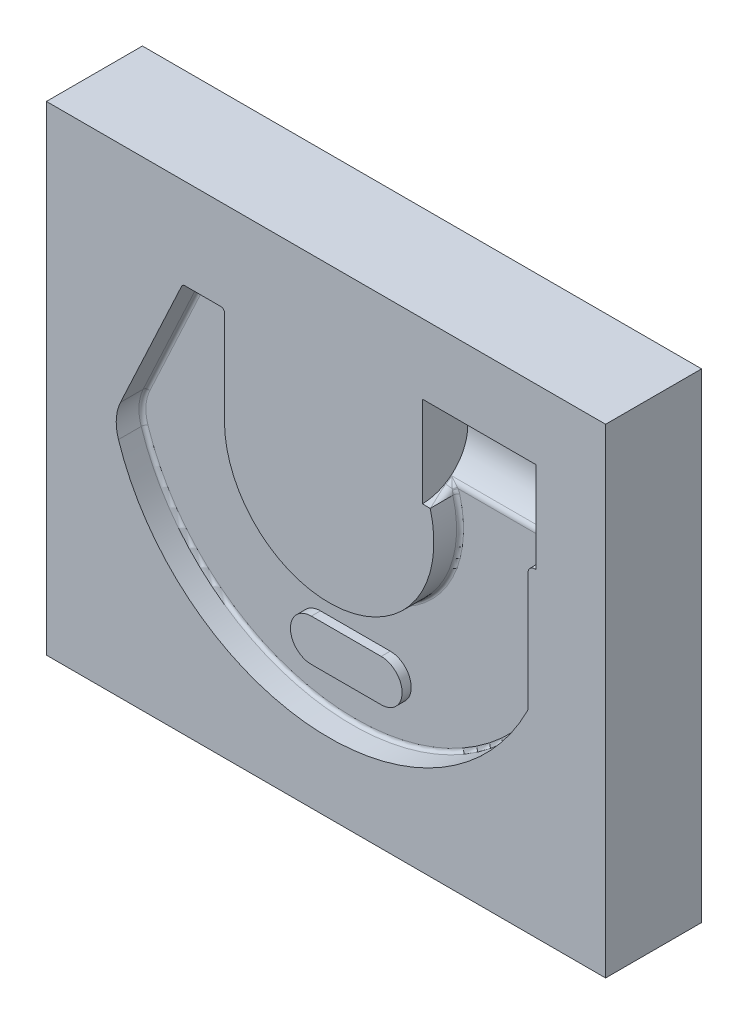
ISO-10303-21;
HEADER;
FILE_DESCRIPTION(('STEP AP214'),'2;1');
FILE_NAME('part.step','',(''),(''),'','','');
FILE_SCHEMA(('AUTOMOTIVE_DESIGN { 1 0 10303 214 1 1 1 1 }'));
ENDSEC;
DATA;
#1=APPLICATION_CONTEXT('core data for automotive mechanical design processes');
#2=APPLICATION_PROTOCOL_DEFINITION('international standard','automotive_design',2000,#1);
#3=PRODUCT_CONTEXT('',#1,'mechanical');
#4=PRODUCT('Part','Part','',(#3));
#5=PRODUCT_RELATED_PRODUCT_CATEGORY('part','',(#4));
#6=PRODUCT_DEFINITION_FORMATION('','',#4);
#7=PRODUCT_DEFINITION_CONTEXT('part definition',#1,'design');
#8=PRODUCT_DEFINITION('design','',#6,#7);
#9=PRODUCT_DEFINITION_SHAPE('','',#8);
#10=(LENGTH_UNIT() NAMED_UNIT(*) SI_UNIT(.MILLI.,.METRE.));
#11=(NAMED_UNIT(*) PLANE_ANGLE_UNIT() SI_UNIT($,.RADIAN.));
#12=(NAMED_UNIT(*) SI_UNIT($,.STERADIAN.) SOLID_ANGLE_UNIT());
#13=UNCERTAINTY_MEASURE_WITH_UNIT(LENGTH_MEASURE(1.E-05),#10,'distance_accuracy_value','');
#14=(GEOMETRIC_REPRESENTATION_CONTEXT(3) GLOBAL_UNCERTAINTY_ASSIGNED_CONTEXT((#13)) GLOBAL_UNIT_ASSIGNED_CONTEXT((#10,
#11,#12)) REPRESENTATION_CONTEXT('',''));
#15=CARTESIAN_POINT('',(0.,0.,0.));
#16=DIRECTION('',(0.,0.,1.));
#17=DIRECTION('',(1.,0.,0.));
#18=AXIS2_PLACEMENT_3D('',#15,#16,#17);
#19=CARTESIAN_POINT('',(29.6,10.45,0.));
#20=DIRECTION('',(-1.,0.,0.));
#21=DIRECTION('',(0.,0.,1.));
#22=AXIS2_PLACEMENT_3D('',#19,#20,#21);
#23=CYLINDRICAL_SURFACE('',#22,6.5);
#24=DIRECTION('',(-1.,0.,0.));
#25=VECTOR('',#24,1.);
#26=CARTESIAN_POINT('',(29.6,16.95,0.));
#27=LINE('',#26,#25);
#28=CARTESIAN_POINT('',(29.6,16.95,0.));
#29=VERTEX_POINT('',#28);
#30=CARTESIAN_POINT('',(13.35,16.95,0.));
#31=VERTEX_POINT('',#30);
#32=EDGE_CURVE('E679',#29,#31,#27,.T.);
#33=ORIENTED_EDGE('',*,*,#32,.T.);
#34=CARTESIAN_POINT('',(13.35,10.45,0.));
#35=DIRECTION('',(1.,0.,0.));
#36=DIRECTION('',(0.,0.,-1.));
#37=AXIS2_PLACEMENT_3D('',#34,#35,#36);
#38=CIRCLE('',#37,6.5);
#39=CARTESIAN_POINT('',(13.35,3.95,0.));
#40=VERTEX_POINT('',#39);
#41=EDGE_CURVE('E555',#40,#31,#38,.T.);
#42=ORIENTED_EDGE('',*,*,#41,.F.);
#43=DIRECTION('',(-1.,0.,0.));
#44=VECTOR('',#43,1.);
#45=CARTESIAN_POINT('',(29.6,3.95,0.));
#46=LINE('',#45,#44);
#47=CARTESIAN_POINT('',(14.4705735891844,3.95,0.));
#48=VERTEX_POINT('',#47);
#49=EDGE_CURVE('E681',#40,#48,#46,.F.);
#50=ORIENTED_EDGE('',*,*,#49,.T.);
#51=CARTESIAN_POINT('',(13.5602743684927,5.17542409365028,-3.79853248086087));
#52=CARTESIAN_POINT('',(14.9310212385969,4.96254800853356,-3.50293646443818));
#53=CARTESIAN_POINT('',(14.4705735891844,3.94999999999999,-4.38292209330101));
#54=CARTESIAN_POINT('',(13.5414842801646,5.13951346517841,-3.74868652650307));
#55=CARTESIAN_POINT('',(14.8769314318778,4.96351930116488,-3.49859005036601));
#56=CARTESIAN_POINT('',(14.4705735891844,3.94999999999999,-4.32540753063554));
#57=CARTESIAN_POINT('',(13.5261587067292,5.10391241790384,-3.69774321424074));
#58=CARTESIAN_POINT('',(14.8242827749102,4.95825032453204,-3.48653448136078));
#59=CARTESIAN_POINT('',(14.4705735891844,3.94999999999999,-4.26662678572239));
#60=CARTESIAN_POINT('',(13.5015275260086,5.03377856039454,-3.594218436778));
#61=CARTESIAN_POINT('',(14.7261308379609,4.93864924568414,-3.45019557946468));
#62=CARTESIAN_POINT('',(14.4705735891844,3.94999999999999,-4.14717511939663));
#63=CARTESIAN_POINT('',(13.4922083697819,4.9992435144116,-3.54164094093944));
#64=CARTESIAN_POINT('',(14.6802339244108,4.92468398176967,-3.42639808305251));
#65=CARTESIAN_POINT('',(14.4705735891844,3.94999999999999,-4.08650877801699));
#66=CARTESIAN_POINT('',(13.478673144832,4.93186706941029,-3.43571279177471));
#67=CARTESIAN_POINT('',(14.5964891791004,4.8912934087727,-3.37003045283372));
#68=CARTESIAN_POINT('',(14.4705735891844,3.94999999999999,-3.96428399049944));
#69=CARTESIAN_POINT('',(13.4744064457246,4.8990120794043,-3.38237532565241));
#70=CARTESIAN_POINT('',(14.5582248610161,4.87209504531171,-3.3378232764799));
#71=CARTESIAN_POINT('',(14.4705735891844,3.94999999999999,-3.90274076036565));
#72=CARTESIAN_POINT('',(13.4701029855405,4.83478623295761,-3.27464652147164));
#73=CARTESIAN_POINT('',(14.4886860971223,4.83040519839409,-3.2667200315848));
#74=CARTESIAN_POINT('',(14.4705735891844,3.94999999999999,-3.77843829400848));
#75=CARTESIAN_POINT('',(13.4700694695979,4.80341653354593,-3.2202544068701));
#76=CARTESIAN_POINT('',(14.4571210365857,4.80797465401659,-3.22796159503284));
#77=CARTESIAN_POINT('',(14.4705735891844,3.94999999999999,-3.71567816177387));
#78=CARTESIAN_POINT('',(13.4750064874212,4.71877857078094,-3.06845609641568));
#79=CARTESIAN_POINT('',(14.3794625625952,4.74418920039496,-3.11482386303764));
#80=CARTESIAN_POINT('',(14.4705735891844,3.94999999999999,-3.54052626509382));
#81=CARTESIAN_POINT('',(13.4838491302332,4.66724290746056,-2.97017104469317));
#82=CARTESIAN_POINT('',(14.33831536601,4.70028986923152,-3.03399012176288));
#83=CARTESIAN_POINT('',(14.4705735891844,3.94999999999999,-3.42712043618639));
#84=CARTESIAN_POINT('',(13.5103266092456,4.56959424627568,-2.77183491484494));
#85=CARTESIAN_POINT('',(14.2727249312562,4.61250634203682,-2.86216341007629));
#86=CARTESIAN_POINT('',(14.4705735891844,3.94999999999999,-3.19827105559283));
#87=CARTESIAN_POINT('',(13.5279654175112,4.52348370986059,-2.67178305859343));
#88=CARTESIAN_POINT('',(14.2474178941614,4.56838649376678,-2.77112894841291));
#89=CARTESIAN_POINT('',(14.4705735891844,3.94999999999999,-3.08282660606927));
#90=CARTESIAN_POINT('',(13.5702929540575,4.43643177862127,-2.4696547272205));
#91=CARTESIAN_POINT('',(14.2097438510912,4.4826440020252,-2.58173274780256));
#92=CARTESIAN_POINT('',(14.4705735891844,3.94999999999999,-2.84960160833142));
#93=CARTESIAN_POINT('',(13.5950339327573,4.39553206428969,-2.36756866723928));
#94=CARTESIAN_POINT('',(14.1969183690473,4.44072298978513,-2.48306697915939));
#95=CARTESIAN_POINT('',(14.4705735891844,3.94999999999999,-2.73181000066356));
#96=CARTESIAN_POINT('',(13.6500208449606,4.31926928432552,-2.1624350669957));
#97=CARTESIAN_POINT('',(14.181578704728,4.36123948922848,-2.28121334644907));
#98=CARTESIAN_POINT('',(14.4705735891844,3.94999999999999,-2.49511738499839));
#99=CARTESIAN_POINT('',(13.6802686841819,4.28390814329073,-2.05938720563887));
#100=CARTESIAN_POINT('',(14.1787364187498,4.32337456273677,-2.17770149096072));
#101=CARTESIAN_POINT('',(14.4705735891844,3.94999999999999,-2.37621600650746));
#102=CARTESIAN_POINT('',(13.762844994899,4.20075961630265,-1.79587576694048));
#103=CARTESIAN_POINT('',(14.1816419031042,4.23412527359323,-1.91176448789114));
#104=CARTESIAN_POINT('',(14.4705735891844,3.94999999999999,-2.07216434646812));
#105=CARTESIAN_POINT('',(13.8181881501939,4.15678638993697,-1.63490386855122));
#106=CARTESIAN_POINT('',(14.1924414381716,4.18499365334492,-1.74433679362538));
#107=CARTESIAN_POINT('',(14.4705735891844,3.94999999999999,-1.88642754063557));
#108=CARTESIAN_POINT('',(13.9357967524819,4.08160508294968,-1.31190280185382));
#109=CARTESIAN_POINT('',(14.2266090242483,4.1008662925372,-1.40612303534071));
#110=CARTESIAN_POINT('',(14.4705735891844,3.94999999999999,-1.51373400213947));
#111=CARTESIAN_POINT('',(13.9980663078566,4.05040463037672,-1.14987306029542));
#112=CARTESIAN_POINT('',(14.249814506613,4.06513898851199,-1.23390699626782));
#113=CARTESIAN_POINT('',(14.4705735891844,3.94999999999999,-1.32677660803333));
#114=CARTESIAN_POINT('',(14.1908762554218,3.97571349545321,-0.66387956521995));
#115=CARTESIAN_POINT('',(14.3298533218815,3.98091005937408,-0.720676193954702));
#116=CARTESIAN_POINT('',(14.4705735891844,3.94999999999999,-0.766014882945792));
#117=CARTESIAN_POINT('',(14.3278808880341,3.9507190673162,-0.338676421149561));
#118=CARTESIAN_POINT('',(14.3992148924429,3.95084407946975,-0.364809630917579));
#119=CARTESIAN_POINT('',(14.4705735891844,3.94999999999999,-0.390780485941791));
#120=CARTESIAN_POINT('',(14.4666130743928,3.95000510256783,-0.0094001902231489));
#121=CARTESIAN_POINT('',(14.4685933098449,3.95000568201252,-0.0101232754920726));
#122=CARTESIAN_POINT('',(14.4705735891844,3.94999999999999,-0.0108463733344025));
#123=CARTESIAN_POINT('',(14.4685933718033,3.95000000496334,-0.00470002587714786));
#124=CARTESIAN_POINT('',(14.4695834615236,3.94999979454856,-0.00506154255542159));
#125=CARTESIAN_POINT('',(14.4705735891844,3.94999999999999,-0.00542310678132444));
#126=CARTESIAN_POINT('',(14.4705735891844,3.95,0.));
#127=CARTESIAN_POINT('',(14.4705735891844,3.94999999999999,0.));
#128=CARTESIAN_POINT('',(14.4705735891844,3.94999999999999,0.));
#129=(BOUNDED_SURFACE() B_SPLINE_SURFACE(3,2,((#51,#52,#53),(#54,#55,#56),(#57,#58,#59),(#60,
#61,#62),(#63,#64,#65),(#66,#67,#68),(#69,#70,#71),(#72,#73,#74),(#75,#76,#77),(#78,#79,#80),
(#81,#82,#83),(#84,#85,#86),(#87,#88,#89),(#90,#91,#92),(#93,#94,#95),(#96,#97,#98),(#99,#100,
#101),(#102,#103,#104),(#105,#106,#107),(#108,#109,#110),(#111,#112,#113),(#114,#115,#116),
(#117,#118,#119),(#120,#121,#122),(#123,#124,#125),(#126,#127,#128)),.UNSPECIFIED.,.F.,.F.,
.F.) B_SPLINE_SURFACE_WITH_KNOTS((4,2,2,2,2,2,2,2,2,2,2,2,4),(3,3),(0.,0.219769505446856,
0.439041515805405,0.656097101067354,0.873319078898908,1.25776413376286,1.64238294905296,
2.02990727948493,2.4175659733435,3.0177300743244,3.61825207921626,4.81430934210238,
4.831629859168),(0.,1.),
.UNSPECIFIED.) GEOMETRIC_REPRESENTATION_ITEM() RATIONAL_B_SPLINE_SURFACE(((1.,0.576233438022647,
1.),(1.,0.589826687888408,1.),(1.,0.603124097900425,1.),(1.,0.629036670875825,1.),(1.,
0.641653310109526,1.),(1.,0.666051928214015,1.),(1.,0.67784105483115,1.),(1.,0.700720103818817,
1.),(1.,0.711809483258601,1.),(1.,0.74155015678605,1.),(1.,0.759450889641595,1.),(1.,
0.793111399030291,1.),(1.,0.808870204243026,1.),(1.,0.838451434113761,1.),(1.,0.852258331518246,
1.),(1.,0.877890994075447,1.),(1.,0.889716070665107,1.),(1.,0.917431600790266,1.),(1.,
0.93199719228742,1.),(1.,0.9568256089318,1.),(1.,0.967085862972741,1.),(1.,0.991613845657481,
1.),(1.,0.999765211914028,1.),(1.,0.999998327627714,1.),(1.,0.999999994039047,1.),(1.,1.,1.))) REPRESENTATION_ITEM('') SURFACE());
#130=CARTESIAN_POINT('',(13.5602743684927,5.17542409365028,-3.79853248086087));
#131=CARTESIAN_POINT('',(13.5414842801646,5.13951346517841,-3.74868652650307));
#132=CARTESIAN_POINT('',(13.5261587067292,5.10391241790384,-3.69774321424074));
#133=CARTESIAN_POINT('',(13.5015275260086,5.03377856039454,-3.594218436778));
#134=CARTESIAN_POINT('',(13.4922083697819,4.9992435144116,-3.54164094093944));
#135=CARTESIAN_POINT('',(13.478673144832,4.93186706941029,-3.43571279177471));
#136=CARTESIAN_POINT('',(13.4744064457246,4.8990120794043,-3.38237532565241));
#137=CARTESIAN_POINT('',(13.4701029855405,4.83478623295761,-3.27464652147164));
#138=CARTESIAN_POINT('',(13.4700694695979,4.80341653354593,-3.2202544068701));
#139=CARTESIAN_POINT('',(13.4750064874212,4.71877857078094,-3.06845609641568));
#140=CARTESIAN_POINT('',(13.4838491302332,4.66724290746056,-2.97017104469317));
#141=CARTESIAN_POINT('',(13.5103266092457,4.56959424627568,-2.77183491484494));
#142=CARTESIAN_POINT('',(13.5279654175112,4.52348370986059,-2.67178305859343));
#143=CARTESIAN_POINT('',(13.5702929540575,4.43643177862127,-2.4696547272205));
#144=CARTESIAN_POINT('',(13.5950339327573,4.39553206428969,-2.36756866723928));
#145=CARTESIAN_POINT('',(13.6500208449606,4.31926928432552,-2.1624350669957));
#146=CARTESIAN_POINT('',(13.6802686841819,4.28390814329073,-2.05938720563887));
#147=CARTESIAN_POINT('',(13.762844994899,4.20075961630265,-1.79587576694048));
#148=CARTESIAN_POINT('',(13.8181881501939,4.15678638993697,-1.63490386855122));
#149=CARTESIAN_POINT('',(13.9357967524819,4.08160508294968,-1.31190280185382));
#150=CARTESIAN_POINT('',(13.9980663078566,4.05040463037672,-1.14987306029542));
#151=CARTESIAN_POINT('',(14.1908762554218,3.97571349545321,-0.663879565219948));
#152=CARTESIAN_POINT('',(14.3278808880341,3.95071906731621,-0.338676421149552));
#153=CARTESIAN_POINT('',(14.4666130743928,3.95000510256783,-0.0094001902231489));
#154=CARTESIAN_POINT('',(14.4685933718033,3.95000000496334,-0.00470002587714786));
#155=CARTESIAN_POINT('',(14.4705735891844,3.95,0.));
#156=B_SPLINE_CURVE_WITH_KNOTS('',3,(#130,#131,#132,#133,#134,#135,#136,#137,#138,#139,#140,
#141,#142,#143,#144,#145,#146,#147,#148,#149,#150,#151,#152,#153,#154,#155),.UNSPECIFIED.,.F.,
.F.,(4,2,2,2,2,2,2,2,2,2,2,2,4),(0.,0.219769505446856,0.439041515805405,0.656097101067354,
0.873319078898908,1.25776413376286,1.64238294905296,2.02990727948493,2.4175659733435,
3.0177300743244,3.61825207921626,4.81430934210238,4.831629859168),.UNSPECIFIED.);
#157=CARTESIAN_POINT('',(13.4705735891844,4.81666666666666,-3.24276973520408));
#158=VERTEX_POINT('',#157);
#159=EDGE_CURVE('E521',#158,#48,#156,.T.);
#160=ORIENTED_EDGE('',*,*,#159,.F.);
#161=CARTESIAN_POINT('',(13.4705735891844,10.45,0.));
#162=DIRECTION('',(-1.,0.,0.));
#163=DIRECTION('',(0.,0.,1.));
#164=AXIS2_PLACEMENT_3D('',#161,#162,#163);
#165=CIRCLE('',#164,6.5);
#166=CARTESIAN_POINT('',(13.4705735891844,5.41978573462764,-4.11666666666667));
#167=VERTEX_POINT('',#166);
#168=EDGE_CURVE('E529',#167,#158,#165,.T.);
#169=ORIENTED_EDGE('',*,*,#168,.F.);
#170=DIRECTION('',(-1.,0.,0.));
#171=VECTOR('',#170,1.);
#172=CARTESIAN_POINT('',(29.6,5.41978573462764,-4.11666666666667));
#173=LINE('',#172,#171);
#174=CARTESIAN_POINT('',(29.479426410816,5.41978573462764,-4.11666666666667));
#175=VERTEX_POINT('',#174);
#176=EDGE_CURVE('E642',#175,#167,#173,.T.);
#177=ORIENTED_EDGE('',*,*,#176,.F.);
#178=CARTESIAN_POINT('',(29.479426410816,10.45,0.));
#179=DIRECTION('',(1.,0.,0.));
#180=DIRECTION('',(0.,1.,0.));
#181=AXIS2_PLACEMENT_3D('',#178,#179,#180);
#182=CIRCLE('',#181,6.5);
#183=CARTESIAN_POINT('',(29.479426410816,3.95,0.));
#184=VERTEX_POINT('',#183);
#185=EDGE_CURVE('E639',#184,#175,#182,.T.);
#186=ORIENTED_EDGE('',*,*,#185,.F.);
#187=CARTESIAN_POINT('',(29.6,3.95,0.));
#188=VERTEX_POINT('',#187);
#189=EDGE_CURVE('E683',#184,#188,#46,.F.);
#190=ORIENTED_EDGE('',*,*,#189,.T.);
#191=CARTESIAN_POINT('',(29.6,10.45,0.));
#192=DIRECTION('',(1.,0.,0.));
#193=DIRECTION('',(0.,0.,-1.));
#194=AXIS2_PLACEMENT_3D('',#191,#192,#193);
#195=CIRCLE('',#194,6.5);
#196=EDGE_CURVE('E648',#188,#29,#195,.T.);
#197=ORIENTED_EDGE('',*,*,#196,.T.);
#198=EDGE_LOOP('',(#33,#42,#50,#160,#169,#177,#186,#190,#197));
#199=FACE_BOUND('',#198,.T.);
#200=ADVANCED_FACE('F43',(#199),#23,.F.);
#201=CARTESIAN_POINT('',(29.6,0.,0.));
#202=DIRECTION('',(1.,0.,0.));
#203=DIRECTION('',(0.,0.,-1.));
#204=AXIS2_PLACEMENT_3D('',#201,#202,#203);
#205=PLANE('',#204);
#206=ORIENTED_EDGE('',*,*,#196,.F.);
#207=DIRECTION('',(0.,-1.,0.));
#208=VECTOR('',#207,1.);
#209=CARTESIAN_POINT('',(29.6,0.,0.));
#210=LINE('',#209,#208);
#211=EDGE_CURVE('E624',#29,#188,#210,.T.);
#212=ORIENTED_EDGE('',*,*,#211,.F.);
#213=EDGE_LOOP('',(#206,#212));
#214=FACE_BOUND('',#213,.T.);
#215=ADVANCED_FACE('F507',(#214),#205,.F.);
#216=CARTESIAN_POINT('',(29.479426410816,10.45,0.));
#217=DIRECTION('',(1.,0.,0.));
#218=DIRECTION('',(0.,1.,0.));
#219=AXIS2_PLACEMENT_3D('',#216,#217,#218);
#220=TOROIDAL_SURFACE('',#219,7.5,1.);
#221=CARTESIAN_POINT('',(29.479426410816,2.95,0.));
#222=DIRECTION('',(0.,0.,1.));
#223=DIRECTION('',(1.,0.,0.));
#224=AXIS2_PLACEMENT_3D('',#221,#222,#223);
#225=CIRCLE('',#224,1.);
#226=CARTESIAN_POINT('',(28.479426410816,2.95,0.));
#227=VERTEX_POINT('',#226);
#228=EDGE_CURVE('E687',#227,#184,#225,.F.);
#229=ORIENTED_EDGE('',*,*,#228,.T.);
#230=ORIENTED_EDGE('',*,*,#185,.T.);
#231=CARTESIAN_POINT('',(28.0655896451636,4.39925183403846,-3.78089659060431));
#232=CARTESIAN_POINT('',(28.5020466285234,4.2536887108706,-3.81794510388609));
#233=CARTESIAN_POINT('',(28.5368685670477,4.1285872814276,-3.37500833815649));
#234=CARTESIAN_POINT('',(28.0882000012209,4.44174775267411,-3.77007584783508));
#235=CARTESIAN_POINT('',(28.5073180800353,4.28032361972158,-3.80440525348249));
#236=CARTESIAN_POINT('',(28.5519421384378,4.17372091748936,-3.36912295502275));
#237=CARTESIAN_POINT('',(28.1147690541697,4.48387646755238,-3.76232924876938));
#238=CARTESIAN_POINT('',(28.5148266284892,4.31101419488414,-3.79107559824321));
#239=CARTESIAN_POINT('',(28.5696548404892,4.21922546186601,-3.367664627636));
#240=CARTESIAN_POINT('',(28.1741247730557,4.56629942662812,-3.75232148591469));
#241=CARTESIAN_POINT('',(28.5356262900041,4.37804506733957,-3.76774290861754));
#242=CARTESIAN_POINT('',(28.6092253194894,4.30971756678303,-3.37246945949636));
#243=CARTESIAN_POINT('',(28.206843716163,4.60660821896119,-3.75000396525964));
#244=CARTESIAN_POINT('',(28.5486478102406,4.41400288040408,-3.7576747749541));
#245=CARTESIAN_POINT('',(28.6310379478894,4.35470557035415,-3.37865226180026));
#246=CARTESIAN_POINT('',(28.307726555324,4.71910050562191,-3.7499926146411));
#247=CARTESIAN_POINT('',(28.5949489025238,4.52166393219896,-3.73630204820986));
#248=CARTESIAN_POINT('',(28.6982931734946,4.48233648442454,-3.40567212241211));
#249=CARTESIAN_POINT('',(28.3821215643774,4.78878937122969,-3.7580108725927));
#250=CARTESIAN_POINT('',(28.6360682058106,4.59918814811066,-3.73024262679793));
#251=CARTESIAN_POINT('',(28.7478898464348,4.56398926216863,-3.43454911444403));
#252=CARTESIAN_POINT('',(28.5419914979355,4.92023784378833,-3.78598984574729));
#253=CARTESIAN_POINT('',(28.737548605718,4.75511115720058,-3.73871795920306));
#254=CARTESIAN_POINT('',(28.8544698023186,4.72293692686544,-3.50853179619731));
#255=CARTESIAN_POINT('',(28.627568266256,4.98191265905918,-3.80606732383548));
#256=CARTESIAN_POINT('',(28.7975567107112,4.83408723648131,-3.75248224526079));
#257=CARTESIAN_POINT('',(28.9115209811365,4.80018101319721,-3.55379441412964));
#258=CARTESIAN_POINT('',(28.8357511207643,5.11697395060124,-3.86387507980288));
#259=CARTESIAN_POINT('',(28.9511348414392,5.00913611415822,-3.80521337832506));
#260=CARTESIAN_POINT('',(29.0503095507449,4.97521865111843,-3.67342084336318));
#261=CARTESIAN_POINT('',(28.9608976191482,5.18699184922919,-3.90531412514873));
#262=CARTESIAN_POINT('',(29.0511869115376,5.10556795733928,-3.85095051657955));
#263=CARTESIAN_POINT('',(29.133740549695,5.0708352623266,-3.75243227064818));
#264=CARTESIAN_POINT('',(29.2153160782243,5.31280384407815,-4.00070389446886));
#265=CARTESIAN_POINT('',(29.2579829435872,5.27594506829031,-3.96561364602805));
#266=CARTESIAN_POINT('',(29.303352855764,5.25163372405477,-3.92359043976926));
#267=CARTESIAN_POINT('',(29.3445712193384,5.36864918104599,-4.05460815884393));
#268=CARTESIAN_POINT('',(29.3670274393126,5.35258780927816,-4.03525724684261));
#269=CARTESIAN_POINT('',(29.389522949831,5.33685256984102,-4.01568792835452));
#270=CARTESIAN_POINT('',(29.4755774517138,5.41833064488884,-4.11489181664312));
#271=CARTESIAN_POINT('',(29.4762189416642,5.41787550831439,-4.11433752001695));
#272=CARTESIAN_POINT('',(29.4768604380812,5.4174224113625,-4.11378155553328));
#273=CARTESIAN_POINT('',(29.4775019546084,5.41905895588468,-4.11577863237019));
#274=CARTESIAN_POINT('',(29.4778226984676,5.41883189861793,-4.1155010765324));
#275=CARTESIAN_POINT('',(29.478143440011,5.41860472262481,-4.11522360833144));
#276=CARTESIAN_POINT('',(29.479426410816,5.41978573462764,-4.11666666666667));
#277=CARTESIAN_POINT('',(29.479426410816,5.41978573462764,-4.11666666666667));
#278=CARTESIAN_POINT('',(29.479426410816,5.41978573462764,-4.11666666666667));
#279=(BOUNDED_SURFACE() B_SPLINE_SURFACE(3,2,((#231,#232,#233),(#234,#235,#236),(#237,#238,
#239),(#240,#241,#242),(#243,#244,#245),(#246,#247,#248),(#249,#250,#251),(#252,#253,#254),
(#255,#256,#257),(#258,#259,#260),(#261,#262,#263),(#264,#265,#266),(#267,#268,#269),(#270,#271,
#272),(#273,#274,#275),(#276,#277,#278)),.UNSPECIFIED.,.F.,.F.,
.F.) B_SPLINE_SURFACE_WITH_KNOTS((4,2,2,2,2,2,2,4),(3,3),(0.,0.207957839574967,
0.413747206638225,0.797033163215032,1.18409148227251,1.70553770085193,2.22507087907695,
2.23281685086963),(0.,1.),
.UNSPECIFIED.) GEOMETRIC_REPRESENTATION_ITEM() RATIONAL_B_SPLINE_SURFACE(((1.,0.734773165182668,
1.),(1.,0.743322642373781,1.),(1.,0.753375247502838,1.),(1.,0.77514192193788,1.),(1.,
0.786837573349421,1.),(1.,0.821098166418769,1.),(1.,0.844337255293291,1.),(1.,0.887918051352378,
1.),(1.,0.90822899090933,1.),(1.,0.949481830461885,1.),(1.,0.968194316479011,1.),(1.,
0.993335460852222,1.),(1.,0.99980893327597,1.),(1.,0.999998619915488,1.),(1.,1.00000000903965,
1.),(1.,1.,1.))) REPRESENTATION_ITEM('') SURFACE());
#280=CARTESIAN_POINT('',(28.5368685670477,4.1285872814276,-3.37500833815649));
#281=CARTESIAN_POINT('',(28.5519421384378,4.17372091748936,-3.36912295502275));
#282=CARTESIAN_POINT('',(28.5696548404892,4.21922546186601,-3.367664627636));
#283=CARTESIAN_POINT('',(28.6092253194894,4.30971756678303,-3.37246945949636));
#284=CARTESIAN_POINT('',(28.6310379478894,4.35470557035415,-3.37865226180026));
#285=CARTESIAN_POINT('',(28.6982931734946,4.48233648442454,-3.40567212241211));
#286=CARTESIAN_POINT('',(28.7478898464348,4.56398926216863,-3.43454911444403));
#287=CARTESIAN_POINT('',(28.8544698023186,4.72293692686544,-3.50853179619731));
#288=CARTESIAN_POINT('',(28.9115209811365,4.80018101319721,-3.55379441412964));
#289=CARTESIAN_POINT('',(29.0503095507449,4.97521865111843,-3.67342084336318));
#290=CARTESIAN_POINT('',(29.133740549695,5.07083526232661,-3.75243227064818));
#291=CARTESIAN_POINT('',(29.303352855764,5.25163372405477,-3.92359043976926));
#292=CARTESIAN_POINT('',(29.3895229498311,5.33685256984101,-4.01568792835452));
#293=CARTESIAN_POINT('',(29.4768604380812,5.4174224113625,-4.11378155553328));
#294=CARTESIAN_POINT('',(29.478143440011,5.41860472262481,-4.11522360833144));
#295=CARTESIAN_POINT('',(29.479426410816,5.41978573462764,-4.11666666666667));
#296=B_SPLINE_CURVE_WITH_KNOTS('',3,(#280,#281,#282,#283,#284,#285,#286,#287,#288,#289,#290,
#291,#292,#293,#294,#295),.UNSPECIFIED.,.F.,.F.,(4,2,2,2,2,2,2,4),(0.,0.207957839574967,
0.413747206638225,0.797033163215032,1.18409148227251,1.70553770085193,2.22507087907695,
2.23281685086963),.UNSPECIFIED.);
#297=CARTESIAN_POINT('',(28.6545330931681,4.39929254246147,-3.38809146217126));
#298=VERTEX_POINT('',#297);
#299=EDGE_CURVE('E705',#298,#175,#296,.T.);
#300=ORIENTED_EDGE('',*,*,#299,.F.);
#301=CARTESIAN_POINT('',(28.8904836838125,4.72140658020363,-3.4588643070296));
#302=CARTESIAN_POINT('',(28.8037187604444,4.82333137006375,-3.75));
#303=CARTESIAN_POINT('',(28.5960123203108,5.06732899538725,-3.75));
#304=CARTESIAN_POINT('',(28.8436349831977,4.67513824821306,-3.44832443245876));
#305=CARTESIAN_POINT('',(28.7525574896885,4.76897119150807,-3.75));
#306=CARTESIAN_POINT('',(28.5257392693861,5.00748525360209,-3.75));
#307=CARTESIAN_POINT('',(28.8003855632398,4.62448559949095,-3.43695916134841));
#308=CARTESIAN_POINT('',(28.7072694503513,4.71009025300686,-3.75));
#309=CARTESIAN_POINT('',(28.4608651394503,4.94162824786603,-3.75));
#310=CARTESIAN_POINT('',(28.721591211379,4.51644927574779,-3.41317340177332));
#311=CARTESIAN_POINT('',(28.6276922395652,4.58561794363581,-3.75));
#312=CARTESIAN_POINT('',(28.3426736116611,4.80035071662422,-3.75));
#313=CARTESIAN_POINT('',(28.6860373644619,4.45907350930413,-3.40075415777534));
#314=CARTESIAN_POINT('',(28.5935028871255,4.51978239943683,-3.75));
#315=CARTESIAN_POINT('',(28.2893428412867,4.72494141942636,-3.75));
#316=CARTESIAN_POINT('',(28.6187436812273,4.33138030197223,-3.37370641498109));
#317=CARTESIAN_POINT('',(28.5325184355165,4.37477997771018,-3.75));
#318=CARTESIAN_POINT('',(28.1884023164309,4.55612167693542,-3.75));
#319=CARTESIAN_POINT('',(28.5881803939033,4.26036406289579,-3.35900718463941));
#320=CARTESIAN_POINT('',(28.5077188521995,4.29499980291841,-3.75));
#321=CARTESIAN_POINT('',(28.142557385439,4.46165789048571,-3.75));
#322=CARTESIAN_POINT('',(28.5380209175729,4.11455601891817,-3.32962065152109));
#323=CARTESIAN_POINT('',(28.4726335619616,4.13398421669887,-3.75));
#324=CARTESIAN_POINT('',(28.0673181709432,4.26648542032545,-3.75));
#325=CARTESIAN_POINT('',(28.5184214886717,4.03976533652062,-3.31493334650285));
#326=CARTESIAN_POINT('',(28.4626946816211,4.05263584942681,-3.75));
#327=CARTESIAN_POINT('',(28.0379190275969,4.16577859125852,-3.75));
#328=CARTESIAN_POINT('',(28.4879065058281,3.87362962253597,-3.2832088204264));
#329=CARTESIAN_POINT('',(28.4562816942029,3.87543727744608,-3.75));
#330=CARTESIAN_POINT('',(27.9921465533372,3.94079006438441,-3.75));
#331=CARTESIAN_POINT('',(28.4794275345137,3.78189883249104,-3.26627142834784));
#332=CARTESIAN_POINT('',(28.4634246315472,3.78043603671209,-3.75));
#333=CARTESIAN_POINT('',(27.9794280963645,3.81573868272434,-3.75));
#334=CARTESIAN_POINT('',(28.4794255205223,3.61852852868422,-3.23710832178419));
#335=CARTESIAN_POINT('',(28.4924790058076,3.61758811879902,-3.75));
#336=CARTESIAN_POINT('',(27.979425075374,3.59171757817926,-3.75));
#337=CARTESIAN_POINT('',(28.4847463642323,3.54667345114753,-3.22463468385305));
#338=CARTESIAN_POINT('',(28.5114259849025,3.54796339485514,-3.75));
#339=CARTESIAN_POINT('',(27.987406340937,3.49272559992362,-3.75));
#340=CARTESIAN_POINT('',(28.5062311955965,3.40507906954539,-3.20067637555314));
#341=CARTESIAN_POINT('',(28.5595962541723,3.41515714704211,-3.75));
#342=CARTESIAN_POINT('',(28.0196335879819,3.29689009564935,-3.75));
#343=CARTESIAN_POINT('',(28.5224539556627,3.3353533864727,-3.18919744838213));
#344=CARTESIAN_POINT('',(28.5891117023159,3.35229355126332,-3.75));
#345=CARTESIAN_POINT('',(28.043967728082,3.20006116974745,-3.75));
#346=CARTESIAN_POINT('',(28.5441998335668,3.26779187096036,-3.17836190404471));
#347=CARTESIAN_POINT('',(28.622402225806,3.29486458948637,-3.75));
#348=CARTESIAN_POINT('',(28.0765865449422,3.10590982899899,-3.75));
#349=(BOUNDED_SURFACE() B_SPLINE_SURFACE(3,2,((#301,#302,#303),(#304,#305,#306),(#307,#308,
#309),(#310,#311,#312),(#313,#314,#315),(#316,#317,#318),(#319,#320,#321),(#322,#323,#324),
(#325,#326,#327),(#328,#329,#330),(#331,#332,#333),(#334,#335,#336),(#337,#338,#339),(#340,#341,
#342),(#343,#344,#345),(#346,#347,#348)),.UNSPECIFIED.,.F.,.F.,
.F.) B_SPLINE_SURFACE_WITH_KNOTS((4,2,2,2,2,2,2,4),(3,3),(0.,0.276240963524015,
0.552160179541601,0.865609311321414,1.17896576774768,1.55338755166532,1.85003791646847,
2.14830049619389),(0.,1.),
.UNSPECIFIED.) GEOMETRIC_REPRESENTATION_ITEM() RATIONAL_B_SPLINE_SURFACE(((1.,0.841940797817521,
1.),(1.,0.83568552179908,1.),(1.,0.828862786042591,1.),(1.,0.814385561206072,1.),(1.,
0.806732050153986,1.),(1.,0.789802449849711,1.),(1.,0.78044725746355,1.),(1.,0.761387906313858,
1.),(1.,0.75168385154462,1.),(1.,0.730303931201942,1.),(1.,0.718612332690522,1.),(1.,
0.697991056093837,1.),(1.,0.688992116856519,1.),(1.,0.671383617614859,1.),(1.,0.662776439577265,
1.),(1.,0.654493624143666,1.))) REPRESENTATION_ITEM('') SURFACE());
#350=CARTESIAN_POINT('',(28.5441998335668,3.26779187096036,-3.17836190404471));
#351=CARTESIAN_POINT('',(28.5224539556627,3.3353533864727,-3.18919744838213));
#352=CARTESIAN_POINT('',(28.5062311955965,3.40507906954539,-3.20067637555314));
#353=CARTESIAN_POINT('',(28.4847463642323,3.54667345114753,-3.22463468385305));
#354=CARTESIAN_POINT('',(28.4794255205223,3.61852852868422,-3.23710832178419));
#355=CARTESIAN_POINT('',(28.4794275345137,3.78189883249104,-3.26627142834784));
#356=CARTESIAN_POINT('',(28.4879065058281,3.87362962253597,-3.2832088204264));
#357=CARTESIAN_POINT('',(28.5184214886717,4.03976533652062,-3.31493334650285));
#358=CARTESIAN_POINT('',(28.5380209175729,4.11455601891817,-3.32962065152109));
#359=CARTESIAN_POINT('',(28.5881803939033,4.26036406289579,-3.35900718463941));
#360=CARTESIAN_POINT('',(28.6187436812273,4.33138030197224,-3.37370641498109));
#361=CARTESIAN_POINT('',(28.6860373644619,4.45907350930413,-3.40075415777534));
#362=CARTESIAN_POINT('',(28.721591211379,4.51644927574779,-3.41317340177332));
#363=CARTESIAN_POINT('',(28.8003855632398,4.62448559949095,-3.43695916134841));
#364=CARTESIAN_POINT('',(28.8436349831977,4.67513824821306,-3.44832443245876));
#365=CARTESIAN_POINT('',(28.8904836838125,4.72140658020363,-3.4588643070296));
#366=B_SPLINE_CURVE_WITH_KNOTS('',3,(#350,#351,#352,#353,#354,#355,#356,#357,#358,#359,#360,
#361,#362,#363,#364,#365),.UNSPECIFIED.,.F.,.F.,(4,2,2,2,2,2,2,4),(0.,0.298262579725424,
0.594912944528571,0.969334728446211,1.28269118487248,1.59614031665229,1.87205953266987,
2.14830049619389),.UNSPECIFIED.);
#367=CARTESIAN_POINT('',(28.479426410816,3.69074708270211,-3.25));
#368=VERTEX_POINT('',#367);
#369=EDGE_CURVE('E637',#368,#298,#366,.T.);
#370=ORIENTED_EDGE('',*,*,#369,.F.);
#371=CARTESIAN_POINT('',(28.479426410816,10.45,0.));
#372=DIRECTION('',(1.,0.,0.));
#373=DIRECTION('',(0.,1.,0.));
#374=AXIS2_PLACEMENT_3D('',#371,#372,#373);
#375=CIRCLE('',#374,7.5);
#376=EDGE_CURVE('E538',#368,#227,#375,.F.);
#377=ORIENTED_EDGE('',*,*,#376,.T.);
#378=EDGE_LOOP('',(#229,#230,#300,#370,#377));
#379=FACE_BOUND('',#378,.T.);
#380=ADVANCED_FACE('F441',(#379),#220,.T.);
#381=CARTESIAN_POINT('',(28.479426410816,0.,3.75));
#382=DIRECTION('',(1.,0.,0.));
#383=DIRECTION('',(0.,1.,0.));
#384=AXIS2_PLACEMENT_3D('',#381,#382,#383);
#385=PLANE('',#384);
#386=ORIENTED_EDGE('',*,*,#376,.F.);
#387=DIRECTION('',(0.,-1.,0.));
#388=VECTOR('',#387,1.);
#389=CARTESIAN_POINT('',(28.479426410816,3.95480947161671,-3.25));
#390=LINE('',#389,#388);
#391=CARTESIAN_POINT('',(28.479426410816,-13.8001313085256,-3.25));
#392=VERTEX_POINT('',#391);
#393=EDGE_CURVE('E702',#392,#368,#390,.F.);
#394=ORIENTED_EDGE('',*,*,#393,.F.);
#395=DIRECTION('',(0.,0.,1.));
#396=VECTOR('',#395,1.);
#397=CARTESIAN_POINT('',(28.479426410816,-13.8001313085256,-3.75));
#398=LINE('',#397,#396);
#399=CARTESIAN_POINT('',(28.479426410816,-13.8001313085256,0.));
#400=VERTEX_POINT('',#399);
#401=EDGE_CURVE('E537',#400,#392,#398,.F.);
#402=ORIENTED_EDGE('',*,*,#401,.F.);
#403=DIRECTION('',(0.,-1.,0.));
#404=VECTOR('',#403,1.);
#405=CARTESIAN_POINT('',(28.479426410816,0.,0.));
#406=LINE('',#405,#404);
#407=EDGE_CURVE('E615',#227,#400,#406,.T.);
#408=ORIENTED_EDGE('',*,*,#407,.F.);
#409=EDGE_LOOP('',(#386,#394,#402,#408));
#410=FACE_BOUND('',#409,.T.);
#411=ADVANCED_FACE('F502',(#410),#385,.F.);
#412=CARTESIAN_POINT('',(27.479426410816,-13.8001313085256,3.75));
#413=DIRECTION('',(0.,0.,-1.));
#414=DIRECTION('',(-1.,0.,0.));
#415=AXIS2_PLACEMENT_3D('',#412,#413,#414);
#416=CYLINDRICAL_SURFACE('',#415,1.);
#417=ORIENTED_EDGE('',*,*,#401,.T.);
#418=CARTESIAN_POINT('',(27.479426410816,-13.8001313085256,-3.25));
#419=DIRECTION('',(0.,0.,1.));
#420=DIRECTION('',(1.,0.,0.));
#421=AXIS2_PLACEMENT_3D('',#418,#419,#420);
#422=CIRCLE('',#421,1.);
#423=CARTESIAN_POINT('',(28.3730662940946,-14.2489160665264,-3.25));
#424=VERTEX_POINT('',#423);
#425=EDGE_CURVE('E699',#424,#392,#422,.T.);
#426=ORIENTED_EDGE('',*,*,#425,.F.);
#427=DIRECTION('',(0.,0.,-1.));
#428=VECTOR('',#427,1.);
#429=CARTESIAN_POINT('',(28.3730662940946,-14.2489160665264,3.75));
#430=LINE('',#429,#428);
#431=CARTESIAN_POINT('',(28.3730662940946,-14.2489160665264,0.));
#432=VERTEX_POINT('',#431);
#433=EDGE_CURVE('E530',#424,#432,#430,.F.);
#434=ORIENTED_EDGE('',*,*,#433,.T.);
#435=CARTESIAN_POINT('',(27.479426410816,-13.8001313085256,0.));
#436=DIRECTION('',(0.,0.,1.));
#437=DIRECTION('',(1.,0.,0.));
#438=AXIS2_PLACEMENT_3D('',#435,#436,#437);
#439=CIRCLE('',#438,1.);
#440=EDGE_CURVE('E620',#400,#432,#439,.F.);
#441=ORIENTED_EDGE('',*,*,#440,.F.);
#442=EDGE_LOOP('',(#417,#426,#434,#441));
#443=FACE_BOUND('',#442,.T.);
#444=ADVANCED_FACE('F498',(#443),#416,.F.);
#445=CARTESIAN_POINT('',(0.,0.,3.75));
#446=DIRECTION('',(0.,0.,-1.));
#447=DIRECTION('',(-1.,0.,0.));
#448=AXIS2_PLACEMENT_3D('',#445,#446,#447);
#449=CYLINDRICAL_SURFACE('',#448,31.75);
#450=CARTESIAN_POINT('',(0.,0.,0.));
#451=DIRECTION('',(0.,0.,1.));
#452=DIRECTION('',(1.,0.,0.));
#453=AXIS2_PLACEMENT_3D('',#450,#451,#452);
#454=CIRCLE('',#453,31.75);
#455=CARTESIAN_POINT('',(-30.1860284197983,-9.84206219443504,0.));
#456=VERTEX_POINT('',#455);
#457=EDGE_CURVE('E667',#456,#432,#454,.T.);
#458=ORIENTED_EDGE('',*,*,#457,.T.);
#459=ORIENTED_EDGE('',*,*,#433,.F.);
#460=CARTESIAN_POINT('',(0.,0.,-3.25));
#461=DIRECTION('',(0.,0.,1.));
#462=DIRECTION('',(1.,0.,0.));
#463=AXIS2_PLACEMENT_3D('',#460,#461,#462);
#464=CIRCLE('',#463,31.75);
#465=CARTESIAN_POINT('',(-30.1860284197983,-9.84206219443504,-3.25));
#466=VERTEX_POINT('',#465);
#467=EDGE_CURVE('E696',#466,#424,#464,.T.);
#468=ORIENTED_EDGE('',*,*,#467,.F.);
#469=DIRECTION('',(0.,0.,-1.));
#470=VECTOR('',#469,1.);
#471=CARTESIAN_POINT('',(-30.1860284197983,-9.84206219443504,3.75));
#472=LINE('',#471,#470);
#473=EDGE_CURVE('E544',#456,#466,#472,.T.);
#474=ORIENTED_EDGE('',*,*,#473,.F.);
#475=EDGE_LOOP('',(#458,#459,#468,#474));
#476=FACE_BOUND('',#475,.T.);
#477=ADVANCED_FACE('F501',(#476),#449,.F.);
#478=CARTESIAN_POINT('',(-24.0062115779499,-7.82715182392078,3.75));
#479=DIRECTION('',(0.,0.,-1.));
#480=DIRECTION('',(-1.,0.,0.));
#481=AXIS2_PLACEMENT_3D('',#478,#479,#480);
#482=CYLINDRICAL_SURFACE('',#481,6.5);
#483=ORIENTED_EDGE('',*,*,#473,.T.);
#484=CARTESIAN_POINT('',(-24.0062115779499,-7.82715182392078,-3.25));
#485=DIRECTION('',(0.,0.,1.));
#486=DIRECTION('',(1.,0.,0.));
#487=AXIS2_PLACEMENT_3D('',#484,#485,#486);
#488=CIRCLE('',#487,6.5);
#489=CARTESIAN_POINT('',(-29.8972121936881,-5.08013312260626,-3.25));
#490=VERTEX_POINT('',#489);
#491=EDGE_CURVE('E634',#490,#466,#488,.T.);
#492=ORIENTED_EDGE('',*,*,#491,.F.);
#493=DIRECTION('',(0.,0.,-1.));
#494=VECTOR('',#493,1.);
#495=CARTESIAN_POINT('',(-29.8972121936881,-5.08013312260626,3.75));
#496=LINE('',#495,#494);
#497=CARTESIAN_POINT('',(-29.8972121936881,-5.08013312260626,0.));
#498=VERTEX_POINT('',#497);
#499=EDGE_CURVE('E541',#490,#498,#496,.F.);
#500=ORIENTED_EDGE('',*,*,#499,.T.);
#501=CARTESIAN_POINT('',(-24.0062115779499,-7.82715182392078,0.));
#502=DIRECTION('',(0.,0.,1.));
#503=DIRECTION('',(1.,0.,0.));
#504=AXIS2_PLACEMENT_3D('',#501,#502,#503);
#505=CIRCLE('',#504,6.5);
#506=EDGE_CURVE('E622',#456,#498,#505,.F.);
#507=ORIENTED_EDGE('',*,*,#506,.F.);
#508=EDGE_LOOP('',(#483,#492,#500,#507));
#509=FACE_BOUND('',#508,.T.);
#510=ADVANCED_FACE('F487',(#509),#482,.F.);
#511=CARTESIAN_POINT('',(-22.6115810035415,10.5439533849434,3.75));
#512=DIRECTION('',(0.906307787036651,-0.422618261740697,0.));
#513=DIRECTION('',(0.422618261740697,0.906307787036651,0.));
#514=AXIS2_PLACEMENT_3D('',#511,#512,#513);
#515=PLANE('',#514);
#516=DIRECTION('',(-0.422618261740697,-0.906307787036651,0.));
#517=VECTOR('',#516,1.);
#518=CARTESIAN_POINT('',(-22.6115810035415,10.5439533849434,0.));
#519=LINE('',#518,#517);
#520=CARTESIAN_POINT('',(-21.1346187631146,13.7113091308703,0.));
#521=VERTEX_POINT('',#520);
#522=EDGE_CURVE('E676',#521,#498,#519,.T.);
#523=ORIENTED_EDGE('',*,*,#522,.T.);
#524=ORIENTED_EDGE('',*,*,#499,.F.);
#525=DIRECTION('',(-0.422618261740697,-0.906307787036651,0.));
#526=VECTOR('',#525,1.);
#527=CARTESIAN_POINT('',(-22.6115810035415,10.5439533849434,-3.25));
#528=LINE('',#527,#526);
#529=CARTESIAN_POINT('',(-22.5568571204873,10.6613091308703,-3.25));
#530=VERTEX_POINT('',#529);
#531=EDGE_CURVE('E690',#530,#490,#528,.T.);
#532=ORIENTED_EDGE('',*,*,#531,.F.);
#533=CARTESIAN_POINT('',(-22.5568571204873,10.6613091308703,-0.200000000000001));
#534=DIRECTION('',(0.906307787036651,-0.422618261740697,0.));
#535=DIRECTION('',(-0.422618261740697,-0.906307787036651,0.));
#536=AXIS2_PLACEMENT_3D('',#533,#534,#535);
#537=ELLIPSE('',#536,3.3653026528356,3.05);
#538=CARTESIAN_POINT('',(-21.1346187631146,13.7113091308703,-0.200000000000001));
#539=VERTEX_POINT('',#538);
#540=EDGE_CURVE('E633',#539,#530,#537,.F.);
#541=ORIENTED_EDGE('',*,*,#540,.F.);
#542=DIRECTION('',(0.,0.,-1.));
#543=VECTOR('',#542,1.);
#544=CARTESIAN_POINT('',(-21.1346187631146,13.7113091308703,3.75));
#545=LINE('',#544,#543);
#546=EDGE_CURVE('E631',#521,#539,#545,.T.);
#547=ORIENTED_EDGE('',*,*,#546,.F.);
#548=EDGE_LOOP('',(#523,#524,#532,#541,#547));
#549=FACE_BOUND('',#548,.T.);
#550=ADVANCED_FACE('F482',(#549),#515,.T.);
#551=CARTESIAN_POINT('',(-20.6814648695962,13.5,3.75));
#552=DIRECTION('',(0.,0.,-1.));
#553=DIRECTION('',(-1.,0.,0.));
#554=AXIS2_PLACEMENT_3D('',#551,#552,#553);
#555=CYLINDRICAL_SURFACE('',#554,0.5);
#556=ORIENTED_EDGE('',*,*,#546,.T.);
#557=CARTESIAN_POINT('',(-20.6814648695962,13.5,-0.200000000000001));
#558=DIRECTION('',(0.,0.,-1.));
#559=DIRECTION('',(-1.,0.,0.));
#560=AXIS2_PLACEMENT_3D('',#557,#558,#559);
#561=CIRCLE('',#560,0.5);
#562=CARTESIAN_POINT('',(-20.6814648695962,14.,-0.200000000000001));
#563=VERTEX_POINT('',#562);
#564=EDGE_CURVE('E304',#539,#563,#561,.T.);
#565=ORIENTED_EDGE('',*,*,#564,.T.);
#566=DIRECTION('',(0.,0.,-1.));
#567=VECTOR('',#566,1.);
#568=CARTESIAN_POINT('',(-20.6814648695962,14.,3.75));
#569=LINE('',#568,#567);
#570=CARTESIAN_POINT('',(-20.6814648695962,14.,0.));
#571=VERTEX_POINT('',#570);
#572=EDGE_CURVE('E638',#563,#571,#569,.F.);
#573=ORIENTED_EDGE('',*,*,#572,.T.);
#574=CARTESIAN_POINT('',(-20.6814648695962,13.5,0.));
#575=DIRECTION('',(0.,0.,1.));
#576=DIRECTION('',(1.,0.,0.));
#577=AXIS2_PLACEMENT_3D('',#574,#575,#576);
#578=CIRCLE('',#577,0.5);
#579=EDGE_CURVE('E11',#521,#571,#578,.F.);
#580=ORIENTED_EDGE('',*,*,#579,.F.);
#581=EDGE_LOOP('',(#556,#565,#573,#580));
#582=FACE_BOUND('',#581,.T.);
#583=ADVANCED_FACE('F486',(#582),#555,.F.);
#584=CARTESIAN_POINT('',(0.,14.,3.75));
#585=DIRECTION('',(0.,-1.,0.));
#586=DIRECTION('',(1.,0.,0.));
#587=AXIS2_PLACEMENT_3D('',#584,#585,#586);
#588=PLANE('',#587);
#589=DIRECTION('',(-1.,0.,0.));
#590=VECTOR('',#589,1.);
#591=CARTESIAN_POINT('',(0.,14.,0.));
#592=LINE('',#591,#590);
#593=CARTESIAN_POINT('',(-15.5,14.,0.));
#594=VERTEX_POINT('',#593);
#595=EDGE_CURVE('E673',#594,#571,#592,.T.);
#596=ORIENTED_EDGE('',*,*,#595,.T.);
#597=ORIENTED_EDGE('',*,*,#572,.F.);
#598=DIRECTION('',(-1.,0.,0.));
#599=VECTOR('',#598,1.);
#600=CARTESIAN_POINT('',(0.,14.,-0.200000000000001));
#601=LINE('',#600,#599);
#602=CARTESIAN_POINT('',(-15.5,14.,-0.200000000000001));
#603=VERTEX_POINT('',#602);
#604=EDGE_CURVE('E548',#603,#563,#601,.T.);
#605=ORIENTED_EDGE('',*,*,#604,.F.);
#606=DIRECTION('',(0.,0.,-1.));
#607=VECTOR('',#606,1.);
#608=CARTESIAN_POINT('',(-15.5,14.,3.75));
#609=LINE('',#608,#607);
#610=EDGE_CURVE('E635',#594,#603,#609,.T.);
#611=ORIENTED_EDGE('',*,*,#610,.F.);
#612=EDGE_LOOP('',(#596,#597,#605,#611));
#613=FACE_BOUND('',#612,.T.);
#614=ADVANCED_FACE('F491',(#613),#588,.T.);
#615=CARTESIAN_POINT('',(-15.5,13.5,3.75));
#616=DIRECTION('',(0.,0.,-1.));
#617=DIRECTION('',(-1.,0.,0.));
#618=AXIS2_PLACEMENT_3D('',#615,#616,#617);
#619=CYLINDRICAL_SURFACE('',#618,0.5);
#620=ORIENTED_EDGE('',*,*,#610,.T.);
#621=CARTESIAN_POINT('',(-15.5,13.5,-0.200000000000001));
#622=DIRECTION('',(0.,0.,-1.));
#623=DIRECTION('',(-1.,0.,0.));
#624=AXIS2_PLACEMENT_3D('',#621,#622,#623);
#625=CIRCLE('',#624,0.5);
#626=CARTESIAN_POINT('',(-15.,13.5,-0.200000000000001));
#627=VERTEX_POINT('',#626);
#628=EDGE_CURVE('E278',#603,#627,#625,.T.);
#629=ORIENTED_EDGE('',*,*,#628,.T.);
#630=DIRECTION('',(0.,0.,-1.));
#631=VECTOR('',#630,1.);
#632=CARTESIAN_POINT('',(-15.,13.5,3.75));
#633=LINE('',#632,#631);
#634=CARTESIAN_POINT('',(-15.,13.5,0.));
#635=VERTEX_POINT('',#634);
#636=EDGE_CURVE('E872',#627,#635,#633,.F.);
#637=ORIENTED_EDGE('',*,*,#636,.T.);
#638=CARTESIAN_POINT('',(-15.5,13.5,0.));
#639=DIRECTION('',(0.,0.,1.));
#640=DIRECTION('',(1.,0.,0.));
#641=AXIS2_PLACEMENT_3D('',#638,#639,#640);
#642=CIRCLE('',#641,0.5);
#643=EDGE_CURVE('E53',#594,#635,#642,.F.);
#644=ORIENTED_EDGE('',*,*,#643,.F.);
#645=EDGE_LOOP('',(#620,#629,#637,#644));
#646=FACE_BOUND('',#645,.T.);
#647=ADVANCED_FACE('F493',(#646),#619,.F.);
#648=CARTESIAN_POINT('',(-15.,0.,3.75));
#649=DIRECTION('',(-1.,0.,0.));
#650=DIRECTION('',(0.,0.,1.));
#651=AXIS2_PLACEMENT_3D('',#648,#649,#650);
#652=PLANE('',#651);
#653=DIRECTION('',(0.,1.,0.));
#654=VECTOR('',#653,1.);
#655=CARTESIAN_POINT('',(-15.,0.,0.));
#656=LINE('',#655,#654);
#657=CARTESIAN_POINT('',(-15.,0.,0.));
#658=VERTEX_POINT('',#657);
#659=EDGE_CURVE('E670',#658,#635,#656,.T.);
#660=ORIENTED_EDGE('',*,*,#659,.T.);
#661=ORIENTED_EDGE('',*,*,#636,.F.);
#662=CARTESIAN_POINT('',(-15.,10.45,-0.200000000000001));
#663=DIRECTION('',(-1.,0.,0.));
#664=DIRECTION('',(0.,0.,1.));
#665=AXIS2_PLACEMENT_3D('',#662,#663,#664);
#666=CIRCLE('',#665,3.05);
#667=CARTESIAN_POINT('',(-15.,10.45,-3.25));
#668=VERTEX_POINT('',#667);
#669=EDGE_CURVE('E874',#668,#627,#666,.F.);
#670=ORIENTED_EDGE('',*,*,#669,.F.);
#671=DIRECTION('',(0.,1.,0.));
#672=VECTOR('',#671,1.);
#673=CARTESIAN_POINT('',(-15.,0.,-3.25));
#674=LINE('',#673,#672);
#675=CARTESIAN_POINT('',(-15.,0.,-3.25));
#676=VERTEX_POINT('',#675);
#677=EDGE_CURVE('E814',#676,#668,#674,.T.);
#678=ORIENTED_EDGE('',*,*,#677,.F.);
#679=DIRECTION('',(0.,0.,-1.));
#680=VECTOR('',#679,1.);
#681=CARTESIAN_POINT('',(-15.,0.,3.75));
#682=LINE('',#681,#680);
#683=EDGE_CURVE('E646',#658,#676,#682,.T.);
#684=ORIENTED_EDGE('',*,*,#683,.F.);
#685=EDGE_LOOP('',(#660,#661,#670,#678,#684));
#686=FACE_BOUND('',#685,.T.);
#687=ADVANCED_FACE('F496',(#686),#652,.T.);
#688=CARTESIAN_POINT('',(0.,0.,3.75));
#689=DIRECTION('',(0.,0.,-1.));
#690=DIRECTION('',(-1.,0.,0.));
#691=AXIS2_PLACEMENT_3D('',#688,#689,#690);
#692=CYLINDRICAL_SURFACE('',#691,15.);
#693=ORIENTED_EDGE('',*,*,#683,.T.);
#694=CARTESIAN_POINT('',(0.,0.,-3.25));
#695=DIRECTION('',(0.,0.,1.));
#696=DIRECTION('',(1.,0.,0.));
#697=AXIS2_PLACEMENT_3D('',#694,#695,#696);
#698=CIRCLE('',#697,15.);
#699=CARTESIAN_POINT('',(14.4705735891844,3.95,-3.25));
#700=VERTEX_POINT('',#699);
#701=EDGE_CURVE('E735',#700,#676,#698,.F.);
#702=ORIENTED_EDGE('',*,*,#701,.F.);
#703=DIRECTION('',(0.,0.,-1.));
#704=VECTOR('',#703,1.);
#705=CARTESIAN_POINT('',(14.4705735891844,3.95,3.75));
#706=LINE('',#705,#704);
#707=EDGE_CURVE('E551',#48,#700,#706,.T.);
#708=ORIENTED_EDGE('',*,*,#707,.F.);
#709=CARTESIAN_POINT('',(0.,0.,0.));
#710=DIRECTION('',(0.,0.,1.));
#711=DIRECTION('',(1.,0.,0.));
#712=AXIS2_PLACEMENT_3D('',#709,#710,#711);
#713=CIRCLE('',#712,15.);
#714=EDGE_CURVE('E627',#658,#48,#713,.T.);
#715=ORIENTED_EDGE('',*,*,#714,.F.);
#716=EDGE_LOOP('',(#693,#702,#708,#715));
#717=FACE_BOUND('',#716,.T.);
#718=ADVANCED_FACE('F512',(#717),#692,.T.);
#719=CARTESIAN_POINT('',(13.35,0.,0.));
#720=DIRECTION('',(1.,0.,0.));
#721=DIRECTION('',(0.,0.,-1.));
#722=AXIS2_PLACEMENT_3D('',#719,#720,#721);
#723=PLANE('',#722);
#724=DIRECTION('',(0.,-1.,0.));
#725=VECTOR('',#724,1.);
#726=CARTESIAN_POINT('',(13.35,0.,0.));
#727=LINE('',#726,#725);
#728=EDGE_CURVE('E684',#31,#40,#727,.T.);
#729=ORIENTED_EDGE('',*,*,#728,.T.);
#730=ORIENTED_EDGE('',*,*,#41,.T.);
#731=EDGE_LOOP('',(#729,#730));
#732=FACE_BOUND('',#731,.T.);
#733=ADVANCED_FACE('F373',(#732),#723,.T.);
#734=CARTESIAN_POINT('',(29.6,4.64590661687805,-4.75));
#735=DIRECTION('',(-1.,0.,0.));
#736=DIRECTION('',(0.,0.,1.));
#737=AXIS2_PLACEMENT_3D('',#734,#735,#736);
#738=CYLINDRICAL_SURFACE('',#737,1.);
#739=DIRECTION('',(1.,0.,0.));
#740=VECTOR('',#739,1.);
#741=CARTESIAN_POINT('',(28.479426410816,4.64590661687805,-3.75));
#742=LINE('',#741,#740);
#743=CARTESIAN_POINT('',(14.7093551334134,4.64590661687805,-3.75));
#744=VERTEX_POINT('',#743);
#745=CARTESIAN_POINT('',(28.2420864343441,4.64590661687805,-3.75));
#746=VERTEX_POINT('',#745);
#747=EDGE_CURVE('E534',#744,#746,#742,.T.);
#748=ORIENTED_EDGE('',*,*,#747,.T.);
#749=CARTESIAN_POINT('',(28.0655896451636,4.39925183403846,-3.78089659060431));
#750=CARTESIAN_POINT('',(28.0882000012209,4.44174775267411,-3.77007584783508));
#751=CARTESIAN_POINT('',(28.1147690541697,4.48387646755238,-3.76232924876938));
#752=CARTESIAN_POINT('',(28.1741247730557,4.56629942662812,-3.75232148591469));
#753=CARTESIAN_POINT('',(28.206843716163,4.60660821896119,-3.75000396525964));
#754=CARTESIAN_POINT('',(28.307726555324,4.71910050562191,-3.7499926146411));
#755=CARTESIAN_POINT('',(28.3821215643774,4.78878937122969,-3.7580108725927));
#756=CARTESIAN_POINT('',(28.5419914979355,4.92023784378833,-3.78598984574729));
#757=CARTESIAN_POINT('',(28.627568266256,4.98191265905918,-3.80606732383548));
#758=CARTESIAN_POINT('',(28.8357511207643,5.11697395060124,-3.86387507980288));
#759=CARTESIAN_POINT('',(28.9608976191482,5.18699184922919,-3.90531412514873));
#760=CARTESIAN_POINT('',(29.2153160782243,5.31280384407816,-4.00070389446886));
#761=CARTESIAN_POINT('',(29.3445712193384,5.368649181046,-4.05460815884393));
#762=CARTESIAN_POINT('',(29.4755774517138,5.41833064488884,-4.11489181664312));
#763=CARTESIAN_POINT('',(29.4775019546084,5.41905895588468,-4.11577863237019));
#764=CARTESIAN_POINT('',(29.479426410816,5.41978573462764,-4.11666666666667));
#765=B_SPLINE_CURVE_WITH_KNOTS('',3,(#749,#750,#751,#752,#753,#754,#755,#756,#757,#758,#759,
#760,#761,#762,#763,#764),.UNSPECIFIED.,.F.,.F.,(4,2,2,2,2,2,2,4),(0.,0.207957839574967,
0.413747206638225,0.797033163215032,1.18409148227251,1.70553770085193,2.22507087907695,
2.23281685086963),.UNSPECIFIED.);
#766=EDGE_CURVE('E404',#175,#746,#765,.F.);
#767=ORIENTED_EDGE('',*,*,#766,.F.);
#768=ORIENTED_EDGE('',*,*,#176,.T.);
#769=CARTESIAN_POINT('',(14.3809292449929,4.21592929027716,-3.36900782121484));
#770=CARTESIAN_POINT('',(14.4346668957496,4.31031075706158,-3.79229863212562));
#771=CARTESIAN_POINT('',(14.8361070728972,4.48060995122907,-3.7637561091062));
#772=CARTESIAN_POINT('',(14.3608477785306,4.2658967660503,-3.36853459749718));
#773=CARTESIAN_POINT('',(14.4258183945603,4.34393300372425,-3.77846234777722));
#774=CARTESIAN_POINT('',(14.8059848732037,4.52666769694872,-3.75605007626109));
#775=CARTESIAN_POINT('',(14.3380135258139,4.31582045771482,-3.37296399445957));
#776=CARTESIAN_POINT('',(14.4132465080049,4.38232361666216,-3.76604133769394));
#777=CARTESIAN_POINT('',(14.7717334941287,4.57184262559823,-3.75177525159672));
#778=CARTESIAN_POINT('',(14.2881769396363,4.41445074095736,-3.39006617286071));
#779=CARTESIAN_POINT('',(14.3805299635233,4.46419396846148,-3.74678848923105));
#780=CARTESIAN_POINT('',(14.6969786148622,4.65950379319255,-3.74913898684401));
#781=CARTESIAN_POINT('',(14.2612145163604,4.4631642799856,-3.40266340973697));
#782=CARTESIAN_POINT('',(14.3607438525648,4.50733518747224,-3.73976272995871));
#783=CARTESIAN_POINT('',(14.6565349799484,4.70201079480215,-3.75072397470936));
#784=CARTESIAN_POINT('',(14.1843435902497,4.59228553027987,-3.4455913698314));
#785=CARTESIAN_POINT('',(14.2979571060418,4.62566095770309,-3.73021281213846));
#786=CARTESIAN_POINT('',(14.5412285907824,4.81263414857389,-3.76152136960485));
#787=CARTESIAN_POINT('',(14.1314329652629,4.67138499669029,-3.4821605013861));
#788=CARTESIAN_POINT('',(14.2480195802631,4.70442890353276,-3.73314526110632));
#789=CARTESIAN_POINT('',(14.4618626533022,4.87819759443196,-3.77523974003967));
#790=CARTESIAN_POINT('',(14.0198165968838,4.82488378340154,-3.56903581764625));
#791=CARTESIAN_POINT('',(14.1325384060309,4.85836763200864,-3.75827257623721));
#792=CARTESIAN_POINT('',(14.2944381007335,5.00137873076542,-3.81307649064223));
#793=CARTESIAN_POINT('',(13.9610712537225,4.89924444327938,-3.6194406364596));
#794=CARTESIAN_POINT('',(14.0669874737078,4.93443457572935,-3.77989260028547));
#795=CARTESIAN_POINT('',(14.2063200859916,5.05893471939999,-3.83727029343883));
#796=CARTESIAN_POINT('',(13.8321706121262,5.05240713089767,-3.73753403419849));
#797=CARTESIAN_POINT('',(13.9179397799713,5.08654069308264,-3.8427114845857));
#798=CARTESIAN_POINT('',(14.0129691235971,5.17338675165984,-3.89764818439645));
#799=CARTESIAN_POINT('',(13.7615523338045,5.13043016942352,-3.80664263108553));
#800=CARTESIAN_POINT('',(13.8320442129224,5.16311986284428,-3.88617126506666));
#801=CARTESIAN_POINT('',(13.9070417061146,5.22912059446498,-3.93501806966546));
#802=CARTESIAN_POINT('',(13.6187366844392,5.27906716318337,-3.95355809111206));
#803=CARTESIAN_POINT('',(13.6565600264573,5.30060147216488,-3.9884768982));
#804=CARTESIAN_POINT('',(13.6928182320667,5.33069833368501,-4.01832047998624));
#805=CARTESIAN_POINT('',(13.5465452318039,5.34970451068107,-4.03133577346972));
#806=CARTESIAN_POINT('',(13.5655517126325,5.36300467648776,-4.04787356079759));
#807=CARTESIAN_POINT('',(13.5845310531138,5.37657397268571,-4.0642246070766));
#808=CARTESIAN_POINT('',(13.4731395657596,5.41742241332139,-4.11378154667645));
#809=CARTESIAN_POINT('',(13.4737810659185,5.41787549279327,-4.11433752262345));
#810=CARTESIAN_POINT('',(13.4744225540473,5.41833064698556,-4.11489181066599));
#811=CARTESIAN_POINT('',(13.4718565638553,5.41860472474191,-4.1152235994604));
#812=CARTESIAN_POINT('',(13.4721773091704,5.4188318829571,-4.11550107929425));
#813=CARTESIAN_POINT('',(13.4724980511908,5.41905895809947,-4.11577862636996));
#814=CARTESIAN_POINT('',(13.4705735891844,5.41978573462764,-4.11666666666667));
#815=CARTESIAN_POINT('',(13.4705735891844,5.41978573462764,-4.11666666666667));
#816=CARTESIAN_POINT('',(13.4705735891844,5.41978573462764,-4.11666666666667));
#817=(BOUNDED_SURFACE() B_SPLINE_SURFACE(3,2,((#769,#770,#771),(#772,#773,#774),(#775,#776,
#777),(#778,#779,#780),(#781,#782,#783),(#784,#785,#786),(#787,#788,#789),(#790,#791,#792),
(#793,#794,#795),(#796,#797,#798),(#799,#800,#801),(#802,#803,#804),(#805,#806,#807),(#808,#809,
#810),(#811,#812,#813),(#814,#815,#816)),.UNSPECIFIED.,.F.,.F.,
.F.) B_SPLINE_SURFACE_WITH_KNOTS((4,2,2,2,2,2,2,4),(3,3),(0.,0.227932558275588,
0.453786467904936,0.835382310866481,1.21977254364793,1.65662548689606,2.09204999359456,
2.09979596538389),(0.,1.),
.UNSPECIFIED.) GEOMETRIC_REPRESENTATION_ITEM() RATIONAL_B_SPLINE_SURFACE(((1.,0.752948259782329,
1.),(1.,0.764232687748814,1.),(1.,0.776734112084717,1.),(1.,0.802698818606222,1.),(1.,
0.816152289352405,1.),(1.,0.85199295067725,1.),(1.,0.874143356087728,1.),(1.,0.914289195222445,
1.),(1.,0.932253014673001,1.),(1.,0.964298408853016,1.),(1.,0.977515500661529,1.),(1.,
0.995271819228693,1.),(1.,0.999839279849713,1.),(1.,0.999998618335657,1.),(1.,1.00000000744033,
1.),(1.,1.,1.))) REPRESENTATION_ITEM('') SURFACE());
#818=CARTESIAN_POINT('',(14.8361070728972,4.48060995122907,-3.7637561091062));
#819=CARTESIAN_POINT('',(14.8059848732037,4.52666769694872,-3.75605007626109));
#820=CARTESIAN_POINT('',(14.7717334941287,4.57184262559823,-3.75177525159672));
#821=CARTESIAN_POINT('',(14.6969786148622,4.65950379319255,-3.74913898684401));
#822=CARTESIAN_POINT('',(14.6565349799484,4.70201079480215,-3.75072397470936));
#823=CARTESIAN_POINT('',(14.5412285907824,4.81263414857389,-3.76152136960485));
#824=CARTESIAN_POINT('',(14.4618626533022,4.87819759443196,-3.77523974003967));
#825=CARTESIAN_POINT('',(14.2944381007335,5.00137873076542,-3.81307649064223));
#826=CARTESIAN_POINT('',(14.2063200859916,5.05893471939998,-3.83727029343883));
#827=CARTESIAN_POINT('',(14.0129691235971,5.17338675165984,-3.89764818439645));
#828=CARTESIAN_POINT('',(13.9070417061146,5.22912059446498,-3.93501806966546));
#829=CARTESIAN_POINT('',(13.6928182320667,5.33069833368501,-4.01832047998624));
#830=CARTESIAN_POINT('',(13.5845310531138,5.37657397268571,-4.06422460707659));
#831=CARTESIAN_POINT('',(13.4744225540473,5.41833064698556,-4.11489181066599));
#832=CARTESIAN_POINT('',(13.4724980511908,5.41905895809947,-4.11577862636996));
#833=CARTESIAN_POINT('',(13.4705735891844,5.41978573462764,-4.11666666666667));
#834=B_SPLINE_CURVE_WITH_KNOTS('',3,(#818,#819,#820,#821,#822,#823,#824,#825,#826,#827,#828,
#829,#830,#831,#832,#833),.UNSPECIFIED.,.F.,.F.,(4,2,2,2,2,2,2,4),(0.,0.227932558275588,
0.453786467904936,0.835382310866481,1.21977254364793,1.65662548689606,2.09204999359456,
2.09979596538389),.UNSPECIFIED.);
#835=CARTESIAN_POINT('',(14.613663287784,4.74314130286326,-3.75473851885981));
#836=VERTEX_POINT('',#835);
#837=EDGE_CURVE('E411',#836,#167,#834,.T.);
#838=ORIENTED_EDGE('',*,*,#837,.F.);
#839=CARTESIAN_POINT('',(14.4233136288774,4.1141400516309,-3.33914801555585));
#840=CARTESIAN_POINT('',(14.4254183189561,4.23576007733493,-3.82181306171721));
#841=CARTESIAN_POINT('',(14.8923339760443,4.40308296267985,-3.77992955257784));
#842=CARTESIAN_POINT('',(14.4066328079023,4.16010464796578,-3.33610422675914));
#843=CARTESIAN_POINT('',(14.4237400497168,4.26130735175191,-3.80766868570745));
#844=CARTESIAN_POINT('',(14.8682949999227,4.44519891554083,-3.76940345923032));
#845=CARTESIAN_POINT('',(14.3871189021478,4.2066800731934,-3.33813391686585));
#846=CARTESIAN_POINT('',(14.4194503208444,4.29270687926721,-3.79341700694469));
#847=CARTESIAN_POINT('',(14.8402256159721,4.48682105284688,-3.76187885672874));
#848=CARTESIAN_POINT('',(14.3444578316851,4.29956033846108,-3.35079167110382));
#849=CARTESIAN_POINT('',(14.404350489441,4.36303841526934,-3.76862947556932));
#850=CARTESIAN_POINT('',(14.778504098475,4.56787687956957,-3.75222670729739));
#851=CARTESIAN_POINT('',(14.3213855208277,4.34585392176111,-3.36125806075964));
#852=CARTESIAN_POINT('',(14.3939392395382,4.40132784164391,-3.75798112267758));
#853=CARTESIAN_POINT('',(14.7449663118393,4.60733695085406,-3.75000076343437));
#854=CARTESIAN_POINT('',(14.2747066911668,4.43498407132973,-3.38818954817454));
#855=CARTESIAN_POINT('',(14.3670247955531,4.48013397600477,-3.74288121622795));
#856=CARTESIAN_POINT('',(14.676405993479,4.68159308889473,-3.74999929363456));
#857=CARTESIAN_POINT('',(14.2512690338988,4.47782037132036,-3.40414773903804));
#858=CARTESIAN_POINT('',(14.3512960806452,4.51997865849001,-3.73788136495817));
#859=CARTESIAN_POINT('',(14.6416818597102,4.71651730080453,-3.75190352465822));
#860=CARTESIAN_POINT('',(14.2034307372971,4.56347229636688,-3.44121396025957));
#861=CARTESIAN_POINT('',(14.3148607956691,4.60175886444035,-3.73333512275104));
#862=CARTESIAN_POINT('',(14.5697781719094,4.7849222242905,-3.75911261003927));
#863=CARTESIAN_POINT('',(14.179028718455,4.60628779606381,-3.46232960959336));
#864=CARTESIAN_POINT('',(14.2942827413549,4.64368520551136,-3.73361797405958));
#865=CARTESIAN_POINT('',(14.5325950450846,4.81840071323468,-3.76442251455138));
#866=CARTESIAN_POINT('',(14.1294032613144,4.69327212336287,-3.50964668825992));
#867=CARTESIAN_POINT('',(14.2486583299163,4.72937361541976,-3.73987319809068));
#868=CARTESIAN_POINT('',(14.4554282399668,4.88514697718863,-3.77841716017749));
#869=CARTESIAN_POINT('',(14.104182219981,4.73743354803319,-3.53600513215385));
#870=CARTESIAN_POINT('',(14.2234974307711,4.77331404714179,-3.74588974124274));
#871=CARTESIAN_POINT('',(14.4153918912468,4.9183628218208,-3.7872176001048));
#872=CARTESIAN_POINT('',(14.0548238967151,4.82513009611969,-3.5922900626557));
#873=CARTESIAN_POINT('',(14.1709778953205,4.86005318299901,-3.76358392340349));
#874=CARTESIAN_POINT('',(14.3348608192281,4.9833160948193,-3.80803465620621));
#875=CARTESIAN_POINT('',(14.0306832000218,4.86866684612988,-3.62220402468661));
#876=CARTESIAN_POINT('',(14.1435794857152,4.90305307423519,-3.77513522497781));
#877=CARTESIAN_POINT('',(14.2943681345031,5.01505819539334,-3.82004015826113));
#878=CARTESIAN_POINT('',(14.0074986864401,4.9118380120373,-3.65349714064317));
#879=CARTESIAN_POINT('',(14.1153352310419,4.94554445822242,-3.78964616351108));
#880=CARTESIAN_POINT('',(14.2540402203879,5.04619044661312,-3.83360878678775));
#881=(BOUNDED_SURFACE() B_SPLINE_SURFACE(3,2,((#839,#840,#841),(#842,#843,#844),(#845,#846,
#847),(#848,#849,#850),(#851,#852,#853),(#854,#855,#856),(#857,#858,#859),(#860,#861,#862),
(#863,#864,#865),(#866,#867,#868),(#869,#870,#871),(#872,#873,#874),(#875,#876,#877),(#878,#879,
#880)),.UNSPECIFIED.,.F.,.F.,.F.) B_SPLINE_SURFACE_WITH_KNOTS((4,2,2,2,2,2,4),(3,3),(0.,
0.207541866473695,0.411198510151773,0.599631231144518,0.788344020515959,0.983919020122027,
1.17882444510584),(0.,1.),
.UNSPECIFIED.) GEOMETRIC_REPRESENTATION_ITEM() RATIONAL_B_SPLINE_SURFACE(((1.,0.708695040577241,
1.),(1.,0.719837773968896,1.),(1.,0.732893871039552,1.),(1.,0.760837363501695,1.),(1.,
0.77568590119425,1.),(1.,0.804640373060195,1.),(1.,0.818718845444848,1.),(1.,0.846358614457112,
1.),(1.,0.859919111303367,1.),(1.,0.886238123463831,1.),(1.,0.898949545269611,1.),(1.,
0.922417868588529,1.),(1.,0.933181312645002,1.),(1.,0.942722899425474,1.))) REPRESENTATION_ITEM('') SURFACE());
#882=CARTESIAN_POINT('',(14.8923339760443,4.40308296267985,-3.77992955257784));
#883=CARTESIAN_POINT('',(14.8682949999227,4.44519891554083,-3.76940345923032));
#884=CARTESIAN_POINT('',(14.8402256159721,4.48682105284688,-3.76187885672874));
#885=CARTESIAN_POINT('',(14.778504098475,4.56787687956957,-3.75222670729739));
#886=CARTESIAN_POINT('',(14.7449663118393,4.60733695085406,-3.75000076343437));
#887=CARTESIAN_POINT('',(14.676405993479,4.68159308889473,-3.74999929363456));
#888=CARTESIAN_POINT('',(14.6416818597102,4.71651730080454,-3.75190352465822));
#889=CARTESIAN_POINT('',(14.5697781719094,4.7849222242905,-3.75911261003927));
#890=CARTESIAN_POINT('',(14.5325950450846,4.81840071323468,-3.76442251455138));
#891=CARTESIAN_POINT('',(14.4554282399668,4.88514697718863,-3.77841716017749));
#892=CARTESIAN_POINT('',(14.4153918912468,4.9183628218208,-3.7872176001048));
#893=CARTESIAN_POINT('',(14.3348608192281,4.9833160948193,-3.80803465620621));
#894=CARTESIAN_POINT('',(14.2943681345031,5.01505819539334,-3.82004015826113));
#895=CARTESIAN_POINT('',(14.2540402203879,5.04619044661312,-3.83360878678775));
#896=B_SPLINE_CURVE_WITH_KNOTS('',3,(#882,#883,#884,#885,#886,#887,#888,#889,#890,#891,#892,
#893,#894,#895),.UNSPECIFIED.,.F.,.F.,(4,2,2,2,2,2,4),(0.,0.207541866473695,0.411198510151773,
0.599631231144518,0.788344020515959,0.983919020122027,1.17882444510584),.UNSPECIFIED.);
#897=EDGE_CURVE('E381',#744,#836,#896,.T.);
#898=ORIENTED_EDGE('',*,*,#897,.F.);
#899=EDGE_LOOP('',(#748,#767,#768,#838,#898));
#900=FACE_BOUND('',#899,.T.);
#901=ADVANCED_FACE('F369',(#900),#738,.T.);
#902=CARTESIAN_POINT('',(13.4705735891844,10.45,0.));
#903=DIRECTION('',(-1.,0.,0.));
#904=DIRECTION('',(0.,0.,1.));
#905=AXIS2_PLACEMENT_3D('',#902,#903,#904);
#906=TOROIDAL_SURFACE('',#905,7.5,1.);
#907=ORIENTED_EDGE('',*,*,#168,.T.);
#908=CARTESIAN_POINT('',(13.4705735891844,3.95,-3.74165738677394));
#909=DIRECTION('',(0.,0.498887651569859,-0.866666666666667));
#910=DIRECTION('',(0.,0.866666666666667,0.498887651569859));
#911=AXIS2_PLACEMENT_3D('',#908,#909,#910);
#912=CIRCLE('',#911,1.);
#913=CARTESIAN_POINT('',(14.2326333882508,4.51117243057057,-3.41862431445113));
#914=VERTEX_POINT('',#913);
#915=EDGE_CURVE('E552',#914,#158,#912,.F.);
#916=ORIENTED_EDGE('',*,*,#915,.F.);
#917=CARTESIAN_POINT('',(14.3809292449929,4.21592929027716,-3.36900782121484));
#918=CARTESIAN_POINT('',(14.3608477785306,4.2658967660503,-3.36853459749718));
#919=CARTESIAN_POINT('',(14.3380135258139,4.31582045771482,-3.37296399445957));
#920=CARTESIAN_POINT('',(14.2881769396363,4.41445074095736,-3.39006617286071));
#921=CARTESIAN_POINT('',(14.2612145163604,4.4631642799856,-3.40266340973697));
#922=CARTESIAN_POINT('',(14.1843435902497,4.59228553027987,-3.4455913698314));
#923=CARTESIAN_POINT('',(14.1314329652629,4.67138499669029,-3.4821605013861));
#924=CARTESIAN_POINT('',(14.0198165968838,4.82488378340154,-3.56903581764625));
#925=CARTESIAN_POINT('',(13.9610712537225,4.89924444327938,-3.6194406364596));
#926=CARTESIAN_POINT('',(13.8321706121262,5.05240713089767,-3.73753403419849));
#927=CARTESIAN_POINT('',(13.7615523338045,5.13043016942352,-3.80664263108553));
#928=CARTESIAN_POINT('',(13.6187366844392,5.27906716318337,-3.95355809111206));
#929=CARTESIAN_POINT('',(13.5465452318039,5.34970451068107,-4.03133577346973));
#930=CARTESIAN_POINT('',(13.4731395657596,5.41742241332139,-4.11378154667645));
#931=CARTESIAN_POINT('',(13.4718565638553,5.41860472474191,-4.1152235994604));
#932=CARTESIAN_POINT('',(13.4705735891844,5.41978573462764,-4.11666666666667));
#933=B_SPLINE_CURVE_WITH_KNOTS('',3,(#917,#918,#919,#920,#921,#922,#923,#924,#925,#926,#927,
#928,#929,#930,#931,#932),.UNSPECIFIED.,.F.,.F.,(4,2,2,2,2,2,2,4),(0.,0.227932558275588,
0.453786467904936,0.835382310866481,1.21977254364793,1.65662548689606,2.09204999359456,
2.09979596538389),.UNSPECIFIED.);
#934=EDGE_CURVE('E743',#167,#914,#933,.F.);
#935=ORIENTED_EDGE('',*,*,#934,.F.);
#936=EDGE_LOOP('',(#907,#916,#935));
#937=FACE_BOUND('',#936,.T.);
#938=ADVANCED_FACE('F372',(#937),#906,.T.);
#939=ORIENTED_EDGE('',*,*,#915,.T.);
#940=ORIENTED_EDGE('',*,*,#159,.T.);
#941=ORIENTED_EDGE('',*,*,#707,.T.);
#942=CARTESIAN_POINT('',(14.5306207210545,3.54391334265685,-3.15697298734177));
#943=CARTESIAN_POINT('',(14.4183473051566,3.54615393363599,-3.75));
#944=CARTESIAN_POINT('',(15.021792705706,3.53411124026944,-3.75));
#945=CARTESIAN_POINT('',(14.5294242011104,3.61166965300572,-3.1704113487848));
#946=CARTESIAN_POINT('',(14.4361739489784,3.60646183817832,-3.75));
#947=CARTESIAN_POINT('',(15.0236391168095,3.62705444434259,-3.75));
#948=CARTESIAN_POINT('',(14.5233632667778,3.68013747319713,-3.18514250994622));
#949=CARTESIAN_POINT('',(14.4502057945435,3.67204478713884,-3.75));
#950=CARTESIAN_POINT('',(15.0183458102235,3.7200092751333,-3.75));
#951=CARTESIAN_POINT('',(14.502817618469,3.81589167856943,-3.21636223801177));
#952=CARTESIAN_POINT('',(14.4678253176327,3.80782934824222,-3.75));
#953=CARTESIAN_POINT('',(14.994920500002,3.902358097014,-3.75));
#954=CARTESIAN_POINT('',(14.4885092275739,3.88317330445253,-3.2328082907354));
#955=CARTESIAN_POINT('',(14.4719224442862,3.87749135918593,-3.75));
#956=CARTESIAN_POINT('',(14.9770555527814,3.99178598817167,-3.75));
#957=CARTESIAN_POINT('',(14.4581549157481,3.99626569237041,-3.26192754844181));
#958=CARTESIAN_POINT('',(14.4696906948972,3.99876158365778,-3.75));
#959=CARTESIAN_POINT('',(14.9371599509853,4.14042297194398,-3.75));
#960=CARTESIAN_POINT('',(14.4440001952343,4.04230935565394,-3.27420344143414));
#961=CARTESIAN_POINT('',(14.4663391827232,4.04880090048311,-3.75));
#962=CARTESIAN_POINT('',(14.9181051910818,4.20045905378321,-3.75));
#963=CARTESIAN_POINT('',(14.4124880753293,4.13371056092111,-3.29935646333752));
#964=CARTESIAN_POINT('',(14.4544513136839,4.1495472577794,-3.75));
#965=CARTESIAN_POINT('',(14.8748006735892,4.31865127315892,-3.75));
#966=CARTESIAN_POINT('',(14.3951299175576,4.17906793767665,-3.31223373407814));
#967=CARTESIAN_POINT('',(14.4460340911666,4.20022541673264,-3.75));
#968=CARTESIAN_POINT('',(14.8505496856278,4.3768069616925,-3.75));
#969=CARTESIAN_POINT('',(14.3569285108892,4.26998177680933,-3.33863881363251));
#970=CARTESIAN_POINT('',(14.4235840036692,4.30273610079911,-3.75));
#971=CARTESIAN_POINT('',(14.7963015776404,4.4924612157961,-3.75));
#972=CARTESIAN_POINT('',(14.335998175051,4.31550525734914,-3.35217463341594));
#973=CARTESIAN_POINT('',(14.409508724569,4.35461735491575,-3.75));
#974=CARTESIAN_POINT('',(14.7661571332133,4.54989080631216,-3.75));
#975=CARTESIAN_POINT('',(14.2911600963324,4.40470411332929,-3.37899820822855));
#976=CARTESIAN_POINT('',(14.3756854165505,4.45674566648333,-3.75));
#977=CARTESIAN_POINT('',(14.7007007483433,4.66170810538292,-3.75));
#978=CARTESIAN_POINT('',(14.2672528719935,4.44837980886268,-3.39228600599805));
#979=CARTESIAN_POINT('',(14.3560412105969,4.50708262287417,-3.75));
#980=CARTESIAN_POINT('',(14.6653897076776,4.71609634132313,-3.75));
#981=CARTESIAN_POINT('',(14.2419191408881,4.49080430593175,-3.40518527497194));
#982=CARTESIAN_POINT('',(14.3332551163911,4.55662207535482,-3.75));
#983=CARTESIAN_POINT('',(14.6275357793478,4.76868415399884,-3.75));
#984=(BOUNDED_SURFACE() B_SPLINE_SURFACE(3,2,((#942,#943,#944),(#945,#946,#947),(#948,#949,
#950),(#951,#952,#953),(#954,#955,#956),(#957,#958,#959),(#960,#961,#962),(#963,#964,#965),
(#966,#967,#968),(#969,#970,#971),(#972,#973,#974),(#975,#976,#977),(#978,#979,#980),(#981,#982,
#983)),.UNSPECIFIED.,.F.,.F.,.F.) B_SPLINE_SURFACE_WITH_KNOTS((4,2,2,2,2,2,4),(3,3),(0.,
0.278442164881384,0.551141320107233,0.739882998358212,0.928669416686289,1.12297776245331,
1.3172523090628),(0.,1.),
.UNSPECIFIED.) GEOMETRIC_REPRESENTATION_ITEM() RATIONAL_B_SPLINE_SURFACE(((1.,0.637944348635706,
1.),(1.,0.64849424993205,1.),(1.,0.659762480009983,1.),(1.,0.682999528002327,1.),(1.,
0.694949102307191,1.),(1.,0.715541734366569,1.),(1.,0.72407011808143,1.),(1.,0.741235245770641,
1.),(1.,0.749872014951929,1.),(1.,0.767278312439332,1.),(1.,0.776044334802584,1.),(1.,
0.793141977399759,1.),(1.,0.801473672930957,1.),(1.,0.80943518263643,1.))) REPRESENTATION_ITEM('') SURFACE());
#985=CARTESIAN_POINT('',(14.2419191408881,4.49080430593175,-3.40518527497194));
#986=CARTESIAN_POINT('',(14.2672528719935,4.44837980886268,-3.39228600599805));
#987=CARTESIAN_POINT('',(14.2911600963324,4.40470411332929,-3.37899820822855));
#988=CARTESIAN_POINT('',(14.335998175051,4.31550525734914,-3.35217463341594));
#989=CARTESIAN_POINT('',(14.3569285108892,4.26998177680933,-3.33863881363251));
#990=CARTESIAN_POINT('',(14.3951299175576,4.17906793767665,-3.31223373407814));
#991=CARTESIAN_POINT('',(14.4124880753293,4.13371056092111,-3.29935646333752));
#992=CARTESIAN_POINT('',(14.4440001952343,4.04230935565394,-3.27420344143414));
#993=CARTESIAN_POINT('',(14.4581549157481,3.99626569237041,-3.26192754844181));
#994=CARTESIAN_POINT('',(14.4885092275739,3.88317330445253,-3.2328082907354));
#995=CARTESIAN_POINT('',(14.502817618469,3.81589167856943,-3.21636223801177));
#996=CARTESIAN_POINT('',(14.5233632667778,3.68013747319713,-3.18514250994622));
#997=CARTESIAN_POINT('',(14.5294242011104,3.61166965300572,-3.1704113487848));
#998=CARTESIAN_POINT('',(14.5306207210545,3.54391334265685,-3.15697298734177));
#999=B_SPLINE_CURVE_WITH_KNOTS('',3,(#985,#986,#987,#988,#989,#990,#991,#992,#993,#994,#995,
#996,#997,#998),.UNSPECIFIED.,.F.,.F.,(4,2,2,2,2,2,4),(0.,0.194274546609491,0.388582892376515,
0.577369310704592,0.766110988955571,1.03881014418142,1.3172523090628),.UNSPECIFIED.);
#1000=CARTESIAN_POINT('',(14.2971417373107,4.39213528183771,-3.37522070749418));
#1001=VERTEX_POINT('',#1000);
#1002=EDGE_CURVE('E736',#1001,#700,#999,.T.);
#1003=ORIENTED_EDGE('',*,*,#1002,.F.);
#1004=CARTESIAN_POINT('',(14.0074986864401,4.9118380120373,-3.65349714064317));
#1005=CARTESIAN_POINT('',(14.0306832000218,4.86866684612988,-3.62220402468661));
#1006=CARTESIAN_POINT('',(14.0548238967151,4.82513009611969,-3.5922900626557));
#1007=CARTESIAN_POINT('',(14.104182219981,4.73743354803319,-3.53600513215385));
#1008=CARTESIAN_POINT('',(14.1294032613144,4.69327212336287,-3.50964668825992));
#1009=CARTESIAN_POINT('',(14.179028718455,4.60628779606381,-3.46232960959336));
#1010=CARTESIAN_POINT('',(14.2034307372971,4.56347229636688,-3.44121396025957));
#1011=CARTESIAN_POINT('',(14.2512690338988,4.47782037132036,-3.40414773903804));
#1012=CARTESIAN_POINT('',(14.2747066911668,4.43498407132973,-3.38818954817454));
#1013=CARTESIAN_POINT('',(14.3213855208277,4.34585392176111,-3.36125806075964));
#1014=CARTESIAN_POINT('',(14.3444578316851,4.29956033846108,-3.35079167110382));
#1015=CARTESIAN_POINT('',(14.3871189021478,4.20668007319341,-3.33813391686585));
#1016=CARTESIAN_POINT('',(14.4066328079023,4.16010464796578,-3.33610422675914));
#1017=CARTESIAN_POINT('',(14.4233136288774,4.1141400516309,-3.33914801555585));
#1018=B_SPLINE_CURVE_WITH_KNOTS('',3,(#1004,#1005,#1006,#1007,#1008,#1009,#1010,#1011,#1012,
#1013,#1014,#1015,#1016,#1017),.UNSPECIFIED.,.F.,.F.,(4,2,2,2,2,2,4),(0.,0.194905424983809,
0.390480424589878,0.579193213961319,0.767625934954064,0.971282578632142,1.17882444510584),.UNSPECIFIED.);
#1019=EDGE_CURVE('E728',#914,#1001,#1018,.T.);
#1020=ORIENTED_EDGE('',*,*,#1019,.F.);
#1021=EDGE_LOOP('',(#939,#940,#941,#1003,#1020));
#1022=FACE_BOUND('',#1021,.T.);
#1023=ADVANCED_FACE('F324',(#1022),#129,.T.);
#1024=CARTESIAN_POINT('',(27.979426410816,3.69074708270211,-3.25));
#1025=DIRECTION('',(0.,1.,0.));
#1026=DIRECTION('',(0.,0.,1.));
#1027=AXIS2_PLACEMENT_3D('',#1024,#1025,#1026);
#1028=CIRCLE('',#1027,0.5);
#1029=CARTESIAN_POINT('',(27.979426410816,3.69074708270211,-3.75));
#1030=VERTEX_POINT('',#1029);
#1031=EDGE_CURVE('E844',#368,#1030,#1028,.T.);
#1032=ORIENTED_EDGE('',*,*,#1031,.F.);
#1033=ORIENTED_EDGE('',*,*,#369,.T.);
#1034=CARTESIAN_POINT('',(28.2420864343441,4.64590661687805,-3.25));
#1035=DIRECTION('',(0.513188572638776,0.858275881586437,0.));
#1036=DIRECTION('',(-0.858275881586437,0.513188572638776,0.));
#1037=AXIS2_PLACEMENT_3D('',#1034,#1035,#1036);
#1038=CIRCLE('',#1037,0.5);
#1039=EDGE_CURVE('E48',#298,#746,#1038,.T.);
#1040=ORIENTED_EDGE('',*,*,#1039,.T.);
#1041=CARTESIAN_POINT('',(28.5960123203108,5.06732899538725,-3.75));
#1042=CARTESIAN_POINT('',(28.5257392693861,5.00748525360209,-3.75));
#1043=CARTESIAN_POINT('',(28.4608651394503,4.94162824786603,-3.75));
#1044=CARTESIAN_POINT('',(28.3426736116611,4.80035071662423,-3.75));
#1045=CARTESIAN_POINT('',(28.2893428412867,4.72494141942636,-3.75));
#1046=CARTESIAN_POINT('',(28.1884023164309,4.55612167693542,-3.75));
#1047=CARTESIAN_POINT('',(28.142557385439,4.46165789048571,-3.75));
#1048=CARTESIAN_POINT('',(28.0673181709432,4.26648542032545,-3.75));
#1049=CARTESIAN_POINT('',(28.0379190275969,4.16577859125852,-3.75));
#1050=CARTESIAN_POINT('',(27.9921465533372,3.94079006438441,-3.75));
#1051=CARTESIAN_POINT('',(27.9794280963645,3.81573868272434,-3.75));
#1052=CARTESIAN_POINT('',(27.979425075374,3.59171757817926,-3.75));
#1053=CARTESIAN_POINT('',(27.987406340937,3.49272559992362,-3.75));
#1054=CARTESIAN_POINT('',(28.0196335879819,3.29689009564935,-3.75));
#1055=CARTESIAN_POINT('',(28.043967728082,3.20006116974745,-3.75));
#1056=CARTESIAN_POINT('',(28.0765865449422,3.10590982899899,-3.75));
#1057=B_SPLINE_CURVE_WITH_KNOTS('',3,(#1041,#1042,#1043,#1044,#1045,#1046,#1047,#1048,#1049,
#1050,#1051,#1052,#1053,#1054,#1055,#1056),.UNSPECIFIED.,.F.,.F.,(4,2,2,2,2,2,2,4),(0.,
0.276240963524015,0.552160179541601,0.865609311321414,1.17896576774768,1.55338755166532,
1.85003791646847,2.14830049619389),.UNSPECIFIED.);
#1058=EDGE_CURVE('E774',#746,#1030,#1057,.T.);
#1059=ORIENTED_EDGE('',*,*,#1058,.T.);
#1060=EDGE_LOOP('',(#1032,#1033,#1040,#1059));
#1061=FACE_BOUND('',#1060,.T.);
#1062=ADVANCED_FACE('F430',(#1061),#349,.F.);
#1063=ORIENTED_EDGE('',*,*,#1039,.F.);
#1064=ORIENTED_EDGE('',*,*,#299,.T.);
#1065=ORIENTED_EDGE('',*,*,#766,.T.);
#1066=EDGE_LOOP('',(#1063,#1064,#1065));
#1067=FACE_BOUND('',#1066,.T.);
#1068=ADVANCED_FACE('F397',(#1067),#279,.F.);
#1069=CARTESIAN_POINT('',(27.979426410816,0.,-3.25));
#1070=DIRECTION('',(0.,1.,0.));
#1071=DIRECTION('',(-1.,0.,0.));
#1072=AXIS2_PLACEMENT_3D('',#1069,#1070,#1071);
#1073=CYLINDRICAL_SURFACE('',#1072,0.5);
#1074=CARTESIAN_POINT('',(27.979426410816,-13.8001313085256,-3.25));
#1075=DIRECTION('',(0.,1.,0.));
#1076=DIRECTION('',(0.,0.,1.));
#1077=AXIS2_PLACEMENT_3D('',#1074,#1075,#1076);
#1078=CIRCLE('',#1077,0.5);
#1079=CARTESIAN_POINT('',(27.979426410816,-13.8001313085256,-3.75));
#1080=VERTEX_POINT('',#1079);
#1081=EDGE_CURVE('E841',#392,#1080,#1078,.T.);
#1082=ORIENTED_EDGE('',*,*,#1081,.F.);
#1083=ORIENTED_EDGE('',*,*,#393,.T.);
#1084=ORIENTED_EDGE('',*,*,#1031,.T.);
#1085=DIRECTION('',(0.,-1.,0.));
#1086=VECTOR('',#1085,1.);
#1087=CARTESIAN_POINT('',(27.979426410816,-13.8001313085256,-3.75));
#1088=LINE('',#1087,#1086);
#1089=EDGE_CURVE('E797',#1030,#1080,#1088,.T.);
#1090=ORIENTED_EDGE('',*,*,#1089,.T.);
#1091=EDGE_LOOP('',(#1082,#1083,#1084,#1090));
#1092=FACE_BOUND('',#1091,.T.);
#1093=ADVANCED_FACE('F459',(#1092),#1073,.F.);
#1094=CARTESIAN_POINT('',(27.479426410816,-13.8001313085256,-3.25));
#1095=DIRECTION('',(0.,0.,1.));
#1096=DIRECTION('',(1.,0.,0.));
#1097=AXIS2_PLACEMENT_3D('',#1094,#1095,#1096);
#1098=DEGENERATE_TOROIDAL_SURFACE('',#1097,0.5,0.5,.T.);
#1099=CARTESIAN_POINT('',(27.9262463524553,-14.024523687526,-3.25));
#1100=DIRECTION('',(0.448784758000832,0.893639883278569,0.));
#1101=DIRECTION('',(-0.893639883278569,0.448784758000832,0.));
#1102=AXIS2_PLACEMENT_3D('',#1099,#1100,#1101);
#1103=CIRCLE('',#1102,0.5);
#1104=CARTESIAN_POINT('',(27.9262463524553,-14.024523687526,-3.75));
#1105=VERTEX_POINT('',#1104);
#1106=EDGE_CURVE('E837',#424,#1105,#1103,.T.);
#1107=ORIENTED_EDGE('',*,*,#1106,.F.);
#1108=ORIENTED_EDGE('',*,*,#425,.T.);
#1109=ORIENTED_EDGE('',*,*,#1081,.T.);
#1110=CARTESIAN_POINT('',(27.479426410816,-13.8001313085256,-3.75));
#1111=DIRECTION('',(0.,0.,1.));
#1112=DIRECTION('',(1.,0.,0.));
#1113=AXIS2_PLACEMENT_3D('',#1110,#1111,#1112);
#1114=CIRCLE('',#1113,0.5);
#1115=EDGE_CURVE('E794',#1080,#1105,#1114,.F.);
#1116=ORIENTED_EDGE('',*,*,#1115,.T.);
#1117=EDGE_LOOP('',(#1107,#1108,#1109,#1116));
#1118=FACE_BOUND('',#1117,.T.);
#1119=ADVANCED_FACE('F462',(#1118),#1098,.F.);
#1120=CARTESIAN_POINT('',(0.,0.,-3.25));
#1121=DIRECTION('',(0.,0.,1.));
#1122=DIRECTION('',(1.,0.,0.));
#1123=AXIS2_PLACEMENT_3D('',#1120,#1121,#1122);
#1124=TOROIDAL_SURFACE('',#1123,31.25,0.5);
#1125=CARTESIAN_POINT('',(-29.7106578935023,-9.68706908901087,-3.25));
#1126=DIRECTION('',(0.309986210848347,-0.950741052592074,0.));
#1127=DIRECTION('',(0.950741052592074,0.309986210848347,0.));
#1128=AXIS2_PLACEMENT_3D('',#1125,#1126,#1127);
#1129=CIRCLE('',#1128,0.5);
#1130=CARTESIAN_POINT('',(-29.7106578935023,-9.68706908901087,-3.75));
#1131=VERTEX_POINT('',#1130);
#1132=EDGE_CURVE('E835',#466,#1131,#1129,.T.);
#1133=ORIENTED_EDGE('',*,*,#1132,.F.);
#1134=ORIENTED_EDGE('',*,*,#467,.T.);
#1135=ORIENTED_EDGE('',*,*,#1106,.T.);
#1136=CARTESIAN_POINT('',(0.,0.,-3.75));
#1137=DIRECTION('',(0.,0.,1.));
#1138=DIRECTION('',(1.,0.,0.));
#1139=AXIS2_PLACEMENT_3D('',#1136,#1137,#1138);
#1140=CIRCLE('',#1139,31.25);
#1141=EDGE_CURVE('E791',#1105,#1131,#1140,.F.);
#1142=ORIENTED_EDGE('',*,*,#1141,.T.);
#1143=EDGE_LOOP('',(#1133,#1134,#1135,#1142));
#1144=FACE_BOUND('',#1143,.T.);
#1145=ADVANCED_FACE('F466',(#1144),#1124,.F.);
#1146=CARTESIAN_POINT('',(-24.0062115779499,-7.82715182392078,-3.25));
#1147=DIRECTION('',(0.,0.,1.));
#1148=DIRECTION('',(1.,0.,0.));
#1149=AXIS2_PLACEMENT_3D('',#1146,#1147,#1148);
#1150=TOROIDAL_SURFACE('',#1149,6.,0.5);
#1151=CARTESIAN_POINT('',(-29.4440583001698,-5.29144225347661,-3.25));
#1152=DIRECTION('',(-0.422618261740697,-0.906307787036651,0.));
#1153=DIRECTION('',(0.906307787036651,-0.422618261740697,0.));
#1154=AXIS2_PLACEMENT_3D('',#1151,#1152,#1153);
#1155=CIRCLE('',#1154,0.5);
#1156=CARTESIAN_POINT('',(-29.4440583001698,-5.2914422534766,-3.75));
#1157=VERTEX_POINT('',#1156);
#1158=EDGE_CURVE('E830',#490,#1157,#1155,.T.);
#1159=ORIENTED_EDGE('',*,*,#1158,.F.);
#1160=ORIENTED_EDGE('',*,*,#491,.T.);
#1161=ORIENTED_EDGE('',*,*,#1132,.T.);
#1162=CARTESIAN_POINT('',(-24.0062115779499,-7.82715182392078,-3.75));
#1163=DIRECTION('',(0.,0.,1.));
#1164=DIRECTION('',(1.,0.,0.));
#1165=AXIS2_PLACEMENT_3D('',#1162,#1163,#1164);
#1166=CIRCLE('',#1165,6.);
#1167=EDGE_CURVE('E788',#1131,#1157,#1166,.F.);
#1168=ORIENTED_EDGE('',*,*,#1167,.T.);
#1169=EDGE_LOOP('',(#1159,#1160,#1161,#1168));
#1170=FACE_BOUND('',#1169,.T.);
#1171=ADVANCED_FACE('F470',(#1170),#1150,.F.);
#1172=CARTESIAN_POINT('',(-23.97909547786,7.61130913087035,-0.200000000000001));
#1173=CARTESIAN_POINT('',(-24.0950236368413,7.36270039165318,-0.200000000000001));
#1174=CARTESIAN_POINT('',(-23.9476373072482,7.13135019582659,-0.200000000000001));
#1175=CARTESIAN_POINT('',(-23.8002509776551,6.9,-0.200000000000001));
#1176=CARTESIAN_POINT('',(-23.5259415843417,6.9,-0.200000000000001));
#1177=CARTESIAN_POINT('',(-23.97909547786,7.61130913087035,-0.333162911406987));
#1178=CARTESIAN_POINT('',(-24.0950236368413,7.36270039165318,-0.346377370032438));
#1179=CARTESIAN_POINT('',(-23.9476373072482,7.13135019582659,-0.353476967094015));
#1180=CARTESIAN_POINT('',(-23.8002509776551,6.9,-0.360577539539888));
#1181=CARTESIAN_POINT('',(-23.5259415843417,6.9,-0.354992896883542));
#1182=CARTESIAN_POINT('',(-23.9750179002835,7.62005352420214,-0.466325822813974));
#1183=CARTESIAN_POINT('',(-24.0904506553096,7.37250718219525,-0.492700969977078));
#1184=CARTESIAN_POINT('',(-23.9431151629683,7.14171601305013,-0.50695393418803));
#1185=CARTESIAN_POINT('',(-23.7957863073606,6.91090963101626,-0.52109609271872));
#1186=CARTESIAN_POINT('',(-23.5218640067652,6.91017790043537,-0.509985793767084));
#1187=CARTESIAN_POINT('',(-23.9588085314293,7.65481462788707,-0.730366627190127));
#1188=CARTESIAN_POINT('',(-24.0722850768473,7.41146339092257,-0.782613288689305));
#1189=CARTESIAN_POINT('',(-23.9251634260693,7.18285677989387,-0.810897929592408));
#1190=CARTESIAN_POINT('',(-23.77804816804,6.95423552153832,-0.839072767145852));
#1191=CARTESIAN_POINT('',(-23.505654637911,6.95063754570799,-0.817311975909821));
#1192=CARTESIAN_POINT('',(-23.946647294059,7.68089448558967,-0.861234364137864));
#1193=CARTESIAN_POINT('',(-24.0586725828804,7.44065547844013,-0.926088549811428));
#1194=CARTESIAN_POINT('',(-23.9117012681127,7.21370634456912,-0.961351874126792));
#1195=CARTESIAN_POINT('',(-23.7647552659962,6.98669921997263,-0.996406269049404));
#1196=CARTESIAN_POINT('',(-23.4934934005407,6.98099278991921,-0.969633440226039));
#1197=CARTESIAN_POINT('',(-23.9145081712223,7.74981705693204,-1.11846058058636));
#1198=CARTESIAN_POINT('',(-24.0227554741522,7.51767996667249,-1.20757764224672));
#1199=CARTESIAN_POINT('',(-23.8762014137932,7.29502876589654,-1.2563783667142));
#1200=CARTESIAN_POINT('',(-23.7296724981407,7.07231996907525,-1.30496867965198));
#1201=CARTESIAN_POINT('',(-23.461354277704,7.06121414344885,-1.2690278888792));
#1202=CARTESIAN_POINT('',(-23.89447606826,7.79277604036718,-1.24478100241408));
#1203=CARTESIAN_POINT('',(-24.0004147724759,7.56558975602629,-1.34546244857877));
#1204=CARTESIAN_POINT('',(-23.8541042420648,7.34563771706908,-1.40090227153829));
#1205=CARTESIAN_POINT('',(-23.7078473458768,7.1255628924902,-1.45605549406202));
#1206=CARTESIAN_POINT('',(-23.4413221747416,7.11121558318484,-1.41605657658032));
#1207=CARTESIAN_POINT('',(-23.8469610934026,7.89467223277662,-1.4907833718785));
#1208=CARTESIAN_POINT('',(-23.9475456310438,7.67896799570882,-1.61324266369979));
#1209=CARTESIAN_POINT('',(-23.8018362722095,7.46529107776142,-1.68142254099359));
#1210=CARTESIAN_POINT('',(-23.6561809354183,7.25149049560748,-1.74931122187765));
#1211=CARTESIAN_POINT('',(-23.3938071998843,7.22981606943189,-1.70238720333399));
#1212=CARTESIAN_POINT('',(-23.8194073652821,7.95376139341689,-1.61038843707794));
#1213=CARTESIAN_POINT('',(-23.9169711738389,7.74453513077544,-1.74298946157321));
#1214=CARTESIAN_POINT('',(-23.7715887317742,7.53451070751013,-1.81732183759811));
#1215=CARTESIAN_POINT('',(-23.6262945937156,7.32428431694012,-1.89131608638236));
#1216=CARTESIAN_POINT('',(-23.3662534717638,7.29859197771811,-1.84159965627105));
#1217=CARTESIAN_POINT('',(-23.757334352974,8.08687739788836,-1.84095477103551));
#1218=CARTESIAN_POINT('',(-23.8482855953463,7.89183182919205,-1.99221745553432));
#1219=CARTESIAN_POINT('',(-23.7036620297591,7.68986958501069,-2.07822547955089));
#1220=CARTESIAN_POINT('',(-23.5591281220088,7.48770228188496,-2.16388807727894));
#1221=CARTESIAN_POINT('',(-23.3041804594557,7.45353027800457,-2.10996374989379));
#1222=CARTESIAN_POINT('',(-23.7227372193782,8.16107119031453,-1.95179830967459));
#1223=CARTESIAN_POINT('',(-23.8101255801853,7.97366624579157,-2.11153331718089));
#1224=CARTESIAN_POINT('',(-23.6658999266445,7.77619761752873,-2.2030834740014));
#1225=CARTESIAN_POINT('',(-23.5217999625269,7.57844183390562,-2.29427246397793));
#1226=CARTESIAN_POINT('',(-23.2695833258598,7.53988698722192,-2.23897836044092));
#1227=CARTESIAN_POINT('',(-23.6471729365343,8.32311931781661,-2.16298564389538));
#1228=CARTESIAN_POINT('',(-23.7270369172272,8.15185045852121,-2.33790068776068));
#1229=CARTESIAN_POINT('',(-23.5836976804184,7.96400081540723,-2.43983911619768));
#1230=CARTESIAN_POINT('',(-23.4404866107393,7.77585835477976,-2.54140755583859));
#1231=CARTESIAN_POINT('',(-23.1940190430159,7.72850038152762,-2.48478656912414));
#1232=CARTESIAN_POINT('',(-23.60613011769,8.41113592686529,-2.26317736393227));
#1233=CARTESIAN_POINT('',(-23.6820627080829,8.24829796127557,-2.44477889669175));
#1234=CARTESIAN_POINT('',(-23.539178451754,8.06565525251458,-2.55155099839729));
#1235=CARTESIAN_POINT('',(-23.396456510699,7.88264217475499,-2.65796669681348));
#1236=CARTESIAN_POINT('',(-23.1529762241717,7.83094594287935,-2.60140316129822));
#1237=CARTESIAN_POINT('',(-23.5183712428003,8.5993354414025,-2.45137848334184));
#1238=CARTESIAN_POINT('',(-23.5862053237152,8.45386478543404,-2.6445564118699));
#1239=CARTESIAN_POINT('',(-23.4443035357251,8.2821418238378,-2.76025421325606));
#1240=CARTESIAN_POINT('',(-23.3025675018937,8.11004063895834,-2.87558673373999));
#1241=CARTESIAN_POINT('',(-23.065217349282,8.0499978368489,-2.82045692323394));
#1242=CARTESIAN_POINT('',(-23.4715889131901,8.69966047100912,-2.53921431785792));
#1243=CARTESIAN_POINT('',(-23.535284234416,8.563065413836,-2.73728679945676));
#1244=CARTESIAN_POINT('',(-23.3938800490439,8.39712684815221,-2.85703737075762));
#1245=CARTESIAN_POINT('',(-23.2526710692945,8.23074346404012,-2.9764610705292));
#1246=CARTESIAN_POINT('',(-23.0184350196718,8.16676959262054,-2.9226920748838));
#1247=CARTESIAN_POINT('',(-23.3731393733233,8.91078619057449,-2.70121796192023));
#1248=CARTESIAN_POINT('',(-23.4284645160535,8.79214103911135,-2.90733590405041));
#1249=CARTESIAN_POINT('',(-23.2881081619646,8.63815420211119,-3.03442210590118));
#1250=CARTESIAN_POINT('',(-23.1479509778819,8.483713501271,-3.16117378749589));
#1251=CARTESIAN_POINT('',(-22.9199854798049,8.41250608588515,-3.11125369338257));
#1252=CARTESIAN_POINT('',(-23.3214197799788,9.02169921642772,-2.77520700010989));
#1253=CARTESIAN_POINT('',(-23.3725376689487,8.91207654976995,-2.98450349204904));
#1254=CARTESIAN_POINT('',(-23.2327074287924,8.76431376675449,-3.11481309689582));
#1255=CARTESIAN_POINT('',(-23.0930992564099,8.61604566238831,-3.24484552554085));
#1256=CARTESIAN_POINT('',(-22.8682658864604,8.541601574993,-3.19737208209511));
#1257=CARTESIAN_POINT('',(-23.2139648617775,9.25213703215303,-2.90825117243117));
#1258=CARTESIAN_POINT('',(-23.2566942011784,9.16050366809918,-3.12227177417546));
#1259=CARTESIAN_POINT('',(-23.117948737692,9.025453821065,-3.25824436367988));
#1260=CARTESIAN_POINT('',(-22.9794292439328,8.88988976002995,-3.39393414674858));
#1261=CARTESIAN_POINT('',(-22.7608109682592,8.80981608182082,-3.35222677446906));
#1262=CARTESIAN_POINT('',(-23.1581927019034,9.37174081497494,-2.96713924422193));
#1263=CARTESIAN_POINT('',(-23.1967589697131,9.28903518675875,-3.18275156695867));
#1264=CARTESIAN_POINT('',(-23.058554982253,9.16051380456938,-3.32109117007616));
#1265=CARTESIAN_POINT('',(-22.9205923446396,9.03144400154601,-3.45921800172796));
#1266=CARTESIAN_POINT('',(-22.7050388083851,8.94902704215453,-3.4207686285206));
#1267=CARTESIAN_POINT('',(-23.0435703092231,9.61754932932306,-3.06895702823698));
#1268=CARTESIAN_POINT('',(-23.0739300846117,9.55244258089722,-3.28626433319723));
#1269=CARTESIAN_POINT('',(-22.9368225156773,9.43713067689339,-3.42855224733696));
#1270=CARTESIAN_POINT('',(-22.7999595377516,9.32126297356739,-3.5706239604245));
#1271=CARTESIAN_POINT('',(-22.5904164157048,9.23513203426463,-3.53927785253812));
#1272=CARTESIAN_POINT('',(-22.984697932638,9.74380154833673,-3.11174676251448));
#1273=CARTESIAN_POINT('',(-23.0110255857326,9.68734171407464,-3.32921677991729));
#1274=CARTESIAN_POINT('',(-22.8744630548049,9.57873305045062,-3.47300691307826));
#1275=CARTESIAN_POINT('',(-22.7381527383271,9.46955207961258,-3.61665766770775));
#1276=CARTESIAN_POINT('',(-22.5315440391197,9.38208133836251,-3.58908229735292));
#1277=CARTESIAN_POINT('',(-22.8648673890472,10.0007789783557,-3.18060400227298));
#1278=CARTESIAN_POINT('',(-22.8833213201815,9.96120439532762,-3.39707085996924));
#1279=CARTESIAN_POINT('',(-22.7478449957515,9.86604883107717,-3.54308810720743));
#1280=CARTESIAN_POINT('',(-22.6126229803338,9.77031619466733,-3.68896437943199));
#1281=CARTESIAN_POINT('',(-22.4117134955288,9.68118621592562,-3.66922760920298));
#1282=CARTESIAN_POINT('',(-22.8038989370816,10.1315262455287,-3.20657100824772));
#1283=CARTESIAN_POINT('',(-22.8185153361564,10.1001812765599,-3.42193947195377));
#1284=CARTESIAN_POINT('',(-22.6835773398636,10.011781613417,-3.56860161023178));
#1285=CARTESIAN_POINT('',(-22.5488938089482,9.92280531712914,-3.71520119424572));
#1286=CARTESIAN_POINT('',(-22.3507450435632,9.83336746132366,-3.69945150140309));
#1287=CARTESIAN_POINT('',(-22.6809077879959,10.3952816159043,-3.24129522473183));
#1288=CARTESIAN_POINT('',(-22.6880910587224,10.3798770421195,-3.45330049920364));
#1289=CARTESIAN_POINT('',(-22.5542106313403,10.3049365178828,-3.60049246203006));
#1290=CARTESIAN_POINT('',(-22.4205853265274,10.2294178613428,-3.74762135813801));
#1291=CARTESIAN_POINT('',(-22.2277538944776,10.1403614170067,-3.73986821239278));
#1292=CARTESIAN_POINT('',(-22.6188824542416,10.5282953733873,-3.25));
#1293=CARTESIAN_POINT('',(-22.6224671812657,10.520607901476,-3.45981115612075));
#1294=CARTESIAN_POINT('',(-22.4891096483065,10.4523624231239,-3.60681153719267));
#1295=CARTESIAN_POINT('',(-22.3560005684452,10.3835546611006,-3.75382452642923));
#1296=CARTESIAN_POINT('',(-22.1657285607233,10.2951807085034,-3.75));
#1297=CARTESIAN_POINT('',(-22.494831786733,10.7943228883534,-3.25));
#1298=CARTESIAN_POINT('',(-22.4914970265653,10.8014743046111,-3.45441270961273));
#1299=CARTESIAN_POINT('',(-22.3591531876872,10.7464738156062,-3.60029524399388));
#1300=CARTESIAN_POINT('',(-22.2270569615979,10.6909129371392,-3.74619004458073));
#1301=CARTESIAN_POINT('',(-22.0416778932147,10.6048192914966,-3.75));
#1302=CARTESIAN_POINT('',(-22.4328064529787,10.9273366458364,-3.24129522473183));
#1303=CARTESIAN_POINT('',(-22.4261413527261,10.941629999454,-3.4425733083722));
#1304=CARTESIAN_POINT('',(-22.2942977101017,10.8931593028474,-3.58745987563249));
#1305=CARTESIAN_POINT('',(-22.162689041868,10.8441574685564,-3.73242811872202));
#1306=CARTESIAN_POINT('',(-21.9796525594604,10.7596385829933,-3.73986821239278));
#1307=CARTESIAN_POINT('',(-22.3098153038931,11.191092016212,-3.20657100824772));
#1308=CARTESIAN_POINT('',(-22.2967905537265,11.219023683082,-3.40071519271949));
#1309=CARTESIAN_POINT('',(-22.1659043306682,11.1833819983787,-3.54290738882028));
#1310=CARTESIAN_POINT('',(-22.0352509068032,11.1472140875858,-3.685180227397));
#1311=CARTESIAN_POINT('',(-21.8566614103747,11.0666325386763,-3.69945150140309));
#1312=CARTESIAN_POINT('',(-22.2488468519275,11.321839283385,-3.18060400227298));
#1313=CARTESIAN_POINT('',(-22.2327777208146,11.3562996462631,-3.3708141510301));
#1314=CARTESIAN_POINT('',(-22.1023630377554,11.3269273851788,-3.51124748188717));
#1315=CARTESIAN_POINT('',(-21.9721635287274,11.2970692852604,-3.6518218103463));
#1316=CARTESIAN_POINT('',(-21.7956929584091,11.2188137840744,-3.66922760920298));
#1317=CARTESIAN_POINT('',(-22.1290163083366,11.578816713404,-3.11174676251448));
#1318=CARTESIAN_POINT('',(-22.1071736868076,11.6256583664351,-3.29335710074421));
#1319=CARTESIAN_POINT('',(-21.9776501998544,11.608515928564,-3.42960861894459));
#1320=CARTESIAN_POINT('',(-21.8483387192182,11.5908948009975,-3.56599877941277));
#1321=CARTESIAN_POINT('',(-21.6758624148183,11.5179186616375,-3.58908229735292));
#1322=CARTESIAN_POINT('',(-22.0701439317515,11.7050689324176,-3.06895702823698));
#1323=CARTESIAN_POINT('',(-22.045552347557,11.7578057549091,-3.24595947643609));
#1324=CARTESIAN_POINT('',(-21.9164669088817,11.746586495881,-3.37973857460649));
#1325=CARTESIAN_POINT('',(-21.7875719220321,11.7349376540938,-3.51370544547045));
#1326=CARTESIAN_POINT('',(-21.6169900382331,11.6648679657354,-3.53927785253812));
#1327=CARTESIAN_POINT('',(-21.9555215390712,11.9508774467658,-2.96713924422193));
#1328=CARTESIAN_POINT('',(-21.9257548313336,12.01471235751,-3.13431412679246));
#1329=CARTESIAN_POINT('',(-21.7974864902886,12.01495895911,-3.2625279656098));
#1330=CARTESIAN_POINT('',(-21.6694048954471,12.0147843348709,-3.39092562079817));
#1331=CARTESIAN_POINT('',(-21.5023676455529,11.9509729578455,-3.4207686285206));
#1332=CARTESIAN_POINT('',(-21.8997493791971,12.0704812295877,-2.90825117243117));
#1333=CARTESIAN_POINT('',(-21.8675328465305,12.139569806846,-3.0702545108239));
#1334=CARTESIAN_POINT('',(-21.7396651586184,12.1453165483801,-3.19533827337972));
#1335=CARTESIAN_POINT('',(-21.6119598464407,12.1506973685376,-3.32064211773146));
#1336=CARTESIAN_POINT('',(-21.4465954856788,12.0901839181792,-3.35222677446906));
#1337=CARTESIAN_POINT('',(-21.7922944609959,12.300919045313,-2.77520700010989));
#1338=CARTESIAN_POINT('',(-21.7555038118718,12.3798168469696,-2.92636319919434));
#1339=CARTESIAN_POINT('',(-21.628372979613,12.3961187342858,-3.04461464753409));
#1340=CARTESIAN_POINT('',(-21.501400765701,12.412063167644,-3.16308074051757));
#1341=CARTESIAN_POINT('',(-21.3391405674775,12.358398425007,-3.19737208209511));
#1342=CARTESIAN_POINT('',(-21.7405748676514,12.4118320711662,-2.70121796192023));
#1343=CARTESIAN_POINT('',(-21.7016335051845,12.4953420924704,-2.84673494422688));
#1344=CARTESIAN_POINT('',(-21.5748627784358,12.5166531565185,-2.96126001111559));
#1345=CARTESIAN_POINT('',(-21.4482246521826,12.5376656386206,-3.07602196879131));
#1346=CARTESIAN_POINT('',(-21.287420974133,12.4874939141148,-3.11125369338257));
#1347=CARTESIAN_POINT('',(-21.6421253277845,12.6229577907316,-2.53921431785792));
#1348=CARTESIAN_POINT('',(-21.5992074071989,12.7149955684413,-2.67304558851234));
#1349=CARTESIAN_POINT('',(-21.4730885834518,12.7458218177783,-2.77959799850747));
#1350=CARTESIAN_POINT('',(-21.3470989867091,12.7763570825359,-2.88638087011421));
#1351=CARTESIAN_POINT('',(-21.1889714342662,12.7332304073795,-2.9226920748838));
#1352=CARTESIAN_POINT('',(-21.5953429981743,12.7232828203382,-2.45137848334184));
#1353=CARTESIAN_POINT('',(-21.5505712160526,12.8192962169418,-2.57918627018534));
#1354=CARTESIAN_POINT('',(-21.4247693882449,12.8545813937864,-2.68148185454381));
#1355=CARTESIAN_POINT('',(-21.2990703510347,12.8896352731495,-2.78401547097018));
#1356=CARTESIAN_POINT('',(-21.142189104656,12.8500021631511,-2.82045692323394));
#1357=CARTESIAN_POINT('',(-21.5075841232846,12.9114823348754,-2.26317736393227));
#1358=CARTESIAN_POINT('',(-21.4594264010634,13.0147569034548,-2.37861812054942));
#1359=CARTESIAN_POINT('',(-21.3341879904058,13.0584050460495,-2.4719360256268));
#1360=CARTESIAN_POINT('',(-21.2090496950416,13.1018279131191,-2.56548529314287));
#1361=CARTESIAN_POINT('',(-21.0544302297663,13.0690540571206,-2.60140316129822));
#1362=CARTESIAN_POINT('',(-21.4665413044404,12.9994989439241,-2.16298564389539));
#1363=CARTESIAN_POINT('',(-21.4168231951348,13.1061197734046,-2.27209134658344));
#1364=CARTESIAN_POINT('',(-21.2918565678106,13.153625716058,-2.36069154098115));
#1365=CARTESIAN_POINT('',(-21.1669644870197,13.2009640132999,-2.44951589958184));
#1366=CARTESIAN_POINT('',(-21.013387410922,13.1714996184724,-2.48478656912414));
#1367=CARTESIAN_POINT('',(-21.3909770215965,13.1615470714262,-1.95179830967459));
#1368=CARTESIAN_POINT('',(-21.3384550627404,13.2741807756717,-2.04799278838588));
#1369=CARTESIAN_POINT('',(-21.2139607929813,13.3288017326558,-2.126752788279));
#1370=CARTESIAN_POINT('',(-21.0895392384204,13.3832591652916,-2.20573088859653));
#1371=CARTESIAN_POINT('',(-20.9378231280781,13.3601130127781,-2.23897836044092));
#1372=CARTESIAN_POINT('',(-21.3563798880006,13.2357408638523,-1.84095477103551));
#1373=CARTESIAN_POINT('',(-21.3025873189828,13.3510994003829,-1.93056653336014));
#1374=CARTESIAN_POINT('',(-21.1783178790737,13.4089343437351,-2.00422049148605));
#1375=CARTESIAN_POINT('',(-21.0540977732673,13.4666583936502,-2.07807115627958));
#1376=CARTESIAN_POINT('',(-20.9032259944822,13.4464697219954,-2.10996374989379));
#1377=CARTESIAN_POINT('',(-21.2943068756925,13.3688568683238,-1.61038843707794));
#1378=CARTESIAN_POINT('',(-21.238283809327,13.4889987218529,-1.68666533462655));
#1379=CARTESIAN_POINT('',(-21.1143938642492,13.5526211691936,-1.74976507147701));
#1380=CARTESIAN_POINT('',(-20.9905522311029,13.6161350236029,-1.81305679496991));
#1381=CARTESIAN_POINT('',(-20.8411529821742,13.6014080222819,-1.84159965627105));
#1382=CARTESIAN_POINT('',(-21.266753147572,13.4279460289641,-1.4907833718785));
#1383=CARTESIAN_POINT('',(-21.2097457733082,13.5501987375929,-1.56028687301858));
#1384=CARTESIAN_POINT('',(-21.0860322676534,13.616356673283,-1.61796717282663));
#1385=CARTESIAN_POINT('',(-20.9623471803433,13.6824507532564,-1.67580521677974));
#1386=CARTESIAN_POINT('',(-20.8135992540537,13.6701839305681,-1.70238720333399));
#1387=CARTESIAN_POINT('',(-21.2192381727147,13.5298422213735,-1.24478100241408));
#1388=CARTESIAN_POINT('',(-21.1605656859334,13.6556657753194,-1.30063336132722));
#1389=CARTESIAN_POINT('',(-21.0371376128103,13.7262200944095,-1.34719881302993));
#1390=CARTESIAN_POINT('',(-20.9137375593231,13.7967114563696,-1.39391906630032));
#1391=CARTESIAN_POINT('',(-20.7660842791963,13.7887844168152,-1.41605657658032));
#1392=CARTESIAN_POINT('',(-21.1992060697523,13.5728012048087,-1.11846058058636));
#1393=CARTESIAN_POINT('',(-21.1398326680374,13.7001278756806,-1.16740065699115));
#1394=CARTESIAN_POINT('',(-21.0165314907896,13.7725123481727,-1.20831005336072));
#1395=CARTESIAN_POINT('',(-20.8932431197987,13.8448680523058,-1.24932934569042));
#1396=CARTESIAN_POINT('',(-20.746052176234,13.8387858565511,-1.2690278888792));
#1397=CARTESIAN_POINT('',(-21.1670669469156,13.641723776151,-0.861234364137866));
#1398=CARTESIAN_POINT('',(-21.10658731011,13.7714227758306,-0.896304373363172));
#1399=CARTESIAN_POINT('',(-20.9834767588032,13.846764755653,-0.925695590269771));
#1400=CARTESIAN_POINT('',(-20.8603789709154,13.9220780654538,-0.955195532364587));
#1401=CARTESIAN_POINT('',(-20.7139130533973,13.9190072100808,-0.96963344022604));
#1402=CARTESIAN_POINT('',(-21.1549057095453,13.6678036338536,-0.730366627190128));
#1403=CARTESIAN_POINT('',(-21.0940063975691,13.7984026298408,-0.758433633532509));
#1404=CARTESIAN_POINT('',(-20.9709723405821,13.8748503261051,-0.782010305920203));
#1405=CARTESIAN_POINT('',(-20.8479414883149,13.9512908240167,-0.805643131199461));
#1406=CARTESIAN_POINT('',(-20.701751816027,13.949362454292,-0.817311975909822));
#1407=CARTESIAN_POINT('',(-21.1386963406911,13.7025647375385,-0.466325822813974));
#1408=CARTESIAN_POINT('',(-21.0772450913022,13.8343473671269,-0.480394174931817));
#1409=CARTESIAN_POINT('',(-20.9543064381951,13.9122818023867,-0.492209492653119));
#1410=CARTESIAN_POINT('',(-20.8313710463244,13.9902089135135,-0.504081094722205));
#1411=CARTESIAN_POINT('',(-20.6855424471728,13.9898220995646,-0.509985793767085));
#1412=CARTESIAN_POINT('',(-21.1346187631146,13.7113091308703,-0.333162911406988));
#1413=CARTESIAN_POINT('',(-21.07302776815,13.8433914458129,-0.340183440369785));
#1414=CARTESIAN_POINT('',(-20.9501146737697,13.9216957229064,-0.34610474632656));
#1415=CARTESIAN_POINT('',(-20.8272015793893,14.,-0.352025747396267));
#1416=CARTESIAN_POINT('',(-20.6814648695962,14.,-0.354992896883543));
#1417=CARTESIAN_POINT('',(-21.1346187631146,13.7113091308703,-0.0668370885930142));
#1418=CARTESIAN_POINT('',(-21.07302776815,13.8433914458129,-0.0598165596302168));
#1419=CARTESIAN_POINT('',(-20.9501146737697,13.9216957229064,-0.0538952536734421));
#1420=CARTESIAN_POINT('',(-20.8272015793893,14.,-0.0479742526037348));
#1421=CARTESIAN_POINT('',(-20.6814648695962,14.,-0.045007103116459));
#1422=CARTESIAN_POINT('',(-21.1386963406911,13.7025647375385,0.0663258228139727));
#1423=CARTESIAN_POINT('',(-21.0772450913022,13.8343473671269,0.0803941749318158));
#1424=CARTESIAN_POINT('',(-20.9543064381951,13.9122818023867,0.092209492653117));
#1425=CARTESIAN_POINT('',(-20.8313710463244,13.9902089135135,0.104081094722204));
#1426=CARTESIAN_POINT('',(-20.6855424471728,13.9898220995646,0.109985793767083));
#1427=CARTESIAN_POINT('',(-21.1549057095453,13.6678036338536,0.330366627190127));
#1428=CARTESIAN_POINT('',(-21.0940063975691,13.7984026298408,0.358433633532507));
#1429=CARTESIAN_POINT('',(-20.9709723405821,13.8748503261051,0.382010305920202));
#1430=CARTESIAN_POINT('',(-20.8479414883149,13.9512908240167,0.405643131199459));
#1431=CARTESIAN_POINT('',(-20.701751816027,13.949362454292,0.41731197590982));
#1432=CARTESIAN_POINT('',(-21.1670669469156,13.641723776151,0.461234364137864));
#1433=CARTESIAN_POINT('',(-21.10658731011,13.7714227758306,0.49630437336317));
#1434=CARTESIAN_POINT('',(-20.9834767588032,13.846764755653,0.525695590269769));
#1435=CARTESIAN_POINT('',(-20.8603789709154,13.9220780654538,0.555195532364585));
#1436=CARTESIAN_POINT('',(-20.7139130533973,13.9190072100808,0.569633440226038));
#1437=CARTESIAN_POINT('',(-21.1992060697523,13.5728012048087,0.718460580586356));
#1438=CARTESIAN_POINT('',(-21.1398326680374,13.7001278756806,0.767400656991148));
#1439=CARTESIAN_POINT('',(-21.0165314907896,13.7725123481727,0.808310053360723));
#1440=CARTESIAN_POINT('',(-20.8932431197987,13.8448680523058,0.849329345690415));
#1441=CARTESIAN_POINT('',(-20.746052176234,13.8387858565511,0.869027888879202));
#1442=CARTESIAN_POINT('',(-21.2192381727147,13.5298422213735,0.84478100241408));
#1443=CARTESIAN_POINT('',(-21.1605656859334,13.6556657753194,0.900633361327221));
#1444=CARTESIAN_POINT('',(-21.0371376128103,13.7262200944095,0.947198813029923));
#1445=CARTESIAN_POINT('',(-20.9137375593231,13.7967114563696,0.993919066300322));
#1446=CARTESIAN_POINT('',(-20.7660842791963,13.7887844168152,1.01605657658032));
#1447=CARTESIAN_POINT('',(-21.266753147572,13.4279460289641,1.0907833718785));
#1448=CARTESIAN_POINT('',(-21.2097457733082,13.5501987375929,1.16028687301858));
#1449=CARTESIAN_POINT('',(-21.0860322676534,13.616356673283,1.21796717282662));
#1450=CARTESIAN_POINT('',(-20.9623471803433,13.6824507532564,1.27580521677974));
#1451=CARTESIAN_POINT('',(-20.8135992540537,13.6701839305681,1.30238720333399));
#1452=CARTESIAN_POINT('',(-21.2943068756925,13.3688568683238,1.21038843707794));
#1453=CARTESIAN_POINT('',(-21.238283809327,13.4889987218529,1.28666533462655));
#1454=CARTESIAN_POINT('',(-21.1143938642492,13.5526211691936,1.34976507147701));
#1455=CARTESIAN_POINT('',(-20.9905522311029,13.6161350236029,1.41305679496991));
#1456=CARTESIAN_POINT('',(-20.8411529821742,13.6014080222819,1.44159965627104));
#1457=CARTESIAN_POINT('',(-21.3563798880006,13.2357408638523,1.44095477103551));
#1458=CARTESIAN_POINT('',(-21.3025873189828,13.3510994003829,1.53056653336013));
#1459=CARTESIAN_POINT('',(-21.1783178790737,13.4089343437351,1.60422049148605));
#1460=CARTESIAN_POINT('',(-21.0540977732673,13.4666583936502,1.67807115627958));
#1461=CARTESIAN_POINT('',(-20.9032259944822,13.4464697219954,1.70996374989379));
#1462=CARTESIAN_POINT('',(-21.3909770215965,13.1615470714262,1.55179830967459));
#1463=CARTESIAN_POINT('',(-21.3384550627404,13.2741807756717,1.64799278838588));
#1464=CARTESIAN_POINT('',(-21.2139607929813,13.3288017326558,1.726752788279));
#1465=CARTESIAN_POINT('',(-21.0895392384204,13.3832591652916,1.80573088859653));
#1466=CARTESIAN_POINT('',(-20.9378231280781,13.3601130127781,1.83897836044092));
#1467=CARTESIAN_POINT('',(-21.4665413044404,12.9994989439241,1.76298564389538));
#1468=CARTESIAN_POINT('',(-21.4168231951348,13.1061197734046,1.87209134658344));
#1469=CARTESIAN_POINT('',(-21.2918565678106,13.153625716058,1.96069154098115));
#1470=CARTESIAN_POINT('',(-21.1669644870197,13.2009640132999,2.04951589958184));
#1471=CARTESIAN_POINT('',(-21.013387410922,13.1714996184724,2.08478656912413));
#1472=CARTESIAN_POINT('',(-21.5075841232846,12.9114823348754,1.86317736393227));
#1473=CARTESIAN_POINT('',(-21.4594264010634,13.0147569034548,1.97861812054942));
#1474=CARTESIAN_POINT('',(-21.3341879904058,13.0584050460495,2.0719360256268));
#1475=CARTESIAN_POINT('',(-21.2090496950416,13.1018279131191,2.16548529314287));
#1476=CARTESIAN_POINT('',(-21.0544302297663,13.0690540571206,2.20140316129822));
#1477=CARTESIAN_POINT('',(-21.5953429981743,12.7232828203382,2.05137848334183));
#1478=CARTESIAN_POINT('',(-21.5505712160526,12.8192962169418,2.17918627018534));
#1479=CARTESIAN_POINT('',(-21.4247693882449,12.8545813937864,2.2814818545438));
#1480=CARTESIAN_POINT('',(-21.2990703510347,12.8896352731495,2.38401547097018));
#1481=CARTESIAN_POINT('',(-21.142189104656,12.8500021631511,2.42045692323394));
#1482=CARTESIAN_POINT('',(-21.6421253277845,12.6229577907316,2.13921431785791));
#1483=CARTESIAN_POINT('',(-21.5992074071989,12.7149955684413,2.27304558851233));
#1484=CARTESIAN_POINT('',(-21.4730885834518,12.7458218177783,2.37959799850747));
#1485=CARTESIAN_POINT('',(-21.3470989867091,12.7763570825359,2.4863808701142));
#1486=CARTESIAN_POINT('',(-21.1889714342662,12.7332304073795,2.5226920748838));
#1487=CARTESIAN_POINT('',(-21.7405748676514,12.4118320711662,2.30121796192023));
#1488=CARTESIAN_POINT('',(-21.7016335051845,12.4953420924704,2.44673494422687));
#1489=CARTESIAN_POINT('',(-21.5748627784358,12.5166531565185,2.56126001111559));
#1490=CARTESIAN_POINT('',(-21.4482246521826,12.5376656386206,2.67602196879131));
#1491=CARTESIAN_POINT('',(-21.287420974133,12.4874939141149,2.71125369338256));
#1492=CARTESIAN_POINT('',(-21.7922944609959,12.300919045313,2.37520700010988));
#1493=CARTESIAN_POINT('',(-21.7555038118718,12.3798168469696,2.52636319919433));
#1494=CARTESIAN_POINT('',(-21.628372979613,12.3961187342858,2.64461464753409));
#1495=CARTESIAN_POINT('',(-21.501400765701,12.412063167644,2.76308074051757));
#1496=CARTESIAN_POINT('',(-21.3391405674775,12.358398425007,2.79737208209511));
#1497=CARTESIAN_POINT('',(-21.8997493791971,12.0704812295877,2.50825117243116));
#1498=CARTESIAN_POINT('',(-21.8675328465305,12.139569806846,2.67025451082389));
#1499=CARTESIAN_POINT('',(-21.7396651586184,12.1453165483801,2.79533827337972));
#1500=CARTESIAN_POINT('',(-21.6119598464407,12.1506973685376,2.92064211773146));
#1501=CARTESIAN_POINT('',(-21.4465954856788,12.0901839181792,2.95222677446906));
#1502=CARTESIAN_POINT('',(-21.9555215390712,11.9508774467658,2.56713924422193));
#1503=CARTESIAN_POINT('',(-21.9257548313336,12.01471235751,2.73431412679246));
#1504=CARTESIAN_POINT('',(-21.7974864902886,12.01495895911,2.8625279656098));
#1505=CARTESIAN_POINT('',(-21.6694048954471,12.0147843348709,2.99092562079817));
#1506=CARTESIAN_POINT('',(-21.5023676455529,11.9509729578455,3.0207686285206));
#1507=CARTESIAN_POINT('',(-22.0701439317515,11.7050689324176,2.66895702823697));
#1508=CARTESIAN_POINT('',(-22.045552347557,11.7578057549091,2.84595947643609));
#1509=CARTESIAN_POINT('',(-21.9164669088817,11.746586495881,2.97973857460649));
#1510=CARTESIAN_POINT('',(-21.7875719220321,11.7349376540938,3.11370544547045));
#1511=CARTESIAN_POINT('',(-21.6169900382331,11.6648679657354,3.13927785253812));
#1512=CARTESIAN_POINT('',(-22.1290163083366,11.578816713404,2.71174676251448));
#1513=CARTESIAN_POINT('',(-22.1071736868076,11.6256583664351,2.89335710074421));
#1514=CARTESIAN_POINT('',(-21.9776501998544,11.608515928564,3.02960861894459));
#1515=CARTESIAN_POINT('',(-21.8483387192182,11.5908948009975,3.16599877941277));
#1516=CARTESIAN_POINT('',(-21.6758624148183,11.5179186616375,3.18908229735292));
#1517=CARTESIAN_POINT('',(-22.2488468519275,11.321839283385,2.78060400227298));
#1518=CARTESIAN_POINT('',(-22.2327777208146,11.3562996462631,2.9708141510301));
#1519=CARTESIAN_POINT('',(-22.1023630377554,11.3269273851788,3.11124748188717));
#1520=CARTESIAN_POINT('',(-21.9721635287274,11.2970692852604,3.25182181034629));
#1521=CARTESIAN_POINT('',(-21.7956929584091,11.2188137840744,3.26922760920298));
#1522=CARTESIAN_POINT('',(-22.3098153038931,11.191092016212,2.80657100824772));
#1523=CARTESIAN_POINT('',(-22.2967905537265,11.219023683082,3.00071519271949));
#1524=CARTESIAN_POINT('',(-22.1659043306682,11.1833819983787,3.14290738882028));
#1525=CARTESIAN_POINT('',(-22.0352509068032,11.1472140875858,3.285180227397));
#1526=CARTESIAN_POINT('',(-21.8566614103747,11.0666325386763,3.29945150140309));
#1527=CARTESIAN_POINT('',(-22.4328064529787,10.9273366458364,2.84129522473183));
#1528=CARTESIAN_POINT('',(-22.4261413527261,10.941629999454,3.04257330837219));
#1529=CARTESIAN_POINT('',(-22.2942977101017,10.8931593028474,3.18745987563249));
#1530=CARTESIAN_POINT('',(-22.162689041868,10.8441574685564,3.33242811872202));
#1531=CARTESIAN_POINT('',(-21.9796525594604,10.7596385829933,3.33986821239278));
#1532=CARTESIAN_POINT('',(-22.494831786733,10.7943228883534,2.85));
#1533=CARTESIAN_POINT('',(-22.4914970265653,10.8014743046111,3.05441270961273));
#1534=CARTESIAN_POINT('',(-22.3591531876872,10.7464738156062,3.20029524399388));
#1535=CARTESIAN_POINT('',(-22.2270569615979,10.6909129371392,3.34619004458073));
#1536=CARTESIAN_POINT('',(-22.0416778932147,10.6048192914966,3.35));
#1537=CARTESIAN_POINT('',(-22.6188824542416,10.5282953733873,2.85));
#1538=CARTESIAN_POINT('',(-22.6224671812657,10.520607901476,3.05981115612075));
#1539=CARTESIAN_POINT('',(-22.4891096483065,10.4523624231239,3.20681153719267));
#1540=CARTESIAN_POINT('',(-22.3560005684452,10.3835546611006,3.35382452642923));
#1541=CARTESIAN_POINT('',(-22.1657285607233,10.2951807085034,3.35));
#1542=CARTESIAN_POINT('',(-22.6809077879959,10.3952816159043,2.84129522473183));
#1543=CARTESIAN_POINT('',(-22.6880910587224,10.3798770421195,3.05330049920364));
#1544=CARTESIAN_POINT('',(-22.5542106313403,10.3049365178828,3.20049246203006));
#1545=CARTESIAN_POINT('',(-22.4205853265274,10.2294178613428,3.34762135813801));
#1546=CARTESIAN_POINT('',(-22.2277538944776,10.1403614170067,3.33986821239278));
#1547=CARTESIAN_POINT('',(-22.8038989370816,10.1315262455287,2.80657100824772));
#1548=CARTESIAN_POINT('',(-22.8185153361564,10.1001812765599,3.02193947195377));
#1549=CARTESIAN_POINT('',(-22.6835773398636,10.011781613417,3.16860161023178));
#1550=CARTESIAN_POINT('',(-22.5488938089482,9.92280531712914,3.31520119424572));
#1551=CARTESIAN_POINT('',(-22.3507450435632,9.83336746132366,3.29945150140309));
#1552=CARTESIAN_POINT('',(-22.8648673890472,10.0007789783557,2.78060400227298));
#1553=CARTESIAN_POINT('',(-22.8833213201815,9.96120439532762,2.99707085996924));
#1554=CARTESIAN_POINT('',(-22.7478449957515,9.86604883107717,3.14308810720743));
#1555=CARTESIAN_POINT('',(-22.6126229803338,9.77031619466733,3.28896437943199));
#1556=CARTESIAN_POINT('',(-22.4117134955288,9.68118621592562,3.26922760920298));
#1557=CARTESIAN_POINT('',(-22.984697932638,9.74380154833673,2.71174676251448));
#1558=CARTESIAN_POINT('',(-23.0110255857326,9.68734171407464,2.92921677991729));
#1559=CARTESIAN_POINT('',(-22.8744630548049,9.57873305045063,3.07300691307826));
#1560=CARTESIAN_POINT('',(-22.7381527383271,9.46955207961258,3.21665766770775));
#1561=CARTESIAN_POINT('',(-22.5315440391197,9.38208133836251,3.18908229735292));
#1562=CARTESIAN_POINT('',(-23.0435703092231,9.61754932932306,2.66895702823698));
#1563=CARTESIAN_POINT('',(-23.0739300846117,9.55244258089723,2.88626433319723));
#1564=CARTESIAN_POINT('',(-22.9368225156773,9.4371306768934,3.02855224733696));
#1565=CARTESIAN_POINT('',(-22.7999595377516,9.3212629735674,3.1706239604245));
#1566=CARTESIAN_POINT('',(-22.5904164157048,9.23513203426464,3.13927785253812));
#1567=CARTESIAN_POINT('',(-23.1581927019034,9.37174081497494,2.56713924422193));
#1568=CARTESIAN_POINT('',(-23.1967589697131,9.28903518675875,2.78275156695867));
#1569=CARTESIAN_POINT('',(-23.058554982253,9.16051380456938,2.92109117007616));
#1570=CARTESIAN_POINT('',(-22.9205923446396,9.03144400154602,3.05921800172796));
#1571=CARTESIAN_POINT('',(-22.7050388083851,8.94902704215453,3.0207686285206));
#1572=CARTESIAN_POINT('',(-23.2139648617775,9.25213703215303,2.50825117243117));
#1573=CARTESIAN_POINT('',(-23.2566942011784,9.16050366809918,2.72227177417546));
#1574=CARTESIAN_POINT('',(-23.117948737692,9.025453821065,2.85824436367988));
#1575=CARTESIAN_POINT('',(-22.9794292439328,8.88988976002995,2.99393414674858));
#1576=CARTESIAN_POINT('',(-22.7608109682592,8.80981608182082,2.95222677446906));
#1577=CARTESIAN_POINT('',(-23.3214197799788,9.02169921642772,2.37520700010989));
#1578=CARTESIAN_POINT('',(-23.3725376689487,8.91207654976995,2.58450349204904));
#1579=CARTESIAN_POINT('',(-23.2327074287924,8.76431376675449,2.71481309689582));
#1580=CARTESIAN_POINT('',(-23.0930992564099,8.61604566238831,2.84484552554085));
#1581=CARTESIAN_POINT('',(-22.8682658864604,8.541601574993,2.79737208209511));
#1582=CARTESIAN_POINT('',(-23.3731393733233,8.91078619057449,2.30121796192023));
#1583=CARTESIAN_POINT('',(-23.4284645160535,8.79214103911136,2.50733590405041));
#1584=CARTESIAN_POINT('',(-23.2881081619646,8.6381542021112,2.63442210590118));
#1585=CARTESIAN_POINT('',(-23.1479509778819,8.483713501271,2.76117378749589));
#1586=CARTESIAN_POINT('',(-22.9199854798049,8.41250608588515,2.71125369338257));
#1587=CARTESIAN_POINT('',(-23.4715889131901,8.69966047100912,2.13921431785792));
#1588=CARTESIAN_POINT('',(-23.535284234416,8.56306541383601,2.33728679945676));
#1589=CARTESIAN_POINT('',(-23.3938800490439,8.39712684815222,2.45703737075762));
#1590=CARTESIAN_POINT('',(-23.2526710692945,8.23074346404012,2.5764610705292));
#1591=CARTESIAN_POINT('',(-23.0184350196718,8.16676959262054,2.52269207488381));
#1592=CARTESIAN_POINT('',(-23.5183712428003,8.5993354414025,2.05137848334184));
#1593=CARTESIAN_POINT('',(-23.5862053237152,8.45386478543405,2.2445564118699));
#1594=CARTESIAN_POINT('',(-23.4443035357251,8.2821418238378,2.36025421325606));
#1595=CARTESIAN_POINT('',(-23.3025675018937,8.11004063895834,2.47558673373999));
#1596=CARTESIAN_POINT('',(-23.065217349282,8.0499978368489,2.42045692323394));
#1597=CARTESIAN_POINT('',(-23.60613011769,8.41113592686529,1.86317736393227));
#1598=CARTESIAN_POINT('',(-23.6820627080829,8.24829796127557,2.04477889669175));
#1599=CARTESIAN_POINT('',(-23.539178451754,8.06565525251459,2.15155099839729));
#1600=CARTESIAN_POINT('',(-23.396456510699,7.88264217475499,2.25796669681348));
#1601=CARTESIAN_POINT('',(-23.1529762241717,7.83094594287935,2.20140316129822));
#1602=CARTESIAN_POINT('',(-23.6471729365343,8.32311931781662,1.76298564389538));
#1603=CARTESIAN_POINT('',(-23.7270369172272,8.15185045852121,1.93790068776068));
#1604=CARTESIAN_POINT('',(-23.5836976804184,7.96400081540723,2.03983911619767));
#1605=CARTESIAN_POINT('',(-23.4404866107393,7.77585835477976,2.14140755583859));
#1606=CARTESIAN_POINT('',(-23.1940190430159,7.72850038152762,2.08478656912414));
#1607=CARTESIAN_POINT('',(-23.7227372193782,8.16107119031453,1.55179830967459));
#1608=CARTESIAN_POINT('',(-23.8101255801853,7.97366624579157,1.7115333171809));
#1609=CARTESIAN_POINT('',(-23.6658999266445,7.77619761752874,1.8030834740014));
#1610=CARTESIAN_POINT('',(-23.5217999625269,7.57844183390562,1.89427246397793));
#1611=CARTESIAN_POINT('',(-23.2695833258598,7.53988698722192,1.83897836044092));
#1612=CARTESIAN_POINT('',(-23.757334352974,8.08687739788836,1.44095477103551));
#1613=CARTESIAN_POINT('',(-23.8482855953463,7.89183182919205,1.59221745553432));
#1614=CARTESIAN_POINT('',(-23.7036620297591,7.68986958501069,1.6782254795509));
#1615=CARTESIAN_POINT('',(-23.5591281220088,7.48770228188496,1.76388807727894));
#1616=CARTESIAN_POINT('',(-23.3041804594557,7.45353027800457,1.70996374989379));
#1617=CARTESIAN_POINT('',(-23.8194073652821,7.95376139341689,1.21038843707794));
#1618=CARTESIAN_POINT('',(-23.9169711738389,7.74453513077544,1.34298946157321));
#1619=CARTESIAN_POINT('',(-23.7715887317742,7.53451070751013,1.41732183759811));
#1620=CARTESIAN_POINT('',(-23.6262945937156,7.32428431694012,1.49131608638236));
#1621=CARTESIAN_POINT('',(-23.3662534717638,7.29859197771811,1.44159965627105));
#1622=CARTESIAN_POINT('',(-23.8469610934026,7.89467223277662,1.0907833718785));
#1623=CARTESIAN_POINT('',(-23.9475456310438,7.67896799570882,1.21324266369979));
#1624=CARTESIAN_POINT('',(-23.8018362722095,7.46529107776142,1.28142254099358));
#1625=CARTESIAN_POINT('',(-23.6561809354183,7.25149049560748,1.34931122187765));
#1626=CARTESIAN_POINT('',(-23.3938071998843,7.22981606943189,1.30238720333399));
#1627=CARTESIAN_POINT('',(-23.89447606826,7.79277604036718,0.844781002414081));
#1628=CARTESIAN_POINT('',(-24.0004147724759,7.56558975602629,0.945462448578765));
#1629=CARTESIAN_POINT('',(-23.8541042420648,7.34563771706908,1.00090227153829));
#1630=CARTESIAN_POINT('',(-23.7078473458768,7.1255628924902,1.05605549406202));
#1631=CARTESIAN_POINT('',(-23.4413221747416,7.11121558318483,1.01605657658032));
#1632=CARTESIAN_POINT('',(-23.9145081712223,7.74981705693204,0.718460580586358));
#1633=CARTESIAN_POINT('',(-24.0227554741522,7.51767996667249,0.807577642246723));
#1634=CARTESIAN_POINT('',(-23.8762014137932,7.29502876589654,0.856378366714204));
#1635=CARTESIAN_POINT('',(-23.7296724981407,7.07231996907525,0.904968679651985));
#1636=CARTESIAN_POINT('',(-23.461354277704,7.06121414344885,0.869027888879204));
#1637=CARTESIAN_POINT('',(-23.946647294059,7.68089448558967,0.461234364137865));
#1638=CARTESIAN_POINT('',(-24.0586725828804,7.44065547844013,0.526088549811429));
#1639=CARTESIAN_POINT('',(-23.9117012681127,7.21370634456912,0.561351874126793));
#1640=CARTESIAN_POINT('',(-23.7647552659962,6.98669921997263,0.596406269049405));
#1641=CARTESIAN_POINT('',(-23.4934934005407,6.98099278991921,0.56963344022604));
#1642=CARTESIAN_POINT('',(-23.9588085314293,7.65481462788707,0.330366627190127));
#1643=CARTESIAN_POINT('',(-24.0722850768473,7.41146339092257,0.382613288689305));
#1644=CARTESIAN_POINT('',(-23.9251634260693,7.18285677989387,0.410897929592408));
#1645=CARTESIAN_POINT('',(-23.77804816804,6.95423552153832,0.439072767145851));
#1646=CARTESIAN_POINT('',(-23.505654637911,6.95063754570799,0.41731197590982));
#1647=CARTESIAN_POINT('',(-23.9750179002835,7.62005352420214,0.0663258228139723));
#1648=CARTESIAN_POINT('',(-24.0904506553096,7.37250718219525,0.0927009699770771));
#1649=CARTESIAN_POINT('',(-23.9431151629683,7.14171601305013,0.106953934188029));
#1650=CARTESIAN_POINT('',(-23.7957863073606,6.91090963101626,0.121096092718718));
#1651=CARTESIAN_POINT('',(-23.5218640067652,6.91017790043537,0.109985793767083));
#1652=CARTESIAN_POINT('',(-23.97909547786,7.61130913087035,-0.0668370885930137));
#1653=CARTESIAN_POINT('',(-24.0950236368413,7.36270039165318,-0.0536226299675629));
#1654=CARTESIAN_POINT('',(-23.9476373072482,7.13135019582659,-0.0465230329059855));
#1655=CARTESIAN_POINT('',(-23.8002509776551,6.9,-0.0394224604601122));
#1656=CARTESIAN_POINT('',(-23.5259415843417,6.9,-0.0450071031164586));
#1657=CARTESIAN_POINT('',(-23.97909547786,7.61130913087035,-0.200000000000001));
#1658=CARTESIAN_POINT('',(-24.0950236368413,7.36270039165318,-0.200000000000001));
#1659=CARTESIAN_POINT('',(-23.9476373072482,7.13135019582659,-0.200000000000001));
#1660=CARTESIAN_POINT('',(-23.8002509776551,6.9,-0.200000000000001));
#1661=CARTESIAN_POINT('',(-23.5259415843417,6.9,-0.200000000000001));
#1662=(BOUNDED_SURFACE() B_SPLINE_SURFACE(3,2,((#1172,#1173,#1174,#1175,#1176),(#1177,#1178,
#1179,#1180,#1181),(#1182,#1183,#1184,#1185,#1186),(#1187,#1188,#1189,#1190,#1191),(#1192,#1193,
#1194,#1195,#1196),(#1197,#1198,#1199,#1200,#1201),(#1202,#1203,#1204,#1205,#1206),(#1207,#1208,
#1209,#1210,#1211),(#1212,#1213,#1214,#1215,#1216),(#1217,#1218,#1219,#1220,#1221),(#1222,#1223,
#1224,#1225,#1226),(#1227,#1228,#1229,#1230,#1231),(#1232,#1233,#1234,#1235,#1236),(#1237,#1238,
#1239,#1240,#1241),(#1242,#1243,#1244,#1245,#1246),(#1247,#1248,#1249,#1250,#1251),(#1252,#1253,
#1254,#1255,#1256),(#1257,#1258,#1259,#1260,#1261),(#1262,#1263,#1264,#1265,#1266),(#1267,#1268,
#1269,#1270,#1271),(#1272,#1273,#1274,#1275,#1276),(#1277,#1278,#1279,#1280,#1281),(#1282,#1283,
#1284,#1285,#1286),(#1287,#1288,#1289,#1290,#1291),(#1292,#1293,#1294,#1295,#1296),(#1297,#1298,
#1299,#1300,#1301),(#1302,#1303,#1304,#1305,#1306),(#1307,#1308,#1309,#1310,#1311),(#1312,#1313,
#1314,#1315,#1316),(#1317,#1318,#1319,#1320,#1321),(#1322,#1323,#1324,#1325,#1326),(#1327,#1328,
#1329,#1330,#1331),(#1332,#1333,#1334,#1335,#1336),(#1337,#1338,#1339,#1340,#1341),(#1342,#1343,
#1344,#1345,#1346),(#1347,#1348,#1349,#1350,#1351),(#1352,#1353,#1354,#1355,#1356),(#1357,#1358,
#1359,#1360,#1361),(#1362,#1363,#1364,#1365,#1366),(#1367,#1368,#1369,#1370,#1371),(#1372,#1373,
#1374,#1375,#1376),(#1377,#1378,#1379,#1380,#1381),(#1382,#1383,#1384,#1385,#1386),(#1387,#1388,
#1389,#1390,#1391),(#1392,#1393,#1394,#1395,#1396),(#1397,#1398,#1399,#1400,#1401),(#1402,#1403,
#1404,#1405,#1406),(#1407,#1408,#1409,#1410,#1411),(#1412,#1413,#1414,#1415,#1416),(#1417,#1418,
#1419,#1420,#1421),(#1422,#1423,#1424,#1425,#1426),(#1427,#1428,#1429,#1430,#1431),(#1432,#1433,
#1434,#1435,#1436),(#1437,#1438,#1439,#1440,#1441),(#1442,#1443,#1444,#1445,#1446),(#1447,#1448,
#1449,#1450,#1451),(#1452,#1453,#1454,#1455,#1456),(#1457,#1458,#1459,#1460,#1461),(#1462,#1463,
#1464,#1465,#1466),(#1467,#1468,#1469,#1470,#1471),(#1472,#1473,#1474,#1475,#1476),(#1477,#1478,
#1479,#1480,#1481),(#1482,#1483,#1484,#1485,#1486),(#1487,#1488,#1489,#1490,#1491),(#1492,#1493,
#1494,#1495,#1496),(#1497,#1498,#1499,#1500,#1501),(#1502,#1503,#1504,#1505,#1506),(#1507,#1508,
#1509,#1510,#1511),(#1512,#1513,#1514,#1515,#1516),(#1517,#1518,#1519,#1520,#1521),(#1522,#1523,
#1524,#1525,#1526),(#1527,#1528,#1529,#1530,#1531),(#1532,#1533,#1534,#1535,#1536),(#1537,#1538,
#1539,#1540,#1541),(#1542,#1543,#1544,#1545,#1546),(#1547,#1548,#1549,#1550,#1551),(#1552,#1553,
#1554,#1555,#1556),(#1557,#1558,#1559,#1560,#1561),(#1562,#1563,#1564,#1565,#1566),(#1567,#1568,
#1569,#1570,#1571),(#1572,#1573,#1574,#1575,#1576),(#1577,#1578,#1579,#1580,#1581),(#1582,#1583,
#1584,#1585,#1586),(#1587,#1588,#1589,#1590,#1591),(#1592,#1593,#1594,#1595,#1596),(#1597,#1598,
#1599,#1600,#1601),(#1602,#1603,#1604,#1605,#1606),(#1607,#1608,#1609,#1610,#1611),(#1612,#1613,
#1614,#1615,#1616),(#1617,#1618,#1619,#1620,#1621),(#1622,#1623,#1624,#1625,#1626),(#1627,#1628,
#1629,#1630,#1631),(#1632,#1633,#1634,#1635,#1636),(#1637,#1638,#1639,#1640,#1641),(#1642,#1643,
#1644,#1645,#1646),(#1647,#1648,#1649,#1650,#1651),(#1652,#1653,#1654,#1655,#1656),(#1657,#1658,
#1659,#1660,#1661)),.UNSPECIFIED.,.T.,.F.,.F.) B_SPLINE_SURFACE_WITH_KNOTS((4,2,2,2,2,2,2,2,2,2,
2,2,2,2,2,2,2,2,2,2,2,2,2,2,2,2,2,2,2,2,2,2,2,2,2,2,2,2,2,2,2,2,2,2,2,2,2,2,4),(3,2,3),(0.,
0.399144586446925,0.799751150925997,1.20316703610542,1.61052282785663,2.02265268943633,
2.44004292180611,2.86281013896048,3.29070697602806,3.72315117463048,4.15927311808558,
4.59797701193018,5.03801147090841,5.47804592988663,5.91674982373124,6.35287176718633,
6.78531596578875,7.21321280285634,7.6359800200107,8.05337025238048,8.46550011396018,
8.8728559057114,9.27627179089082,9.67687835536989,10.0760229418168,10.4751675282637,
10.8757740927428,11.2791899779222,11.6865457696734,12.0986756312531,12.5160658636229,
12.9388330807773,13.3667299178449,13.7991741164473,14.2352960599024,14.673999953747,
15.1140344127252,15.5540688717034,15.9927727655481,16.4288947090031,16.8613389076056,
17.2892357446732,17.7120029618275,18.1293931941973,18.541523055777,18.9488788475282,
19.3522947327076,19.7529012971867,20.1520458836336),(0.,0.5,1.),
.UNSPECIFIED.) GEOMETRIC_REPRESENTATION_ITEM() RATIONAL_B_SPLINE_SURFACE(((1.,0.876726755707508,
1.,0.876726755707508,1.),(1.,0.876726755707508,1.,0.876726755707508,1.),(1.,0.876887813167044,
1.,0.876887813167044,1.),(1.,0.877524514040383,1.,0.877524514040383,1.),(1.,0.878001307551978,
1.,0.878001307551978,1.),(1.,0.879250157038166,1.,0.879250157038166,1.),(1.,0.88002426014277,1.,
0.88002426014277,1.),(1.,0.881838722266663,1.,0.881838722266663,1.),(1.,0.882881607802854,1.,
0.882881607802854,1.),(1.,0.885197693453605,1.,0.885197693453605,1.),(1.,0.886473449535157,1.,
0.886473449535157,1.),(1.,0.889215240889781,1.,0.889215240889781,1.),(1.,0.890683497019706,1.,
0.890683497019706,1.),(1.,0.89376868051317,1.,0.89376868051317,1.),(1.,0.895387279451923,1.,
0.895387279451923,1.),(1.,0.898731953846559,1.,0.898731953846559,1.),(1.,0.900459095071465,1.,
0.900459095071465,1.),(1.,0.903981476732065,1.,0.903981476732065,1.),(1.,0.90577724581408,1.,
0.90577724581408,1.),(1.,0.909400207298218,1.,0.909400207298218,1.),(1.,0.911227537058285,1.,
0.911227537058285,1.),(1.,0.914880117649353,1.,0.914880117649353,1.),(1.,0.916705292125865,1.,
0.916705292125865,1.),(1.,0.920323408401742,1.,0.920323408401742,1.),(1.,0.922116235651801,1.,
0.922116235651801,1.),(1.,0.925642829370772,1.,0.925642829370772,1.),(1.,0.927376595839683,1.,
0.927376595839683,1.),(1.,0.930761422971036,1.,0.930761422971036,1.),(1.,0.932412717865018,1.,
0.932412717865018,1.),(1.,0.935611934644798,1.,0.935611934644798,1.),(1.,0.937160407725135,1.,
0.937160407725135,1.),(1.,0.940136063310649,1.,0.940136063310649,1.),(1.,0.941564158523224,1.,
0.941564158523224,1.),(1.,0.944283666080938,1.,0.944283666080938,1.),(1.,0.945576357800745,1.,
0.945576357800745,1.),(1.,0.948011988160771,1.,0.948011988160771,1.),(1.,0.949156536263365,1.,
0.949156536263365,1.),(1.,0.951284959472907,1.,0.951284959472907,1.),(1.,0.952270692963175,1.,
0.952270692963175,1.),(1.,0.954072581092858,1.,0.954072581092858,1.),(1.,0.954890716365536,1.,
0.954890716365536,1.),(1.,0.956350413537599,1.,0.956350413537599,1.),(1.,0.95699391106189,1.,
0.95699391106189,1.),(1.,0.958099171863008,1.,0.958099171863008,1.),(1.,0.958562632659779,1.,
0.958562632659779,1.),(1.,0.959304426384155,1.,0.959304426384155,1.),(1.,0.959584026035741,1.,
0.959584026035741,1.),(1.,0.959956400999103,1.,0.959956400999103,1.),(1.,0.960049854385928,1.,
0.960049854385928,1.),(1.,0.960049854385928,1.,0.960049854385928,1.),(1.,0.959956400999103,1.,
0.959956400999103,1.),(1.,0.959584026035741,1.,0.959584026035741,1.),(1.,0.959304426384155,1.,
0.959304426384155,1.),(1.,0.958562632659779,1.,0.958562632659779,1.),(1.,0.958099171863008,1.,
0.958099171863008,1.),(1.,0.95699391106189,1.,0.95699391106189,1.),(1.,0.956350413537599,1.,
0.956350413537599,1.),(1.,0.954890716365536,1.,0.954890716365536,1.),(1.,0.954072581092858,1.,
0.954072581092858,1.),(1.,0.952270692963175,1.,0.952270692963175,1.),(1.,0.951284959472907,1.,
0.951284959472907,1.),(1.,0.949156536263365,1.,0.949156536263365,1.),(1.,0.948011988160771,1.,
0.948011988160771,1.),(1.,0.945576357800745,1.,0.945576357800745,1.),(1.,0.944283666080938,1.,
0.944283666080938,1.),(1.,0.941564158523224,1.,0.941564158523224,1.),(1.,0.940136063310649,1.,
0.940136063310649,1.),(1.,0.937160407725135,1.,0.937160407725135,1.),(1.,0.935611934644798,1.,
0.935611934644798,1.),(1.,0.932412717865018,1.,0.932412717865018,1.),(1.,0.930761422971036,1.,
0.930761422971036,1.),(1.,0.927376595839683,1.,0.927376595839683,1.),(1.,0.925642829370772,1.,
0.925642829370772,1.),(1.,0.922116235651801,1.,0.922116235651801,1.),(1.,0.920323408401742,1.,
0.920323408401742,1.),(1.,0.916705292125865,1.,0.916705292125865,1.),(1.,0.914880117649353,1.,
0.914880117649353,1.),(1.,0.911227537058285,1.,0.911227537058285,1.),(1.,0.909400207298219,1.,
0.909400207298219,1.),(1.,0.905777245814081,1.,0.905777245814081,1.),(1.,0.903981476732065,1.,
0.903981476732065,1.),(1.,0.900459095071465,1.,0.900459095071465,1.),(1.,0.898731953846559,1.,
0.898731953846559,1.),(1.,0.895387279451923,1.,0.895387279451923,1.),(1.,0.89376868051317,1.,
0.89376868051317,1.),(1.,0.890683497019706,1.,0.890683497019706,1.),(1.,0.889215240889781,1.,
0.889215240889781,1.),(1.,0.886473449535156,1.,0.886473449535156,1.),(1.,0.885197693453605,1.,
0.885197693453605,1.),(1.,0.882881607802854,1.,0.882881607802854,1.),(1.,0.881838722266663,1.,
0.881838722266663,1.),(1.,0.88002426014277,1.,0.88002426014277,1.),(1.,0.879250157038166,1.,
0.879250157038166,1.),(1.,0.878001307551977,1.,0.878001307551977,1.),(1.,0.877524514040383,1.,
0.877524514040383,1.),(1.,0.876887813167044,1.,0.876887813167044,1.),(1.,0.876726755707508,1.,
0.876726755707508,1.),(1.,0.876726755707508,1.,0.876726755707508,1.))) REPRESENTATION_ITEM('') SURFACE());
#1663=ORIENTED_EDGE('',*,*,#564,.F.);
#1664=ORIENTED_EDGE('',*,*,#540,.T.);
#1665=CARTESIAN_POINT('',(-22.103703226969,10.45,-3.25));
#1666=DIRECTION('',(-0.422618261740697,-0.906307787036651,0.));
#1667=DIRECTION('',(0.906307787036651,-0.422618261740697,0.));
#1668=AXIS2_PLACEMENT_3D('',#1665,#1666,#1667);
#1669=CIRCLE('',#1668,0.5);
#1670=CARTESIAN_POINT('',(-22.103703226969,10.45,-3.75));
#1671=VERTEX_POINT('',#1670);
#1672=EDGE_CURVE('E828',#530,#1671,#1669,.T.);
#1673=ORIENTED_EDGE('',*,*,#1672,.T.);
#1674=CARTESIAN_POINT('',(-22.103703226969,10.45,-0.200000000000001));
#1675=DIRECTION('',(-0.928274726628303,0.371895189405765,0.));
#1676=DIRECTION('',(-0.371895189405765,-0.928274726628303,0.));
#1677=AXIS2_PLACEMENT_3D('',#1674,#1675,#1676);
#1678=ELLIPSE('',#1677,3.82429888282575,3.55);
#1679=EDGE_CURVE('E823',#1671,#563,#1678,.F.);
#1680=ORIENTED_EDGE('',*,*,#1679,.T.);
#1681=EDGE_LOOP('',(#1663,#1664,#1673,#1680));
#1682=FACE_BOUND('',#1681,.T.);
#1683=ADVANCED_FACE('F474',(#1682),#1662,.F.);
#1684=CARTESIAN_POINT('',(-22.1584271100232,10.3326442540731,-3.25));
#1685=DIRECTION('',(-0.422618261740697,-0.906307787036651,0.));
#1686=DIRECTION('',(0.906307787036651,-0.422618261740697,0.));
#1687=AXIS2_PLACEMENT_3D('',#1684,#1685,#1686);
#1688=CYLINDRICAL_SURFACE('',#1687,0.5);
#1689=ORIENTED_EDGE('',*,*,#1672,.F.);
#1690=ORIENTED_EDGE('',*,*,#531,.T.);
#1691=ORIENTED_EDGE('',*,*,#1158,.T.);
#1692=DIRECTION('',(-0.422618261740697,-0.906307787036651,0.));
#1693=VECTOR('',#1692,1.);
#1694=CARTESIAN_POINT('',(-22.1584271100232,10.3326442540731,-3.75));
#1695=LINE('',#1694,#1693);
#1696=EDGE_CURVE('E641',#1157,#1671,#1695,.F.);
#1697=ORIENTED_EDGE('',*,*,#1696,.T.);
#1698=EDGE_LOOP('',(#1689,#1690,#1691,#1697));
#1699=FACE_BOUND('',#1698,.T.);
#1700=ADVANCED_FACE('F476',(#1699),#1688,.F.);
#1701=CARTESIAN_POINT('',(0.,10.45,-0.200000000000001));
#1702=DIRECTION('',(-1.,0.,0.));
#1703=DIRECTION('',(0.,-1.,0.));
#1704=AXIS2_PLACEMENT_3D('',#1701,#1702,#1703);
#1705=CYLINDRICAL_SURFACE('',#1704,3.55);
#1706=ORIENTED_EDGE('',*,*,#604,.T.);
#1707=ORIENTED_EDGE('',*,*,#1679,.F.);
#1708=DIRECTION('',(-1.,0.,0.));
#1709=VECTOR('',#1708,1.);
#1710=CARTESIAN_POINT('',(0.,10.45,-3.75));
#1711=LINE('',#1710,#1709);
#1712=CARTESIAN_POINT('',(-15.5,10.45,-3.75));
#1713=VERTEX_POINT('',#1712);
#1714=EDGE_CURVE('E545',#1671,#1713,#1711,.F.);
#1715=ORIENTED_EDGE('',*,*,#1714,.T.);
#1716=CARTESIAN_POINT('',(-15.5,10.45,-0.200000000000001));
#1717=DIRECTION('',(-1.,0.,0.));
#1718=DIRECTION('',(0.,0.,1.));
#1719=AXIS2_PLACEMENT_3D('',#1716,#1717,#1718);
#1720=CIRCLE('',#1719,3.55);
#1721=EDGE_CURVE('E820',#603,#1713,#1720,.T.);
#1722=ORIENTED_EDGE('',*,*,#1721,.F.);
#1723=EDGE_LOOP('',(#1706,#1707,#1715,#1722));
#1724=FACE_BOUND('',#1723,.T.);
#1725=ADVANCED_FACE('F376',(#1724),#1705,.F.);
#1726=CARTESIAN_POINT('',(-15.5,10.45,-0.200000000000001));
#1727=DIRECTION('',(-1.,0.,0.));
#1728=DIRECTION('',(0.,0.,1.));
#1729=AXIS2_PLACEMENT_3D('',#1726,#1727,#1728);
#1730=TOROIDAL_SURFACE('',#1729,3.05,0.5);
#1731=ORIENTED_EDGE('',*,*,#628,.F.);
#1732=ORIENTED_EDGE('',*,*,#1721,.T.);
#1733=CARTESIAN_POINT('',(-15.5,10.45,-3.25));
#1734=DIRECTION('',(0.,-1.,0.));
#1735=DIRECTION('',(0.,0.,-1.));
#1736=AXIS2_PLACEMENT_3D('',#1733,#1734,#1735);
#1737=CIRCLE('',#1736,0.5);
#1738=EDGE_CURVE('E287',#1713,#668,#1737,.T.);
#1739=ORIENTED_EDGE('',*,*,#1738,.T.);
#1740=ORIENTED_EDGE('',*,*,#669,.T.);
#1741=EDGE_LOOP('',(#1731,#1732,#1739,#1740));
#1742=FACE_BOUND('',#1741,.T.);
#1743=ADVANCED_FACE('F360',(#1742),#1730,.F.);
#1744=CARTESIAN_POINT('',(-15.5,0.,-3.25));
#1745=DIRECTION('',(0.,1.,0.));
#1746=DIRECTION('',(0.,0.,1.));
#1747=AXIS2_PLACEMENT_3D('',#1744,#1745,#1746);
#1748=CYLINDRICAL_SURFACE('',#1747,0.5);
#1749=ORIENTED_EDGE('',*,*,#1738,.F.);
#1750=DIRECTION('',(0.,1.,0.));
#1751=VECTOR('',#1750,1.);
#1752=CARTESIAN_POINT('',(-15.5,0.,-3.75));
#1753=LINE('',#1752,#1751);
#1754=CARTESIAN_POINT('',(-15.5,0.,-3.75));
#1755=VERTEX_POINT('',#1754);
#1756=EDGE_CURVE('E804',#1713,#1755,#1753,.F.);
#1757=ORIENTED_EDGE('',*,*,#1756,.T.);
#1758=CARTESIAN_POINT('',(-15.5,0.,-3.25));
#1759=DIRECTION('',(0.,-1.,0.));
#1760=DIRECTION('',(0.,0.,-1.));
#1761=AXIS2_PLACEMENT_3D('',#1758,#1759,#1760);
#1762=CIRCLE('',#1761,0.5);
#1763=EDGE_CURVE('E293',#1755,#676,#1762,.T.);
#1764=ORIENTED_EDGE('',*,*,#1763,.T.);
#1765=ORIENTED_EDGE('',*,*,#677,.T.);
#1766=EDGE_LOOP('',(#1749,#1757,#1764,#1765));
#1767=FACE_BOUND('',#1766,.T.);
#1768=ADVANCED_FACE('F357',(#1767),#1748,.F.);
#1769=CARTESIAN_POINT('',(0.,0.,-3.25));
#1770=DIRECTION('',(0.,0.,1.));
#1771=DIRECTION('',(1.,0.,0.));
#1772=AXIS2_PLACEMENT_3D('',#1769,#1770,#1771);
#1773=TOROIDAL_SURFACE('',#1772,15.5,0.5);
#1774=ORIENTED_EDGE('',*,*,#1763,.F.);
#1775=CARTESIAN_POINT('',(0.,0.,-3.75));
#1776=DIRECTION('',(0.,0.,1.));
#1777=DIRECTION('',(1.,0.,0.));
#1778=AXIS2_PLACEMENT_3D('',#1775,#1776,#1777);
#1779=CIRCLE('',#1778,15.5);
#1780=CARTESIAN_POINT('',(14.9531876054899,4.08070832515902,-3.75));
#1781=VERTEX_POINT('',#1780);
#1782=EDGE_CURVE('E770',#1755,#1781,#1779,.T.);
#1783=ORIENTED_EDGE('',*,*,#1782,.T.);
#1784=CARTESIAN_POINT('',(14.4705735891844,3.95,-3.25));
#1785=CARTESIAN_POINT('',(14.4705506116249,3.94999344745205,-3.27812755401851));
#1786=CARTESIAN_POINT('',(14.4728632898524,3.95061959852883,-3.30624797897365));
#1787=CARTESIAN_POINT('',(14.4819905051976,3.95309065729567,-3.36167498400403));
#1788=CARTESIAN_POINT('',(14.4888020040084,3.95493474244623,-3.38898210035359));
#1789=CARTESIAN_POINT('',(14.5067622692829,3.95979633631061,-3.44203608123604));
#1790=CARTESIAN_POINT('',(14.517913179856,3.96281442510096,-3.46778216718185));
#1791=CARTESIAN_POINT('',(14.5442234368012,3.96993792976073,-3.51696177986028));
#1792=CARTESIAN_POINT('',(14.5593815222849,3.97404300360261,-3.54039603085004));
#1793=CARTESIAN_POINT('',(14.5932774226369,3.98321990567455,-3.5842921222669));
#1794=CARTESIAN_POINT('',(14.6120146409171,3.98829157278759,-3.60475445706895));
#1795=CARTESIAN_POINT('',(14.6525511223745,3.99926915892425,-3.64214335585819));
#1796=CARTESIAN_POINT('',(14.674352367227,4.00517561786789,-3.65906761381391));
#1797=CARTESIAN_POINT('',(14.7204036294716,4.01764676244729,-3.68889370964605));
#1798=CARTESIAN_POINT('',(14.7446555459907,4.02421195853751,-3.70179239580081));
#1799=CARTESIAN_POINT('',(14.7948656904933,4.03781213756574,-3.72316153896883));
#1800=CARTESIAN_POINT('',(14.8208200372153,4.04484605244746,-3.7316416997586));
#1801=CARTESIAN_POINT('',(14.858592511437,4.05507992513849,-3.74044966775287));
#1802=CARTESIAN_POINT('',(14.8700252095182,4.05817707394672,-3.74266807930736));
#1803=CARTESIAN_POINT('',(14.9052130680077,4.06770947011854,-3.74814127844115));
#1804=CARTESIAN_POINT('',(14.9291725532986,4.07419997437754,-3.74999841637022));
#1805=CARTESIAN_POINT('',(14.9531876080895,4.08070832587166,-3.75));
#1806=B_SPLINE_CURVE_WITH_KNOTS('',3,(#1784,#1785,#1786,#1787,#1788,#1789,#1790,#1791,#1792,
#1793,#1794,#1795,#1796,#1797,#1798,#1799,#1800,#1801,#1802,#1803,#1804,#1805),.UNSPECIFIED.,
.F.,.F.,(4,2,2,2,2,2,2,2,2,2,4),(0.,0.0842705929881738,0.168484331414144,0.252739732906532,
0.336968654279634,0.421183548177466,0.50545316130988,0.589788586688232,0.673938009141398,
0.710065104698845,0.784522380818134),.UNSPECIFIED.);
#1807=EDGE_CURVE('E296',#700,#1781,#1806,.T.);
#1808=ORIENTED_EDGE('',*,*,#1807,.F.);
#1809=ORIENTED_EDGE('',*,*,#701,.T.);
#1810=EDGE_LOOP('',(#1774,#1783,#1808,#1809));
#1811=FACE_BOUND('',#1810,.T.);
#1812=ADVANCED_FACE('F306',(#1811),#1773,.F.);
#1813=CARTESIAN_POINT('',(14.613663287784,4.79175864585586,-3.25710777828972));
#1814=DIRECTION('',(0.568862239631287,-0.818535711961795,0.0799689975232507));
#1815=DIRECTION('',(0.82116561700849,0.570689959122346,0.));
#1816=AXIS2_PLACEMENT_3D('',#1813,#1814,#1815);
#1817=CIRCLE('',#1816,0.5);
#1818=EDGE_CURVE('E284',#914,#836,#1817,.T.);
#1819=ORIENTED_EDGE('',*,*,#1818,.F.);
#1820=ORIENTED_EDGE('',*,*,#1019,.T.);
#1821=CARTESIAN_POINT('',(14.7093551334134,4.64590661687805,-3.25));
#1822=DIRECTION('',(0.524249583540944,-0.851564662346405,0.));
#1823=DIRECTION('',(0.851564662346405,0.524249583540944,0.));
#1824=AXIS2_PLACEMENT_3D('',#1821,#1822,#1823);
#1825=CIRCLE('',#1824,0.5);
#1826=EDGE_CURVE('E290',#1001,#744,#1825,.T.);
#1827=ORIENTED_EDGE('',*,*,#1826,.T.);
#1828=ORIENTED_EDGE('',*,*,#897,.T.);
#1829=EDGE_LOOP('',(#1819,#1820,#1827,#1828));
#1830=FACE_BOUND('',#1829,.T.);
#1831=ADVANCED_FACE('F315',(#1830),#881,.F.);
#1832=ORIENTED_EDGE('',*,*,#1826,.F.);
#1833=ORIENTED_EDGE('',*,*,#1002,.T.);
#1834=ORIENTED_EDGE('',*,*,#1807,.T.);
#1835=CARTESIAN_POINT('',(15.021792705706,3.53411124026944,-3.75));
#1836=CARTESIAN_POINT('',(15.0236391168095,3.62705444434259,-3.75));
#1837=CARTESIAN_POINT('',(15.0183458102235,3.7200092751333,-3.75));
#1838=CARTESIAN_POINT('',(14.994920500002,3.902358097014,-3.75));
#1839=CARTESIAN_POINT('',(14.9770555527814,3.99178598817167,-3.75));
#1840=CARTESIAN_POINT('',(14.9371599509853,4.14042297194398,-3.75));
#1841=CARTESIAN_POINT('',(14.9181051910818,4.20045905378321,-3.75));
#1842=CARTESIAN_POINT('',(14.8748006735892,4.31865127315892,-3.75));
#1843=CARTESIAN_POINT('',(14.8505496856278,4.3768069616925,-3.75));
#1844=CARTESIAN_POINT('',(14.7963015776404,4.4924612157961,-3.75));
#1845=CARTESIAN_POINT('',(14.7661571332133,4.54989080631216,-3.75));
#1846=CARTESIAN_POINT('',(14.7007007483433,4.66170810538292,-3.75));
#1847=CARTESIAN_POINT('',(14.6653897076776,4.71609634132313,-3.75));
#1848=CARTESIAN_POINT('',(14.6275357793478,4.76868415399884,-3.75));
#1849=B_SPLINE_CURVE_WITH_KNOTS('',3,(#1835,#1836,#1837,#1838,#1839,#1840,#1841,#1842,#1843,
#1844,#1845,#1846,#1847,#1848),.UNSPECIFIED.,.F.,.F.,(4,2,2,2,2,2,4),(0.,0.278442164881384,
0.551141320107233,0.739882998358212,0.928669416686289,1.12297776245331,1.3172523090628),.UNSPECIFIED.);
#1850=EDGE_CURVE('E412',#1781,#744,#1849,.T.);
#1851=ORIENTED_EDGE('',*,*,#1850,.T.);
#1852=EDGE_LOOP('',(#1832,#1833,#1834,#1851));
#1853=FACE_BOUND('',#1852,.T.);
#1854=ADVANCED_FACE('F309',(#1853),#984,.F.);
#1855=CARTESIAN_POINT('',(0.,0.,-3.75));
#1856=DIRECTION('',(0.,0.,1.));
#1857=DIRECTION('',(1.,0.,0.));
#1858=AXIS2_PLACEMENT_3D('',#1855,#1856,#1857);
#1859=PLANE('',#1858);
#1860=ORIENTED_EDGE('',*,*,#1782,.F.);
#1861=ORIENTED_EDGE('',*,*,#1756,.F.);
#1862=ORIENTED_EDGE('',*,*,#1714,.F.);
#1863=ORIENTED_EDGE('',*,*,#1696,.F.);
#1864=ORIENTED_EDGE('',*,*,#1167,.F.);
#1865=ORIENTED_EDGE('',*,*,#1141,.F.);
#1866=ORIENTED_EDGE('',*,*,#1115,.F.);
#1867=ORIENTED_EDGE('',*,*,#1089,.F.);
#1868=ORIENTED_EDGE('',*,*,#1058,.F.);
#1869=ORIENTED_EDGE('',*,*,#747,.F.);
#1870=ORIENTED_EDGE('',*,*,#1850,.F.);
#1871=EDGE_LOOP('',(#1860,#1861,#1862,#1863,#1864,#1865,#1866,#1867,#1868,#1869,#1870));
#1872=FACE_BOUND('',#1871,.T.);
#1873=CARTESIAN_POINT('',(-5.,-23.375,-3.75));
#1874=DIRECTION('',(0.,0.,1.));
#1875=DIRECTION('',(1.,0.,0.));
#1876=AXIS2_PLACEMENT_3D('',#1873,#1874,#1875);
#1877=CIRCLE('',#1876,3.);
#1878=CARTESIAN_POINT('',(-5.,-20.375,-3.75));
#1879=VERTEX_POINT('',#1878);
#1880=CARTESIAN_POINT('',(-5.,-26.375,-3.75));
#1881=VERTEX_POINT('',#1880);
#1882=EDGE_CURVE('E275',#1879,#1881,#1877,.T.);
#1883=ORIENTED_EDGE('',*,*,#1882,.F.);
#1884=DIRECTION('',(1.,0.,0.));
#1885=VECTOR('',#1884,1.);
#1886=CARTESIAN_POINT('',(-5.,-20.375,-3.75));
#1887=LINE('',#1886,#1885);
#1888=CARTESIAN_POINT('',(5.,-20.375,-3.75));
#1889=VERTEX_POINT('',#1888);
#1890=EDGE_CURVE('E264',#1879,#1889,#1887,.T.);
#1891=ORIENTED_EDGE('',*,*,#1890,.T.);
#1892=CARTESIAN_POINT('',(5.,-23.375,-3.75));
#1893=DIRECTION('',(0.,0.,1.));
#1894=DIRECTION('',(1.,0.,0.));
#1895=AXIS2_PLACEMENT_3D('',#1892,#1893,#1894);
#1896=CIRCLE('',#1895,3.);
#1897=CARTESIAN_POINT('',(5.,-26.375,-3.75));
#1898=VERTEX_POINT('',#1897);
#1899=EDGE_CURVE('E253',#1898,#1889,#1896,.T.);
#1900=ORIENTED_EDGE('',*,*,#1899,.F.);
#1901=DIRECTION('',(1.,0.,0.));
#1902=VECTOR('',#1901,1.);
#1903=CARTESIAN_POINT('',(-5.,-26.375,-3.75));
#1904=LINE('',#1903,#1902);
#1905=EDGE_CURVE('E263',#1881,#1898,#1904,.T.);
#1906=ORIENTED_EDGE('',*,*,#1905,.F.);
#1907=EDGE_LOOP('',(#1883,#1891,#1900,#1906));
#1908=FACE_BOUND('',#1907,.T.);
#1909=ADVANCED_FACE('F274',(#1872,#1908),#1859,.T.);
#1910=ORIENTED_EDGE('',*,*,#934,.T.);
#1911=ORIENTED_EDGE('',*,*,#1818,.T.);
#1912=ORIENTED_EDGE('',*,*,#837,.T.);
#1913=EDGE_LOOP('',(#1910,#1911,#1912));
#1914=FACE_BOUND('',#1913,.T.);
#1915=ADVANCED_FACE('F392',(#1914),#817,.F.);
#1916=CARTESIAN_POINT('',(-5.,-23.375,-2.45));
#1917=DIRECTION('',(0.,0.,-1.));
#1918=DIRECTION('',(-1.,0.,0.));
#1919=AXIS2_PLACEMENT_3D('',#1916,#1917,#1918);
#1920=CYLINDRICAL_SURFACE('',#1919,3.);
#1921=ORIENTED_EDGE('',*,*,#1882,.T.);
#1922=DIRECTION('',(0.,0.,-1.));
#1923=VECTOR('',#1922,1.);
#1924=CARTESIAN_POINT('',(-5.,-26.375,-2.45));
#1925=LINE('',#1924,#1923);
#1926=CARTESIAN_POINT('',(-5.,-26.375,-2.45));
#1927=VERTEX_POINT('',#1926);
#1928=EDGE_CURVE('E556',#1927,#1881,#1925,.T.);
#1929=ORIENTED_EDGE('',*,*,#1928,.F.);
#1930=CARTESIAN_POINT('',(-5.,-23.375,-2.45));
#1931=DIRECTION('',(0.,0.,1.));
#1932=DIRECTION('',(1.,0.,0.));
#1933=AXIS2_PLACEMENT_3D('',#1930,#1931,#1932);
#1934=CIRCLE('',#1933,3.);
#1935=CARTESIAN_POINT('',(-5.,-20.375,-2.45));
#1936=VERTEX_POINT('',#1935);
#1937=EDGE_CURVE('E567',#1936,#1927,#1934,.T.);
#1938=ORIENTED_EDGE('',*,*,#1937,.F.);
#1939=DIRECTION('',(0.,0.,-1.));
#1940=VECTOR('',#1939,1.);
#1941=CARTESIAN_POINT('',(-5.,-20.375,-2.45));
#1942=LINE('',#1941,#1940);
#1943=EDGE_CURVE('E272',#1936,#1879,#1942,.T.);
#1944=ORIENTED_EDGE('',*,*,#1943,.T.);
#1945=EDGE_LOOP('',(#1921,#1929,#1938,#1944));
#1946=FACE_BOUND('',#1945,.T.);
#1947=ADVANCED_FACE('F574',(#1946),#1920,.T.);
#1948=CARTESIAN_POINT('',(-5.,-26.375,-2.45));
#1949=DIRECTION('',(0.,1.,0.));
#1950=DIRECTION('',(0.,0.,1.));
#1951=AXIS2_PLACEMENT_3D('',#1948,#1949,#1950);
#1952=PLANE('',#1951);
#1953=ORIENTED_EDGE('',*,*,#1905,.T.);
#1954=DIRECTION('',(0.,0.,-1.));
#1955=VECTOR('',#1954,1.);
#1956=CARTESIAN_POINT('',(5.,-26.375,-2.45));
#1957=LINE('',#1956,#1955);
#1958=CARTESIAN_POINT('',(5.,-26.375,-2.45));
#1959=VERTEX_POINT('',#1958);
#1960=EDGE_CURVE('E259',#1959,#1898,#1957,.T.);
#1961=ORIENTED_EDGE('',*,*,#1960,.F.);
#1962=DIRECTION('',(1.,0.,0.));
#1963=VECTOR('',#1962,1.);
#1964=CARTESIAN_POINT('',(-5.,-26.375,-2.45));
#1965=LINE('',#1964,#1963);
#1966=EDGE_CURVE('E561',#1927,#1959,#1965,.T.);
#1967=ORIENTED_EDGE('',*,*,#1966,.F.);
#1968=ORIENTED_EDGE('',*,*,#1928,.T.);
#1969=EDGE_LOOP('',(#1953,#1961,#1967,#1968));
#1970=FACE_BOUND('',#1969,.T.);
#1971=ADVANCED_FACE('F570',(#1970),#1952,.F.);
#1972=CARTESIAN_POINT('',(5.,-23.375,-2.45));
#1973=DIRECTION('',(0.,0.,-1.));
#1974=DIRECTION('',(-1.,0.,0.));
#1975=AXIS2_PLACEMENT_3D('',#1972,#1973,#1974);
#1976=CYLINDRICAL_SURFACE('',#1975,3.);
#1977=ORIENTED_EDGE('',*,*,#1899,.T.);
#1978=DIRECTION('',(0.,0.,-1.));
#1979=VECTOR('',#1978,1.);
#1980=CARTESIAN_POINT('',(5.,-20.375,-2.45));
#1981=LINE('',#1980,#1979);
#1982=CARTESIAN_POINT('',(5.,-20.375,-2.45));
#1983=VERTEX_POINT('',#1982);
#1984=EDGE_CURVE('E257',#1983,#1889,#1981,.T.);
#1985=ORIENTED_EDGE('',*,*,#1984,.F.);
#1986=CARTESIAN_POINT('',(5.,-23.375,-2.45));
#1987=DIRECTION('',(0.,0.,1.));
#1988=DIRECTION('',(1.,0.,0.));
#1989=AXIS2_PLACEMENT_3D('',#1986,#1987,#1988);
#1990=CIRCLE('',#1989,3.);
#1991=EDGE_CURVE('E564',#1959,#1983,#1990,.T.);
#1992=ORIENTED_EDGE('',*,*,#1991,.F.);
#1993=ORIENTED_EDGE('',*,*,#1960,.T.);
#1994=EDGE_LOOP('',(#1977,#1985,#1992,#1993));
#1995=FACE_BOUND('',#1994,.T.);
#1996=ADVANCED_FACE('F255',(#1995),#1976,.T.);
#1997=CARTESIAN_POINT('',(-5.,-20.375,-2.45));
#1998=DIRECTION('',(0.,1.,0.));
#1999=DIRECTION('',(0.,0.,1.));
#2000=AXIS2_PLACEMENT_3D('',#1997,#1998,#1999);
#2001=PLANE('',#2000);
#2002=ORIENTED_EDGE('',*,*,#1890,.F.);
#2003=ORIENTED_EDGE('',*,*,#1943,.F.);
#2004=DIRECTION('',(1.,0.,0.));
#2005=VECTOR('',#2004,1.);
#2006=CARTESIAN_POINT('',(-5.,-20.375,-2.45));
#2007=LINE('',#2006,#2005);
#2008=EDGE_CURVE('E270',#1936,#1983,#2007,.T.);
#2009=ORIENTED_EDGE('',*,*,#2008,.T.);
#2010=ORIENTED_EDGE('',*,*,#1984,.T.);
#2011=EDGE_LOOP('',(#2002,#2003,#2009,#2010));
#2012=FACE_BOUND('',#2011,.T.);
#2013=ADVANCED_FACE('F268',(#2012),#2001,.T.);
#2014=CARTESIAN_POINT('',(-5.,-23.375,-2.45));
#2015=DIRECTION('',(0.,0.,-1.));
#2016=DIRECTION('',(1.,0.,0.));
#2017=AXIS2_PLACEMENT_3D('',#2014,#2015,#2016);
#2018=PLANE('',#2017);
#2019=ORIENTED_EDGE('',*,*,#1937,.T.);
#2020=ORIENTED_EDGE('',*,*,#1966,.T.);
#2021=ORIENTED_EDGE('',*,*,#1991,.T.);
#2022=ORIENTED_EDGE('',*,*,#2008,.F.);
#2023=EDGE_LOOP('',(#2019,#2020,#2021,#2022));
#2024=FACE_BOUND('',#2023,.T.);
#2025=ADVANCED_FACE('F576',(#2024),#2018,.F.);
#2026=CARTESIAN_POINT('',(0.,0.,0.));
#2027=DIRECTION('',(0.,0.,1.));
#2028=DIRECTION('',(1.,0.,0.));
#2029=AXIS2_PLACEMENT_3D('',#2026,#2027,#2028);
#2030=PLANE('',#2029);
#2031=DIRECTION('',(1.,0.,0.));
#2032=VECTOR('',#2031,1.);
#2033=CARTESIAN_POINT('',(-40.5062115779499,26.95,0.));
#2034=LINE('',#2033,#2032);
#2035=CARTESIAN_POINT('',(-40.5062115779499,26.95,0.));
#2036=VERTEX_POINT('',#2035);
#2037=CARTESIAN_POINT('',(39.6,26.95,0.));
#2038=VERTEX_POINT('',#2037);
#2039=EDGE_CURVE('E653',#2036,#2038,#2034,.T.);
#2040=ORIENTED_EDGE('',*,*,#2039,.F.);
#2041=DIRECTION('',(0.,-1.,0.));
#2042=VECTOR('',#2041,1.);
#2043=CARTESIAN_POINT('',(-40.5062115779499,26.95,0.));
#2044=LINE('',#2043,#2042);
#2045=CARTESIAN_POINT('',(-40.5062115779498,-41.75,0.));
#2046=VERTEX_POINT('',#2045);
#2047=EDGE_CURVE('E664',#2036,#2046,#2044,.T.);
#2048=ORIENTED_EDGE('',*,*,#2047,.T.);
#2049=DIRECTION('',(1.,0.,0.));
#2050=VECTOR('',#2049,1.);
#2051=CARTESIAN_POINT('',(-40.5062115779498,-41.75,0.));
#2052=LINE('',#2051,#2050);
#2053=CARTESIAN_POINT('',(39.6,-41.75,0.));
#2054=VERTEX_POINT('',#2053);
#2055=EDGE_CURVE('E656',#2046,#2054,#2052,.T.);
#2056=ORIENTED_EDGE('',*,*,#2055,.T.);
#2057=DIRECTION('',(0.,-1.,0.));
#2058=VECTOR('',#2057,1.);
#2059=CARTESIAN_POINT('',(39.6,26.95,0.));
#2060=LINE('',#2059,#2058);
#2061=EDGE_CURVE('E655',#2038,#2054,#2060,.T.);
#2062=ORIENTED_EDGE('',*,*,#2061,.F.);
#2063=EDGE_LOOP('',(#2040,#2048,#2056,#2062));
#2064=FACE_BOUND('',#2063,.T.);
#2065=ORIENTED_EDGE('',*,*,#32,.F.);
#2066=ORIENTED_EDGE('',*,*,#211,.T.);
#2067=ORIENTED_EDGE('',*,*,#189,.F.);
#2068=ORIENTED_EDGE('',*,*,#228,.F.);
#2069=ORIENTED_EDGE('',*,*,#407,.T.);
#2070=ORIENTED_EDGE('',*,*,#440,.T.);
#2071=ORIENTED_EDGE('',*,*,#457,.F.);
#2072=ORIENTED_EDGE('',*,*,#506,.T.);
#2073=ORIENTED_EDGE('',*,*,#522,.F.);
#2074=ORIENTED_EDGE('',*,*,#579,.T.);
#2075=ORIENTED_EDGE('',*,*,#595,.F.);
#2076=ORIENTED_EDGE('',*,*,#643,.T.);
#2077=ORIENTED_EDGE('',*,*,#659,.F.);
#2078=ORIENTED_EDGE('',*,*,#714,.T.);
#2079=ORIENTED_EDGE('',*,*,#49,.F.);
#2080=ORIENTED_EDGE('',*,*,#728,.F.);
#2081=EDGE_LOOP('',(#2065,#2066,#2067,#2068,#2069,#2070,#2071,#2072,#2073,#2074,#2075,#2076,
#2077,#2078,#2079,#2080));
#2082=FACE_BOUND('',#2081,.T.);
#2083=ADVANCED_FACE('F578',(#2064,#2082),#2030,.T.);
#2084=CARTESIAN_POINT('',(-40.5062115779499,26.95,129.280541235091));
#2085=DIRECTION('',(0.,1.,0.));
#2086=DIRECTION('',(0.,0.,1.));
#2087=AXIS2_PLACEMENT_3D('',#2084,#2085,#2086);
#2088=PLANE('',#2087);
#2089=DIRECTION('',(0.,0.,-1.));
#2090=VECTOR('',#2089,1.);
#2091=CARTESIAN_POINT('',(-40.5062115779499,26.95,129.280541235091));
#2092=LINE('',#2091,#2090);
#2093=CARTESIAN_POINT('',(-40.5062115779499,26.95,-13.75));
#2094=VERTEX_POINT('',#2093);
#2095=EDGE_CURVE('E610',#2036,#2094,#2092,.T.);
#2096=ORIENTED_EDGE('',*,*,#2095,.F.);
#2097=ORIENTED_EDGE('',*,*,#2039,.T.);
#2098=DIRECTION('',(0.,0.,-1.));
#2099=VECTOR('',#2098,1.);
#2100=CARTESIAN_POINT('',(39.6,26.95,129.280541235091));
#2101=LINE('',#2100,#2099);
#2102=CARTESIAN_POINT('',(39.6,26.95,-13.75));
#2103=VERTEX_POINT('',#2102);
#2104=EDGE_CURVE('E612',#2038,#2103,#2101,.T.);
#2105=ORIENTED_EDGE('',*,*,#2104,.T.);
#2106=DIRECTION('',(-1.,0.,0.));
#2107=VECTOR('',#2106,1.);
#2108=CARTESIAN_POINT('',(-40.5062115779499,26.95,-13.75));
#2109=LINE('',#2108,#2107);
#2110=EDGE_CURVE('E605',#2103,#2094,#2109,.T.);
#2111=ORIENTED_EDGE('',*,*,#2110,.T.);
#2112=EDGE_LOOP('',(#2096,#2097,#2105,#2111));
#2113=FACE_BOUND('',#2112,.T.);
#2114=ADVANCED_FACE('F584',(#2113),#2088,.T.);
#2115=CARTESIAN_POINT('',(39.6,26.95,129.280541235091));
#2116=DIRECTION('',(1.,0.,0.));
#2117=DIRECTION('',(0.,1.,0.));
#2118=AXIS2_PLACEMENT_3D('',#2115,#2116,#2117);
#2119=PLANE('',#2118);
#2120=ORIENTED_EDGE('',*,*,#2104,.F.);
#2121=ORIENTED_EDGE('',*,*,#2061,.T.);
#2122=DIRECTION('',(0.,0.,-1.));
#2123=VECTOR('',#2122,1.);
#2124=CARTESIAN_POINT('',(39.6,-41.75,129.280541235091));
#2125=LINE('',#2124,#2123);
#2126=CARTESIAN_POINT('',(39.6,-41.75,-13.75));
#2127=VERTEX_POINT('',#2126);
#2128=EDGE_CURVE('E61',#2054,#2127,#2125,.T.);
#2129=ORIENTED_EDGE('',*,*,#2128,.T.);
#2130=DIRECTION('',(0.,1.,0.));
#2131=VECTOR('',#2130,1.);
#2132=CARTESIAN_POINT('',(39.6,26.95,-13.75));
#2133=LINE('',#2132,#2131);
#2134=EDGE_CURVE('E613',#2127,#2103,#2133,.T.);
#2135=ORIENTED_EDGE('',*,*,#2134,.T.);
#2136=EDGE_LOOP('',(#2120,#2121,#2129,#2135));
#2137=FACE_BOUND('',#2136,.T.);
#2138=ADVANCED_FACE('F898',(#2137),#2119,.T.);
#2139=CARTESIAN_POINT('',(-40.5062115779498,-41.75,129.280541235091));
#2140=DIRECTION('',(0.,1.,0.));
#2141=DIRECTION('',(0.,0.,1.));
#2142=AXIS2_PLACEMENT_3D('',#2139,#2140,#2141);
#2143=PLANE('',#2142);
#2144=ORIENTED_EDGE('',*,*,#2055,.F.);
#2145=DIRECTION('',(0.,0.,-1.));
#2146=VECTOR('',#2145,1.);
#2147=CARTESIAN_POINT('',(-40.5062115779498,-41.75,129.280541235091));
#2148=LINE('',#2147,#2146);
#2149=CARTESIAN_POINT('',(-40.5062115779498,-41.75,-13.75));
#2150=VERTEX_POINT('',#2149);
#2151=EDGE_CURVE('E69',#2046,#2150,#2148,.T.);
#2152=ORIENTED_EDGE('',*,*,#2151,.T.);
#2153=DIRECTION('',(-1.,0.,0.));
#2154=VECTOR('',#2153,1.);
#2155=CARTESIAN_POINT('',(-40.5062115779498,-41.75,-13.75));
#2156=LINE('',#2155,#2154);
#2157=EDGE_CURVE('E606',#2127,#2150,#2156,.T.);
#2158=ORIENTED_EDGE('',*,*,#2157,.F.);
#2159=ORIENTED_EDGE('',*,*,#2128,.F.);
#2160=EDGE_LOOP('',(#2144,#2152,#2158,#2159));
#2161=FACE_BOUND('',#2160,.T.);
#2162=ADVANCED_FACE('F597',(#2161),#2143,.F.);
#2163=CARTESIAN_POINT('',(-40.5062115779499,26.95,129.280541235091));
#2164=DIRECTION('',(1.,0.,0.));
#2165=DIRECTION('',(0.,1.,0.));
#2166=AXIS2_PLACEMENT_3D('',#2163,#2164,#2165);
#2167=PLANE('',#2166);
#2168=ORIENTED_EDGE('',*,*,#2047,.F.);
#2169=ORIENTED_EDGE('',*,*,#2095,.T.);
#2170=DIRECTION('',(0.,1.,0.));
#2171=VECTOR('',#2170,1.);
#2172=CARTESIAN_POINT('',(-40.5062115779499,26.95,-13.75));
#2173=LINE('',#2172,#2171);
#2174=EDGE_CURVE('E603',#2150,#2094,#2173,.T.);
#2175=ORIENTED_EDGE('',*,*,#2174,.F.);
#2176=ORIENTED_EDGE('',*,*,#2151,.F.);
#2177=EDGE_LOOP('',(#2168,#2169,#2175,#2176));
#2178=FACE_BOUND('',#2177,.T.);
#2179=ADVANCED_FACE('F592',(#2178),#2167,.F.);
#2180=CARTESIAN_POINT('',(0.,0.,-13.75));
#2181=DIRECTION('',(0.,0.,1.));
#2182=DIRECTION('',(1.,0.,0.));
#2183=AXIS2_PLACEMENT_3D('',#2180,#2181,#2182);
#2184=PLANE('',#2183);
#2185=ORIENTED_EDGE('',*,*,#2174,.T.);
#2186=ORIENTED_EDGE('',*,*,#2110,.F.);
#2187=ORIENTED_EDGE('',*,*,#2134,.F.);
#2188=ORIENTED_EDGE('',*,*,#2157,.T.);
#2189=EDGE_LOOP('',(#2185,#2186,#2187,#2188));
#2190=FACE_BOUND('',#2189,.T.);
#2191=ADVANCED_FACE('F587',(#2190),#2184,.F.);
#2192=CLOSED_SHELL('',(#200,#215,#380,#411,#444,#477,#510,#550,#583,#614,#647,#687,#718,#733,
#901,#938,#1023,#1062,#1068,#1093,#1119,#1145,#1171,#1683,#1700,#1725,#1743,#1768,#1812,#1831,
#1854,#1909,#1915,#1947,#1971,#1996,#2013,#2025,#2083,#2114,#2138,#2162,#2179,#2191));
#2193=MANIFOLD_SOLID_BREP('B2',#2192);
#2194=ADVANCED_BREP_SHAPE_REPRESENTATION('',(#18,#2193),#14);
#2195=SHAPE_DEFINITION_REPRESENTATION(#9,#2194);
ENDSEC;
END-ISO-10303-21;
